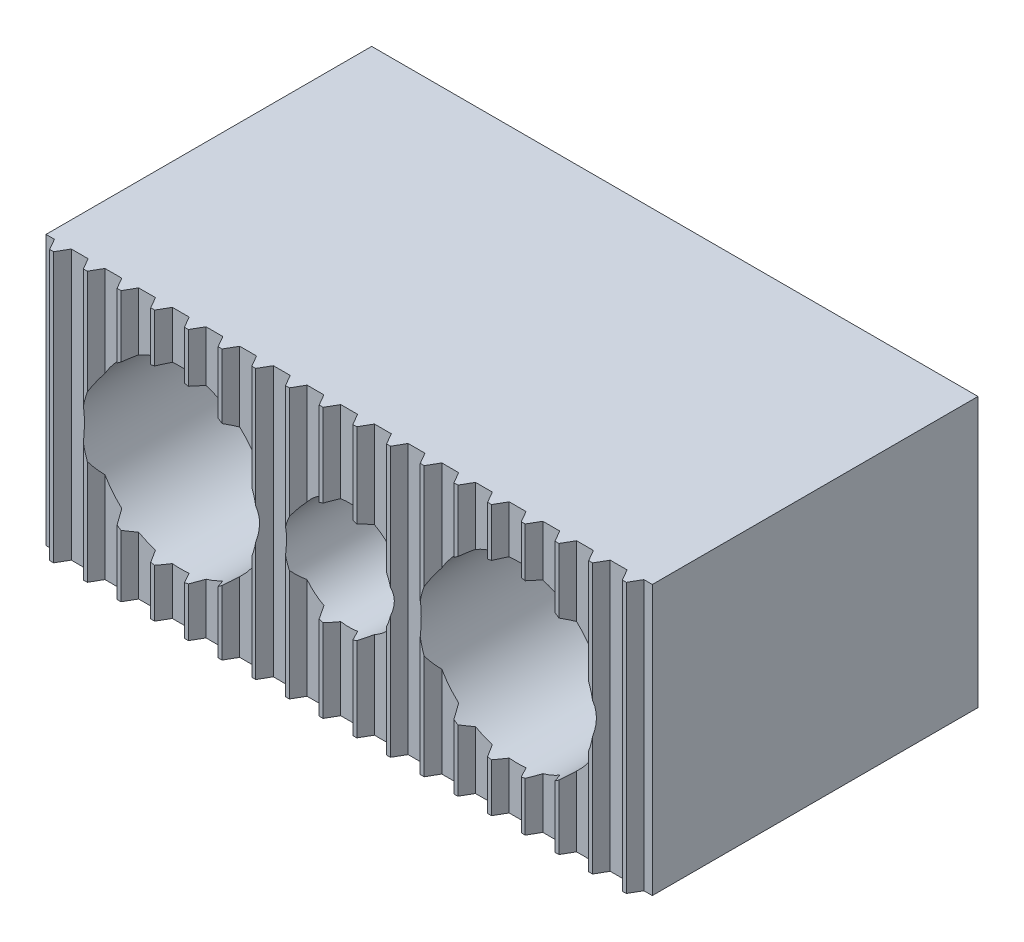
ISO-10303-21;
HEADER;
FILE_DESCRIPTION(('STEP AP214'),'2;1');
FILE_NAME('part.step','',(''),(''),'','','');
FILE_SCHEMA(('AUTOMOTIVE_DESIGN { 1 0 10303 214 1 1 1 1 }'));
ENDSEC;
DATA;
#1=APPLICATION_CONTEXT('core data for automotive mechanical design processes');
#2=APPLICATION_PROTOCOL_DEFINITION('international standard','automotive_design',2000,#1);
#3=PRODUCT_CONTEXT('',#1,'mechanical');
#4=PRODUCT('Part','Part','',(#3));
#5=PRODUCT_RELATED_PRODUCT_CATEGORY('part','',(#4));
#6=PRODUCT_DEFINITION_FORMATION('','',#4);
#7=PRODUCT_DEFINITION_CONTEXT('part definition',#1,'design');
#8=PRODUCT_DEFINITION('design','',#6,#7);
#9=PRODUCT_DEFINITION_SHAPE('','',#8);
#10=(LENGTH_UNIT() NAMED_UNIT(*) SI_UNIT(.MILLI.,.METRE.));
#11=(NAMED_UNIT(*) PLANE_ANGLE_UNIT() SI_UNIT($,.RADIAN.));
#12=(NAMED_UNIT(*) SI_UNIT($,.STERADIAN.) SOLID_ANGLE_UNIT());
#13=UNCERTAINTY_MEASURE_WITH_UNIT(LENGTH_MEASURE(1.E-05),#10,'distance_accuracy_value','');
#14=(GEOMETRIC_REPRESENTATION_CONTEXT(3) GLOBAL_UNCERTAINTY_ASSIGNED_CONTEXT((#13)) GLOBAL_UNIT_ASSIGNED_CONTEXT((#10,
#11,#12)) REPRESENTATION_CONTEXT('',''));
#15=CARTESIAN_POINT('',(0.,0.,0.));
#16=DIRECTION('',(0.,0.,1.));
#17=DIRECTION('',(1.,0.,0.));
#18=AXIS2_PLACEMENT_3D('',#15,#16,#17);
#19=CARTESIAN_POINT('',(-20.,20.,0.));
#20=DIRECTION('',(0.,0.,-1.));
#21=DIRECTION('',(-1.,0.,0.));
#22=AXIS2_PLACEMENT_3D('',#19,#20,#21);
#23=PLANE('',#22);
#24=CARTESIAN_POINT('',(50.,0.,0.));
#25=DIRECTION('',(0.,0.,-1.));
#26=DIRECTION('',(-1.,0.,0.));
#27=AXIS2_PLACEMENT_3D('',#24,#25,#26);
#28=CIRCLE('',#27,9.);
#29=CARTESIAN_POINT('',(41.,0.,0.));
#30=VERTEX_POINT('',#29);
#31=EDGE_CURVE('E853',#30,#30,#28,.T.);
#32=ORIENTED_EDGE('',*,*,#31,.F.);
#33=EDGE_LOOP('',(#32));
#34=FACE_BOUND('',#33,.T.);
#35=DIRECTION('',(0.,-1.,0.));
#36=VECTOR('',#35,1.);
#37=CARTESIAN_POINT('',(-20.,20.,0.));
#38=LINE('',#37,#36);
#39=CARTESIAN_POINT('',(-20.,20.,0.));
#40=VERTEX_POINT('',#39);
#41=CARTESIAN_POINT('',(-20.,-20.,0.));
#42=VERTEX_POINT('',#41);
#43=EDGE_CURVE('E876',#40,#42,#38,.T.);
#44=ORIENTED_EDGE('',*,*,#43,.F.);
#45=DIRECTION('',(1.,0.,0.));
#46=VECTOR('',#45,1.);
#47=CARTESIAN_POINT('',(-20.,20.,0.));
#48=LINE('',#47,#46);
#49=CARTESIAN_POINT('',(70.,20.,0.));
#50=VERTEX_POINT('',#49);
#51=EDGE_CURVE('E1414',#40,#50,#48,.T.);
#52=ORIENTED_EDGE('',*,*,#51,.T.);
#53=DIRECTION('',(0.,-1.,0.));
#54=VECTOR('',#53,1.);
#55=CARTESIAN_POINT('',(70.,20.,0.));
#56=LINE('',#55,#54);
#57=CARTESIAN_POINT('',(70.,-20.,0.));
#58=VERTEX_POINT('',#57);
#59=EDGE_CURVE('E878',#50,#58,#56,.T.);
#60=ORIENTED_EDGE('',*,*,#59,.T.);
#61=DIRECTION('',(1.,0.,0.));
#62=VECTOR('',#61,1.);
#63=CARTESIAN_POINT('',(-20.,-20.,0.));
#64=LINE('',#63,#62);
#65=EDGE_CURVE('E1190',#42,#58,#64,.T.);
#66=ORIENTED_EDGE('',*,*,#65,.F.);
#67=EDGE_LOOP('',(#44,#52,#60,#66));
#68=FACE_BOUND('',#67,.T.);
#69=CARTESIAN_POINT('',(0.,0.,0.));
#70=DIRECTION('',(0.,0.,-1.));
#71=DIRECTION('',(-1.,0.,0.));
#72=AXIS2_PLACEMENT_3D('',#69,#70,#71);
#73=CIRCLE('',#72,9.);
#74=CARTESIAN_POINT('',(-9.,0.,0.));
#75=VERTEX_POINT('',#74);
#76=EDGE_CURVE('E1683',#75,#75,#73,.T.);
#77=ORIENTED_EDGE('',*,*,#76,.F.);
#78=EDGE_LOOP('',(#77));
#79=FACE_BOUND('',#78,.T.);
#80=ADVANCED_FACE('F14',(#34,#68,#79),#23,.T.);
#81=CARTESIAN_POINT('',(-12.7915985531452,20.,50.));
#82=DIRECTION('',(-0.866025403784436,0.,0.500000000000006));
#83=DIRECTION('',(0.500000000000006,0.,0.866025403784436));
#84=AXIS2_PLACEMENT_3D('',#81,#82,#83);
#85=PLANE('',#84);
#86=DIRECTION('',(0.,-1.,0.));
#87=VECTOR('',#86,1.);
#88=CARTESIAN_POINT('',(-12.7915985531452,20.,50.));
#89=LINE('',#88,#87);
#90=CARTESIAN_POINT('',(-12.7915985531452,-2.318406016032,50.));
#91=VERTEX_POINT('',#90);
#92=CARTESIAN_POINT('',(-12.7915985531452,-20.,50.));
#93=VERTEX_POINT('',#92);
#94=EDGE_CURVE('E852',#91,#93,#89,.T.);
#95=ORIENTED_EDGE('',*,*,#94,.F.);
#96=CARTESIAN_POINT('',(0.,0.,72.1556986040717));
#97=DIRECTION('',(-0.866025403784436,0.,0.500000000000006));
#98=DIRECTION('',(-0.500000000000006,0.,-0.866025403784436));
#99=AXIS2_PLACEMENT_3D('',#96,#97,#98);
#100=ELLIPSE('',#99,26.,13.);
#101=CARTESIAN_POINT('',(-12.7915985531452,2.318406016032,50.));
#102=VERTEX_POINT('',#101);
#103=EDGE_CURVE('E834',#91,#102,#100,.F.);
#104=ORIENTED_EDGE('',*,*,#103,.T.);
#105=CARTESIAN_POINT('',(-12.7915985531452,20.,50.));
#106=VERTEX_POINT('',#105);
#107=EDGE_CURVE('E849',#106,#102,#89,.T.);
#108=ORIENTED_EDGE('',*,*,#107,.F.);
#109=DIRECTION('',(-0.5,0.,-0.866025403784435));
#110=VECTOR('',#109,1.);
#111=CARTESIAN_POINT('',(-12.7915985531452,20.,50.));
#112=LINE('',#111,#110);
#113=CARTESIAN_POINT('',(-13.75,20.,48.34));
#114=VERTEX_POINT('',#113);
#115=EDGE_CURVE('E1394',#106,#114,#112,.T.);
#116=ORIENTED_EDGE('',*,*,#115,.T.);
#117=DIRECTION('',(0.,-1.,0.));
#118=VECTOR('',#117,1.);
#119=CARTESIAN_POINT('',(-13.75,20.,48.34));
#120=LINE('',#119,#118);
#121=CARTESIAN_POINT('',(-13.75,-20.,48.34));
#122=VERTEX_POINT('',#121);
#123=EDGE_CURVE('E859',#114,#122,#120,.T.);
#124=ORIENTED_EDGE('',*,*,#123,.T.);
#125=DIRECTION('',(-0.5,0.,-0.866025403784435));
#126=VECTOR('',#125,1.);
#127=CARTESIAN_POINT('',(-12.7915985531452,-20.,50.));
#128=LINE('',#127,#126);
#129=EDGE_CURVE('E1169',#93,#122,#128,.T.);
#130=ORIENTED_EDGE('',*,*,#129,.F.);
#131=EDGE_LOOP('',(#95,#104,#108,#116,#124,#130));
#132=FACE_BOUND('',#131,.T.);
#133=ADVANCED_FACE('F847',(#132),#85,.T.);
#134=CARTESIAN_POINT('',(-12.7915985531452,20.,50.));
#135=DIRECTION('',(0.,0.,-1.));
#136=DIRECTION('',(-1.,0.,0.));
#137=AXIS2_PLACEMENT_3D('',#134,#135,#136);
#138=PLANE('',#137);
#139=CARTESIAN_POINT('',(0.,0.,50.));
#140=DIRECTION('',(0.,0.,-1.));
#141=DIRECTION('',(-1.,0.,0.));
#142=AXIS2_PLACEMENT_3D('',#139,#140,#141);
#143=CIRCLE('',#142,13.);
#144=CARTESIAN_POINT('',(-12.2084014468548,-4.46709459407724,50.));
#145=VERTEX_POINT('',#144);
#146=EDGE_CURVE('E844',#145,#91,#143,.T.);
#147=ORIENTED_EDGE('',*,*,#146,.T.);
#148=ORIENTED_EDGE('',*,*,#94,.T.);
#149=DIRECTION('',(1.,0.,0.));
#150=VECTOR('',#149,1.);
#151=CARTESIAN_POINT('',(-12.7915985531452,-20.,50.));
#152=LINE('',#151,#150);
#153=CARTESIAN_POINT('',(-12.2084014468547,-20.,50.));
#154=VERTEX_POINT('',#153);
#155=EDGE_CURVE('E1156',#93,#154,#152,.T.);
#156=ORIENTED_EDGE('',*,*,#155,.T.);
#157=DIRECTION('',(0.,-1.,0.));
#158=VECTOR('',#157,1.);
#159=CARTESIAN_POINT('',(-12.2084014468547,20.,50.));
#160=LINE('',#159,#158);
#161=EDGE_CURVE('E1132',#145,#154,#160,.T.);
#162=ORIENTED_EDGE('',*,*,#161,.F.);
#163=EDGE_LOOP('',(#147,#148,#156,#162));
#164=FACE_BOUND('',#163,.T.);
#165=ADVANCED_FACE('F1696',(#164),#138,.F.);
#166=CARTESIAN_POINT('',(-12.2084014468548,4.46709459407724,50.));
#167=VERTEX_POINT('',#166);
#168=EDGE_CURVE('E831',#102,#167,#143,.T.);
#169=ORIENTED_EDGE('',*,*,#168,.T.);
#170=CARTESIAN_POINT('',(-12.2084014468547,20.,50.));
#171=VERTEX_POINT('',#170);
#172=EDGE_CURVE('E863',#171,#167,#160,.T.);
#173=ORIENTED_EDGE('',*,*,#172,.F.);
#174=DIRECTION('',(1.,0.,0.));
#175=VECTOR('',#174,1.);
#176=CARTESIAN_POINT('',(-12.7915985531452,20.,50.));
#177=LINE('',#176,#175);
#178=EDGE_CURVE('E858',#106,#171,#177,.T.);
#179=ORIENTED_EDGE('',*,*,#178,.F.);
#180=ORIENTED_EDGE('',*,*,#107,.T.);
#181=EDGE_LOOP('',(#169,#173,#179,#180));
#182=FACE_BOUND('',#181,.T.);
#183=ADVANCED_FACE('F856',(#182),#138,.F.);
#184=CARTESIAN_POINT('',(-12.2084014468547,20.,50.));
#185=DIRECTION('',(-0.86602540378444,0.,-0.5));
#186=DIRECTION('',(-0.5,0.,0.86602540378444));
#187=AXIS2_PLACEMENT_3D('',#184,#185,#186);
#188=PLANE('',#187);
#189=CARTESIAN_POINT('',(0.,0.,28.85442841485));
#190=DIRECTION('',(-0.86602540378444,0.,-0.5));
#191=DIRECTION('',(0.5,0.,-0.86602540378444));
#192=AXIS2_PLACEMENT_3D('',#189,#190,#191);
#193=ELLIPSE('',#192,26.,13.);
#194=CARTESIAN_POINT('',(-11.25,6.51440711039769,48.34));
#195=VERTEX_POINT('',#194);
#196=EDGE_CURVE('E837',#195,#167,#193,.F.);
#197=ORIENTED_EDGE('',*,*,#196,.F.);
#198=DIRECTION('',(0.,-1.,0.));
#199=VECTOR('',#198,1.);
#200=CARTESIAN_POINT('',(-11.25,20.,48.34));
#201=LINE('',#200,#199);
#202=CARTESIAN_POINT('',(-11.25,20.,48.34));
#203=VERTEX_POINT('',#202);
#204=EDGE_CURVE('E1130',#203,#195,#201,.T.);
#205=ORIENTED_EDGE('',*,*,#204,.F.);
#206=DIRECTION('',(0.5,0.,-0.86602540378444));
#207=VECTOR('',#206,1.);
#208=CARTESIAN_POINT('',(-12.2084014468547,20.,50.));
#209=LINE('',#208,#207);
#210=EDGE_CURVE('E1390',#171,#203,#209,.T.);
#211=ORIENTED_EDGE('',*,*,#210,.F.);
#212=ORIENTED_EDGE('',*,*,#172,.T.);
#213=EDGE_LOOP('',(#197,#205,#211,#212));
#214=FACE_BOUND('',#213,.T.);
#215=ADVANCED_FACE('F2118',(#214),#188,.F.);
#216=CARTESIAN_POINT('',(-11.25,-6.51440711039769,48.34));
#217=VERTEX_POINT('',#216);
#218=EDGE_CURVE('E2110',#145,#217,#193,.F.);
#219=ORIENTED_EDGE('',*,*,#218,.F.);
#220=ORIENTED_EDGE('',*,*,#161,.T.);
#221=DIRECTION('',(0.5,0.,-0.86602540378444));
#222=VECTOR('',#221,1.);
#223=CARTESIAN_POINT('',(-12.2084014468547,-20.,50.));
#224=LINE('',#223,#222);
#225=CARTESIAN_POINT('',(-11.25,-20.,48.34));
#226=VERTEX_POINT('',#225);
#227=EDGE_CURVE('E1150',#154,#226,#224,.T.);
#228=ORIENTED_EDGE('',*,*,#227,.T.);
#229=EDGE_CURVE('E1129',#217,#226,#201,.T.);
#230=ORIENTED_EDGE('',*,*,#229,.F.);
#231=EDGE_LOOP('',(#219,#220,#228,#230));
#232=FACE_BOUND('',#231,.T.);
#233=ADVANCED_FACE('F1151',(#232),#188,.F.);
#234=CARTESIAN_POINT('',(-11.25,20.,48.34));
#235=DIRECTION('',(0.,0.,-1.));
#236=DIRECTION('',(-1.,0.,0.));
#237=AXIS2_PLACEMENT_3D('',#234,#235,#236);
#238=PLANE('',#237);
#239=CARTESIAN_POINT('',(0.,0.,48.34));
#240=DIRECTION('',(0.,0.,-1.));
#241=DIRECTION('',(-1.,0.,0.));
#242=AXIS2_PLACEMENT_3D('',#239,#240,#241);
#243=CIRCLE('',#242,13.);
#244=CARTESIAN_POINT('',(-8.75,-9.61444226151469,48.34));
#245=VERTEX_POINT('',#244);
#246=EDGE_CURVE('E1146',#217,#245,#243,.F.);
#247=ORIENTED_EDGE('',*,*,#246,.F.);
#248=ORIENTED_EDGE('',*,*,#229,.T.);
#249=DIRECTION('',(1.,0.,0.));
#250=VECTOR('',#249,1.);
#251=CARTESIAN_POINT('',(-11.25,-20.,48.34));
#252=LINE('',#251,#250);
#253=CARTESIAN_POINT('',(-8.75,-20.,48.34));
#254=VERTEX_POINT('',#253);
#255=EDGE_CURVE('E1144',#226,#254,#252,.T.);
#256=ORIENTED_EDGE('',*,*,#255,.T.);
#257=DIRECTION('',(0.,-1.,0.));
#258=VECTOR('',#257,1.);
#259=CARTESIAN_POINT('',(-8.75,20.,48.34));
#260=LINE('',#259,#258);
#261=EDGE_CURVE('E1126',#245,#254,#260,.T.);
#262=ORIENTED_EDGE('',*,*,#261,.F.);
#263=EDGE_LOOP('',(#247,#248,#256,#262));
#264=FACE_BOUND('',#263,.T.);
#265=ADVANCED_FACE('F1141',(#264),#238,.F.);
#266=CARTESIAN_POINT('',(-8.75,9.61444226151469,48.34));
#267=VERTEX_POINT('',#266);
#268=EDGE_CURVE('E2112',#267,#195,#243,.F.);
#269=ORIENTED_EDGE('',*,*,#268,.F.);
#270=CARTESIAN_POINT('',(-8.75,20.,48.34));
#271=VERTEX_POINT('',#270);
#272=EDGE_CURVE('E1127',#271,#267,#260,.T.);
#273=ORIENTED_EDGE('',*,*,#272,.F.);
#274=DIRECTION('',(1.,0.,0.));
#275=VECTOR('',#274,1.);
#276=CARTESIAN_POINT('',(-11.25,20.,48.34));
#277=LINE('',#276,#275);
#278=EDGE_CURVE('E1387',#203,#271,#277,.T.);
#279=ORIENTED_EDGE('',*,*,#278,.F.);
#280=ORIENTED_EDGE('',*,*,#204,.T.);
#281=EDGE_LOOP('',(#269,#273,#279,#280));
#282=FACE_BOUND('',#281,.T.);
#283=ADVANCED_FACE('F2115',(#282),#238,.F.);
#284=CARTESIAN_POINT('',(-7.79159855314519,20.,50.));
#285=DIRECTION('',(-0.866025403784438,0.,0.5));
#286=DIRECTION('',(0.5,0.,0.866025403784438));
#287=AXIS2_PLACEMENT_3D('',#284,#285,#286);
#288=PLANE('',#287);
#289=ORIENTED_EDGE('',*,*,#272,.T.);
#290=CARTESIAN_POINT('',(0.,0.,63.4954445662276));
#291=DIRECTION('',(-0.866025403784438,0.,0.5));
#292=DIRECTION('',(-0.5,0.,-0.866025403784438));
#293=AXIS2_PLACEMENT_3D('',#290,#291,#292);
#294=ELLIPSE('',#293,26.,13.);
#295=CARTESIAN_POINT('',(-7.79159855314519,10.4062957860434,50.));
#296=VERTEX_POINT('',#295);
#297=EDGE_CURVE('E1644',#267,#296,#294,.F.);
#298=ORIENTED_EDGE('',*,*,#297,.T.);
#299=DIRECTION('',(0.,-1.,0.));
#300=VECTOR('',#299,1.);
#301=CARTESIAN_POINT('',(-7.79159855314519,20.,50.));
#302=LINE('',#301,#300);
#303=CARTESIAN_POINT('',(-7.79159855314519,20.,50.));
#304=VERTEX_POINT('',#303);
#305=EDGE_CURVE('E1123',#304,#296,#302,.T.);
#306=ORIENTED_EDGE('',*,*,#305,.F.);
#307=DIRECTION('',(-0.5,0.,-0.866025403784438));
#308=VECTOR('',#307,1.);
#309=CARTESIAN_POINT('',(-7.79159855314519,20.,50.));
#310=LINE('',#309,#308);
#311=EDGE_CURVE('E1384',#304,#271,#310,.T.);
#312=ORIENTED_EDGE('',*,*,#311,.T.);
#313=EDGE_LOOP('',(#289,#298,#306,#312));
#314=FACE_BOUND('',#313,.T.);
#315=ADVANCED_FACE('F2114',(#314),#288,.T.);
#316=CARTESIAN_POINT('',(-7.79159855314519,-10.4062957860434,50.));
#317=VERTEX_POINT('',#316);
#318=CARTESIAN_POINT('',(-7.79159855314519,-20.,50.));
#319=VERTEX_POINT('',#318);
#320=EDGE_CURVE('E1122',#317,#319,#302,.T.);
#321=ORIENTED_EDGE('',*,*,#320,.F.);
#322=EDGE_CURVE('E1640',#317,#245,#294,.F.);
#323=ORIENTED_EDGE('',*,*,#322,.T.);
#324=ORIENTED_EDGE('',*,*,#261,.T.);
#325=DIRECTION('',(-0.5,0.,-0.866025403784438));
#326=VECTOR('',#325,1.);
#327=CARTESIAN_POINT('',(-7.79159855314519,-20.,50.));
#328=LINE('',#327,#326);
#329=EDGE_CURVE('E1162',#319,#254,#328,.T.);
#330=ORIENTED_EDGE('',*,*,#329,.F.);
#331=EDGE_LOOP('',(#321,#323,#324,#330));
#332=FACE_BOUND('',#331,.T.);
#333=ADVANCED_FACE('F2351',(#332),#288,.T.);
#334=CARTESIAN_POINT('',(-7.79159855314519,20.,50.));
#335=DIRECTION('',(0.,0.,-1.));
#336=DIRECTION('',(-1.,0.,0.));
#337=AXIS2_PLACEMENT_3D('',#334,#335,#336);
#338=PLANE('',#337);
#339=CARTESIAN_POINT('',(-7.20840144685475,-10.8184540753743,50.));
#340=VERTEX_POINT('',#339);
#341=EDGE_CURVE('E1732',#340,#317,#143,.T.);
#342=ORIENTED_EDGE('',*,*,#341,.T.);
#343=ORIENTED_EDGE('',*,*,#320,.T.);
#344=DIRECTION('',(1.,0.,0.));
#345=VECTOR('',#344,1.);
#346=CARTESIAN_POINT('',(-7.79159855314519,-20.,50.));
#347=LINE('',#346,#345);
#348=CARTESIAN_POINT('',(-7.20840144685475,-20.,50.));
#349=VERTEX_POINT('',#348);
#350=EDGE_CURVE('E1164',#319,#349,#347,.T.);
#351=ORIENTED_EDGE('',*,*,#350,.T.);
#352=DIRECTION('',(0.,-1.,0.));
#353=VECTOR('',#352,1.);
#354=CARTESIAN_POINT('',(-7.20840144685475,20.,50.));
#355=LINE('',#354,#353);
#356=EDGE_CURVE('E1118',#340,#349,#355,.T.);
#357=ORIENTED_EDGE('',*,*,#356,.F.);
#358=EDGE_LOOP('',(#342,#343,#351,#357));
#359=FACE_BOUND('',#358,.T.);
#360=ADVANCED_FACE('F1621',(#359),#338,.F.);
#361=CARTESIAN_POINT('',(-7.20840144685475,10.8184540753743,50.));
#362=VERTEX_POINT('',#361);
#363=EDGE_CURVE('E842',#296,#362,#143,.T.);
#364=ORIENTED_EDGE('',*,*,#363,.T.);
#365=CARTESIAN_POINT('',(-7.20840144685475,20.,50.));
#366=VERTEX_POINT('',#365);
#367=EDGE_CURVE('E1119',#366,#362,#355,.T.);
#368=ORIENTED_EDGE('',*,*,#367,.F.);
#369=DIRECTION('',(1.,0.,0.));
#370=VECTOR('',#369,1.);
#371=CARTESIAN_POINT('',(-7.79159855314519,20.,50.));
#372=LINE('',#371,#370);
#373=EDGE_CURVE('E1381',#304,#366,#372,.T.);
#374=ORIENTED_EDGE('',*,*,#373,.F.);
#375=ORIENTED_EDGE('',*,*,#305,.T.);
#376=EDGE_LOOP('',(#364,#368,#374,#375));
#377=FACE_BOUND('',#376,.T.);
#378=ADVANCED_FACE('F1764',(#377),#338,.F.);
#379=CARTESIAN_POINT('',(-7.20840144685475,20.,50.));
#380=DIRECTION('',(-0.866025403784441,0.,-0.5));
#381=DIRECTION('',(-0.5,0.,0.866025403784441));
#382=AXIS2_PLACEMENT_3D('',#379,#380,#381);
#383=PLANE('',#382);
#384=CARTESIAN_POINT('',(0.,0.,37.5146824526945));
#385=DIRECTION('',(-0.866025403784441,0.,-0.5));
#386=DIRECTION('',(0.5,0.,-0.866025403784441));
#387=AXIS2_PLACEMENT_3D('',#384,#385,#386);
#388=ELLIPSE('',#387,26.,13.);
#389=CARTESIAN_POINT('',(-6.25,11.399013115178,48.34));
#390=VERTEX_POINT('',#389);
#391=EDGE_CURVE('E1633',#390,#362,#388,.F.);
#392=ORIENTED_EDGE('',*,*,#391,.F.);
#393=DIRECTION('',(0.,-1.,0.));
#394=VECTOR('',#393,1.);
#395=CARTESIAN_POINT('',(-6.25,20.,48.34));
#396=LINE('',#395,#394);
#397=CARTESIAN_POINT('',(-6.25,20.,48.34));
#398=VERTEX_POINT('',#397);
#399=EDGE_CURVE('E1115',#398,#390,#396,.T.);
#400=ORIENTED_EDGE('',*,*,#399,.F.);
#401=DIRECTION('',(0.5,0.,-0.866025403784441));
#402=VECTOR('',#401,1.);
#403=CARTESIAN_POINT('',(-7.20840144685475,20.,50.));
#404=LINE('',#403,#402);
#405=EDGE_CURVE('E1378',#366,#398,#404,.T.);
#406=ORIENTED_EDGE('',*,*,#405,.F.);
#407=ORIENTED_EDGE('',*,*,#367,.T.);
#408=EDGE_LOOP('',(#392,#400,#406,#407));
#409=FACE_BOUND('',#408,.T.);
#410=ADVANCED_FACE('F1769',(#409),#383,.F.);
#411=CARTESIAN_POINT('',(-6.25,-11.399013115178,48.34));
#412=VERTEX_POINT('',#411);
#413=EDGE_CURVE('E1628',#340,#412,#388,.F.);
#414=ORIENTED_EDGE('',*,*,#413,.F.);
#415=ORIENTED_EDGE('',*,*,#356,.T.);
#416=DIRECTION('',(0.5,0.,-0.866025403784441));
#417=VECTOR('',#416,1.);
#418=CARTESIAN_POINT('',(-7.20840144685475,-20.,50.));
#419=LINE('',#418,#417);
#420=CARTESIAN_POINT('',(-6.25,-20.,48.34));
#421=VERTEX_POINT('',#420);
#422=EDGE_CURVE('E1614',#349,#421,#419,.T.);
#423=ORIENTED_EDGE('',*,*,#422,.T.);
#424=EDGE_CURVE('E1114',#412,#421,#396,.T.);
#425=ORIENTED_EDGE('',*,*,#424,.F.);
#426=EDGE_LOOP('',(#414,#415,#423,#425));
#427=FACE_BOUND('',#426,.T.);
#428=ADVANCED_FACE('F1627',(#427),#383,.F.);
#429=CARTESIAN_POINT('',(-6.25,20.,48.34));
#430=DIRECTION('',(0.,0.,-1.));
#431=DIRECTION('',(-1.,0.,0.));
#432=AXIS2_PLACEMENT_3D('',#429,#430,#431);
#433=PLANE('',#432);
#434=CARTESIAN_POINT('',(0.,0.,48.34));
#435=DIRECTION('',(0.,0.,-1.));
#436=DIRECTION('',(-1.,0.,0.));
#437=AXIS2_PLACEMENT_3D('',#434,#435,#436);
#438=CIRCLE('',#437,13.);
#439=CARTESIAN_POINT('',(-3.75,-12.4473892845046,48.34));
#440=VERTEX_POINT('',#439);
#441=EDGE_CURVE('E1631',#412,#440,#438,.F.);
#442=ORIENTED_EDGE('',*,*,#441,.F.);
#443=ORIENTED_EDGE('',*,*,#424,.T.);
#444=DIRECTION('',(1.,0.,0.));
#445=VECTOR('',#444,1.);
#446=CARTESIAN_POINT('',(-6.25,-20.,48.34));
#447=LINE('',#446,#445);
#448=CARTESIAN_POINT('',(-3.75,-20.,48.34));
#449=VERTEX_POINT('',#448);
#450=EDGE_CURVE('E1611',#421,#449,#447,.T.);
#451=ORIENTED_EDGE('',*,*,#450,.T.);
#452=DIRECTION('',(0.,-1.,0.));
#453=VECTOR('',#452,1.);
#454=CARTESIAN_POINT('',(-3.75,20.,48.34));
#455=LINE('',#454,#453);
#456=EDGE_CURVE('E1110',#440,#449,#455,.T.);
#457=ORIENTED_EDGE('',*,*,#456,.F.);
#458=EDGE_LOOP('',(#442,#443,#451,#457));
#459=FACE_BOUND('',#458,.T.);
#460=ADVANCED_FACE('F2344',(#459),#433,.F.);
#461=CARTESIAN_POINT('',(-3.75,12.4473892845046,48.34));
#462=VERTEX_POINT('',#461);
#463=EDGE_CURVE('E1635',#462,#390,#438,.F.);
#464=ORIENTED_EDGE('',*,*,#463,.F.);
#465=CARTESIAN_POINT('',(-3.75,20.,48.34));
#466=VERTEX_POINT('',#465);
#467=EDGE_CURVE('E1111',#466,#462,#455,.T.);
#468=ORIENTED_EDGE('',*,*,#467,.F.);
#469=DIRECTION('',(1.,0.,0.));
#470=VECTOR('',#469,1.);
#471=CARTESIAN_POINT('',(-6.25,20.,48.34));
#472=LINE('',#471,#470);
#473=EDGE_CURVE('E1375',#398,#466,#472,.T.);
#474=ORIENTED_EDGE('',*,*,#473,.F.);
#475=ORIENTED_EDGE('',*,*,#399,.T.);
#476=EDGE_LOOP('',(#464,#468,#474,#475));
#477=FACE_BOUND('',#476,.T.);
#478=ADVANCED_FACE('F1774',(#477),#433,.F.);
#479=CARTESIAN_POINT('',(-2.7915985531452,20.,50.));
#480=DIRECTION('',(-0.866025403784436,0.,0.5));
#481=DIRECTION('',(0.5,0.,0.866025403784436));
#482=AXIS2_PLACEMENT_3D('',#479,#480,#481);
#483=PLANE('',#482);
#484=ORIENTED_EDGE('',*,*,#467,.T.);
#485=CARTESIAN_POINT('',(0.,0.,54.8351905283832));
#486=DIRECTION('',(-0.866025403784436,0.,0.5));
#487=DIRECTION('',(-0.5,0.,-0.866025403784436));
#488=AXIS2_PLACEMENT_3D('',#485,#486,#487);
#489=ELLIPSE('',#488,26.,13.);
#490=CARTESIAN_POINT('',(-2.7915985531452,12.6967309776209,50.));
#491=VERTEX_POINT('',#490);
#492=EDGE_CURVE('E1630',#462,#491,#489,.F.);
#493=ORIENTED_EDGE('',*,*,#492,.T.);
#494=DIRECTION('',(0.,-1.,0.));
#495=VECTOR('',#494,1.);
#496=CARTESIAN_POINT('',(-2.7915985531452,20.,50.));
#497=LINE('',#496,#495);
#498=CARTESIAN_POINT('',(-2.7915985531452,20.,50.));
#499=VERTEX_POINT('',#498);
#500=EDGE_CURVE('E1107',#499,#491,#497,.T.);
#501=ORIENTED_EDGE('',*,*,#500,.F.);
#502=DIRECTION('',(-0.5,0.,-0.866025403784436));
#503=VECTOR('',#502,1.);
#504=CARTESIAN_POINT('',(-2.7915985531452,20.,50.));
#505=LINE('',#504,#503);
#506=EDGE_CURVE('E1372',#499,#466,#505,.T.);
#507=ORIENTED_EDGE('',*,*,#506,.T.);
#508=EDGE_LOOP('',(#484,#493,#501,#507));
#509=FACE_BOUND('',#508,.T.);
#510=ADVANCED_FACE('F1776',(#509),#483,.T.);
#511=CARTESIAN_POINT('',(-2.7915985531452,-12.6967309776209,50.));
#512=VERTEX_POINT('',#511);
#513=CARTESIAN_POINT('',(-2.7915985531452,-20.,50.));
#514=VERTEX_POINT('',#513);
#515=EDGE_CURVE('E1106',#512,#514,#497,.T.);
#516=ORIENTED_EDGE('',*,*,#515,.F.);
#517=EDGE_CURVE('E1637',#512,#440,#489,.F.);
#518=ORIENTED_EDGE('',*,*,#517,.T.);
#519=ORIENTED_EDGE('',*,*,#456,.T.);
#520=DIRECTION('',(-0.5,0.,-0.866025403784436));
#521=VECTOR('',#520,1.);
#522=CARTESIAN_POINT('',(-2.7915985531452,-20.,50.));
#523=LINE('',#522,#521);
#524=EDGE_CURVE('E1608',#514,#449,#523,.T.);
#525=ORIENTED_EDGE('',*,*,#524,.F.);
#526=EDGE_LOOP('',(#516,#518,#519,#525));
#527=FACE_BOUND('',#526,.T.);
#528=ADVANCED_FACE('F2341',(#527),#483,.T.);
#529=CARTESIAN_POINT('',(-2.7915985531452,20.,50.));
#530=DIRECTION('',(0.,0.,-1.));
#531=DIRECTION('',(-1.,0.,0.));
#532=AXIS2_PLACEMENT_3D('',#529,#530,#531);
#533=PLANE('',#532);
#534=CARTESIAN_POINT('',(-2.2084014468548,-12.8110484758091,50.));
#535=VERTEX_POINT('',#534);
#536=EDGE_CURVE('E1733',#535,#512,#143,.T.);
#537=ORIENTED_EDGE('',*,*,#536,.T.);
#538=ORIENTED_EDGE('',*,*,#515,.T.);
#539=DIRECTION('',(1.,0.,0.));
#540=VECTOR('',#539,1.);
#541=CARTESIAN_POINT('',(-2.7915985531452,-20.,50.));
#542=LINE('',#541,#540);
#543=CARTESIAN_POINT('',(-2.2084014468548,-20.,50.));
#544=VERTEX_POINT('',#543);
#545=EDGE_CURVE('E1605',#514,#544,#542,.T.);
#546=ORIENTED_EDGE('',*,*,#545,.T.);
#547=DIRECTION('',(0.,-1.,0.));
#548=VECTOR('',#547,1.);
#549=CARTESIAN_POINT('',(-2.2084014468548,20.,50.));
#550=LINE('',#549,#548);
#551=EDGE_CURVE('E1102',#535,#544,#550,.T.);
#552=ORIENTED_EDGE('',*,*,#551,.F.);
#553=EDGE_LOOP('',(#537,#538,#546,#552));
#554=FACE_BOUND('',#553,.T.);
#555=ADVANCED_FACE('F2338',(#554),#533,.F.);
#556=CARTESIAN_POINT('',(-2.2084014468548,12.8110484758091,50.));
#557=VERTEX_POINT('',#556);
#558=EDGE_CURVE('E1759',#491,#557,#143,.T.);
#559=ORIENTED_EDGE('',*,*,#558,.T.);
#560=CARTESIAN_POINT('',(-2.2084014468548,20.,50.));
#561=VERTEX_POINT('',#560);
#562=EDGE_CURVE('E1103',#561,#557,#550,.T.);
#563=ORIENTED_EDGE('',*,*,#562,.F.);
#564=DIRECTION('',(1.,0.,0.));
#565=VECTOR('',#564,1.);
#566=CARTESIAN_POINT('',(-2.7915985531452,20.,50.));
#567=LINE('',#566,#565);
#568=EDGE_CURVE('E1369',#499,#561,#567,.T.);
#569=ORIENTED_EDGE('',*,*,#568,.F.);
#570=ORIENTED_EDGE('',*,*,#500,.T.);
#571=EDGE_LOOP('',(#559,#563,#569,#570));
#572=FACE_BOUND('',#571,.T.);
#573=ADVANCED_FACE('F1779',(#572),#533,.F.);
#574=CARTESIAN_POINT('',(-2.2084014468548,20.,50.));
#575=DIRECTION('',(-0.86602540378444,0.,-0.5));
#576=DIRECTION('',(-0.5,0.,0.86602540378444));
#577=AXIS2_PLACEMENT_3D('',#574,#575,#576);
#578=PLANE('',#577);
#579=CARTESIAN_POINT('',(0.,0.,46.1749364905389));
#580=DIRECTION('',(-0.86602540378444,0.,-0.5));
#581=DIRECTION('',(0.5,0.,-0.86602540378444));
#582=AXIS2_PLACEMENT_3D('',#579,#580,#581);
#583=ELLIPSE('',#582,26.,13.);
#584=CARTESIAN_POINT('',(-1.25,12.9397642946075,48.34));
#585=VERTEX_POINT('',#584);
#586=EDGE_CURVE('E1648',#585,#557,#583,.F.);
#587=ORIENTED_EDGE('',*,*,#586,.F.);
#588=DIRECTION('',(0.,-1.,0.));
#589=VECTOR('',#588,1.);
#590=CARTESIAN_POINT('',(-1.25,20.,48.34));
#591=LINE('',#590,#589);
#592=CARTESIAN_POINT('',(-1.25,20.,48.34));
#593=VERTEX_POINT('',#592);
#594=EDGE_CURVE('E1099',#593,#585,#591,.T.);
#595=ORIENTED_EDGE('',*,*,#594,.F.);
#596=DIRECTION('',(0.5,0.,-0.86602540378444));
#597=VECTOR('',#596,1.);
#598=CARTESIAN_POINT('',(-2.2084014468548,20.,50.));
#599=LINE('',#598,#597);
#600=EDGE_CURVE('E1366',#561,#593,#599,.T.);
#601=ORIENTED_EDGE('',*,*,#600,.F.);
#602=ORIENTED_EDGE('',*,*,#562,.T.);
#603=EDGE_LOOP('',(#587,#595,#601,#602));
#604=FACE_BOUND('',#603,.T.);
#605=ADVANCED_FACE('F1782',(#604),#578,.F.);
#606=CARTESIAN_POINT('',(-1.25,-12.9397642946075,48.34));
#607=VERTEX_POINT('',#606);
#608=EDGE_CURVE('E1649',#535,#607,#583,.F.);
#609=ORIENTED_EDGE('',*,*,#608,.F.);
#610=ORIENTED_EDGE('',*,*,#551,.T.);
#611=DIRECTION('',(0.5,0.,-0.86602540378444));
#612=VECTOR('',#611,1.);
#613=CARTESIAN_POINT('',(-2.2084014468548,-20.,50.));
#614=LINE('',#613,#612);
#615=CARTESIAN_POINT('',(-1.25,-20.,48.34));
#616=VERTEX_POINT('',#615);
#617=EDGE_CURVE('E1602',#544,#616,#614,.T.);
#618=ORIENTED_EDGE('',*,*,#617,.T.);
#619=EDGE_CURVE('E1098',#607,#616,#591,.T.);
#620=ORIENTED_EDGE('',*,*,#619,.F.);
#621=EDGE_LOOP('',(#609,#610,#618,#620));
#622=FACE_BOUND('',#621,.T.);
#623=ADVANCED_FACE('F2334',(#622),#578,.F.);
#624=CARTESIAN_POINT('',(-1.25,20.,48.34));
#625=DIRECTION('',(0.,0.,-1.));
#626=DIRECTION('',(-1.,0.,0.));
#627=AXIS2_PLACEMENT_3D('',#624,#625,#626);
#628=PLANE('',#627);
#629=CARTESIAN_POINT('',(0.,0.,48.34));
#630=DIRECTION('',(0.,0.,-1.));
#631=DIRECTION('',(-1.,0.,0.));
#632=AXIS2_PLACEMENT_3D('',#629,#630,#631);
#633=CIRCLE('',#632,13.);
#634=CARTESIAN_POINT('',(1.25,-12.9397642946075,48.34));
#635=VERTEX_POINT('',#634);
#636=EDGE_CURVE('E1652',#607,#635,#633,.F.);
#637=ORIENTED_EDGE('',*,*,#636,.F.);
#638=ORIENTED_EDGE('',*,*,#619,.T.);
#639=DIRECTION('',(1.,0.,0.));
#640=VECTOR('',#639,1.);
#641=CARTESIAN_POINT('',(-1.25,-20.,48.34));
#642=LINE('',#641,#640);
#643=CARTESIAN_POINT('',(1.25,-20.,48.34));
#644=VERTEX_POINT('',#643);
#645=EDGE_CURVE('E1599',#616,#644,#642,.T.);
#646=ORIENTED_EDGE('',*,*,#645,.T.);
#647=DIRECTION('',(0.,-1.,0.));
#648=VECTOR('',#647,1.);
#649=CARTESIAN_POINT('',(1.25,20.,48.34));
#650=LINE('',#649,#648);
#651=EDGE_CURVE('E1094',#635,#644,#650,.T.);
#652=ORIENTED_EDGE('',*,*,#651,.F.);
#653=EDGE_LOOP('',(#637,#638,#646,#652));
#654=FACE_BOUND('',#653,.T.);
#655=ADVANCED_FACE('F2331',(#654),#628,.F.);
#656=CARTESIAN_POINT('',(1.25,12.9397642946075,48.34));
#657=VERTEX_POINT('',#656);
#658=EDGE_CURVE('E1655',#657,#585,#633,.F.);
#659=ORIENTED_EDGE('',*,*,#658,.F.);
#660=CARTESIAN_POINT('',(1.25,20.,48.34));
#661=VERTEX_POINT('',#660);
#662=EDGE_CURVE('E1095',#661,#657,#650,.T.);
#663=ORIENTED_EDGE('',*,*,#662,.F.);
#664=DIRECTION('',(1.,0.,0.));
#665=VECTOR('',#664,1.);
#666=CARTESIAN_POINT('',(-1.25,20.,48.34));
#667=LINE('',#666,#665);
#668=EDGE_CURVE('E1363',#593,#661,#667,.T.);
#669=ORIENTED_EDGE('',*,*,#668,.F.);
#670=ORIENTED_EDGE('',*,*,#594,.T.);
#671=EDGE_LOOP('',(#659,#663,#669,#670));
#672=FACE_BOUND('',#671,.T.);
#673=ADVANCED_FACE('F1787',(#672),#628,.F.);
#674=CARTESIAN_POINT('',(2.2084014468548,20.,50.));
#675=DIRECTION('',(-0.866025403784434,0.,0.500000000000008));
#676=DIRECTION('',(0.500000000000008,0.,0.866025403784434));
#677=AXIS2_PLACEMENT_3D('',#674,#675,#676);
#678=PLANE('',#677);
#679=ORIENTED_EDGE('',*,*,#662,.T.);
#680=CARTESIAN_POINT('',(0.,0.,46.1749364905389));
#681=DIRECTION('',(-0.866025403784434,0.,0.500000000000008));
#682=DIRECTION('',(-0.500000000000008,0.,-0.866025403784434));
#683=AXIS2_PLACEMENT_3D('',#680,#681,#682);
#684=ELLIPSE('',#683,25.9999999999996,13.);
#685=CARTESIAN_POINT('',(2.2084014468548,12.811048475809,50.));
#686=VERTEX_POINT('',#685);
#687=EDGE_CURVE('E1651',#657,#686,#684,.F.);
#688=ORIENTED_EDGE('',*,*,#687,.T.);
#689=DIRECTION('',(0.,-1.,0.));
#690=VECTOR('',#689,1.);
#691=CARTESIAN_POINT('',(2.2084014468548,20.,50.));
#692=LINE('',#691,#690);
#693=CARTESIAN_POINT('',(2.2084014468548,20.,50.));
#694=VERTEX_POINT('',#693);
#695=EDGE_CURVE('E1091',#694,#686,#692,.T.);
#696=ORIENTED_EDGE('',*,*,#695,.F.);
#697=DIRECTION('',(-0.500000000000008,0.,-0.866025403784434));
#698=VECTOR('',#697,1.);
#699=CARTESIAN_POINT('',(2.2084014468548,20.,50.));
#700=LINE('',#699,#698);
#701=EDGE_CURVE('E1360',#694,#661,#700,.T.);
#702=ORIENTED_EDGE('',*,*,#701,.T.);
#703=EDGE_LOOP('',(#679,#688,#696,#702));
#704=FACE_BOUND('',#703,.T.);
#705=ADVANCED_FACE('F1790',(#704),#678,.T.);
#706=CARTESIAN_POINT('',(2.2084014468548,-12.811048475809,50.));
#707=VERTEX_POINT('',#706);
#708=CARTESIAN_POINT('',(2.2084014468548,-20.,50.));
#709=VERTEX_POINT('',#708);
#710=EDGE_CURVE('E1090',#707,#709,#692,.T.);
#711=ORIENTED_EDGE('',*,*,#710,.F.);
#712=EDGE_CURVE('E1654',#707,#635,#684,.F.);
#713=ORIENTED_EDGE('',*,*,#712,.T.);
#714=ORIENTED_EDGE('',*,*,#651,.T.);
#715=DIRECTION('',(-0.500000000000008,0.,-0.866025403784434));
#716=VECTOR('',#715,1.);
#717=CARTESIAN_POINT('',(2.2084014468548,-20.,50.));
#718=LINE('',#717,#716);
#719=EDGE_CURVE('E1596',#709,#644,#718,.T.);
#720=ORIENTED_EDGE('',*,*,#719,.F.);
#721=EDGE_LOOP('',(#711,#713,#714,#720));
#722=FACE_BOUND('',#721,.T.);
#723=ADVANCED_FACE('F2328',(#722),#678,.T.);
#724=CARTESIAN_POINT('',(2.2084014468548,20.,50.));
#725=DIRECTION('',(0.,0.,-1.));
#726=DIRECTION('',(-1.,0.,0.));
#727=AXIS2_PLACEMENT_3D('',#724,#725,#726);
#728=PLANE('',#727);
#729=CARTESIAN_POINT('',(2.7915985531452,-12.6967309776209,50.));
#730=VERTEX_POINT('',#729);
#731=EDGE_CURVE('E1735',#730,#707,#143,.T.);
#732=ORIENTED_EDGE('',*,*,#731,.T.);
#733=ORIENTED_EDGE('',*,*,#710,.T.);
#734=DIRECTION('',(1.,0.,0.));
#735=VECTOR('',#734,1.);
#736=CARTESIAN_POINT('',(2.2084014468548,-20.,50.));
#737=LINE('',#736,#735);
#738=CARTESIAN_POINT('',(2.7915985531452,-20.,50.));
#739=VERTEX_POINT('',#738);
#740=EDGE_CURVE('E1593',#709,#739,#737,.T.);
#741=ORIENTED_EDGE('',*,*,#740,.T.);
#742=DIRECTION('',(0.,-1.,0.));
#743=VECTOR('',#742,1.);
#744=CARTESIAN_POINT('',(2.7915985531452,20.,50.));
#745=LINE('',#744,#743);
#746=EDGE_CURVE('E1086',#730,#739,#745,.T.);
#747=ORIENTED_EDGE('',*,*,#746,.F.);
#748=EDGE_LOOP('',(#732,#733,#741,#747));
#749=FACE_BOUND('',#748,.T.);
#750=ADVANCED_FACE('F2325',(#749),#728,.F.);
#751=CARTESIAN_POINT('',(2.7915985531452,12.6967309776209,50.));
#752=VERTEX_POINT('',#751);
#753=EDGE_CURVE('E1756',#686,#752,#143,.T.);
#754=ORIENTED_EDGE('',*,*,#753,.T.);
#755=CARTESIAN_POINT('',(2.7915985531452,20.,50.));
#756=VERTEX_POINT('',#755);
#757=EDGE_CURVE('E1087',#756,#752,#745,.T.);
#758=ORIENTED_EDGE('',*,*,#757,.F.);
#759=DIRECTION('',(1.,0.,0.));
#760=VECTOR('',#759,1.);
#761=CARTESIAN_POINT('',(2.2084014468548,20.,50.));
#762=LINE('',#761,#760);
#763=EDGE_CURVE('E1357',#694,#756,#762,.T.);
#764=ORIENTED_EDGE('',*,*,#763,.F.);
#765=ORIENTED_EDGE('',*,*,#695,.T.);
#766=EDGE_LOOP('',(#754,#758,#764,#765));
#767=FACE_BOUND('',#766,.T.);
#768=ADVANCED_FACE('F1793',(#767),#728,.F.);
#769=CARTESIAN_POINT('',(2.7915985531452,20.,50.));
#770=DIRECTION('',(-0.86602540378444,0.,-0.5));
#771=DIRECTION('',(-0.5,0.,0.86602540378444));
#772=AXIS2_PLACEMENT_3D('',#769,#770,#771);
#773=PLANE('',#772);
#774=CARTESIAN_POINT('',(0.,0.,54.8351905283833));
#775=DIRECTION('',(-0.86602540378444,0.,-0.5));
#776=DIRECTION('',(0.5,0.,-0.86602540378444));
#777=AXIS2_PLACEMENT_3D('',#774,#775,#776);
#778=ELLIPSE('',#777,26.,13.);
#779=CARTESIAN_POINT('',(3.75,12.4473892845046,48.34));
#780=VERTEX_POINT('',#779);
#781=EDGE_CURVE('E1658',#780,#752,#778,.F.);
#782=ORIENTED_EDGE('',*,*,#781,.F.);
#783=DIRECTION('',(0.,-1.,0.));
#784=VECTOR('',#783,1.);
#785=CARTESIAN_POINT('',(3.75,20.,48.34));
#786=LINE('',#785,#784);
#787=CARTESIAN_POINT('',(3.75,20.,48.34));
#788=VERTEX_POINT('',#787);
#789=EDGE_CURVE('E1083',#788,#780,#786,.T.);
#790=ORIENTED_EDGE('',*,*,#789,.F.);
#791=DIRECTION('',(0.5,0.,-0.86602540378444));
#792=VECTOR('',#791,1.);
#793=CARTESIAN_POINT('',(2.7915985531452,20.,50.));
#794=LINE('',#793,#792);
#795=EDGE_CURVE('E1354',#756,#788,#794,.T.);
#796=ORIENTED_EDGE('',*,*,#795,.F.);
#797=ORIENTED_EDGE('',*,*,#757,.T.);
#798=EDGE_LOOP('',(#782,#790,#796,#797));
#799=FACE_BOUND('',#798,.T.);
#800=ADVANCED_FACE('F1796',(#799),#773,.F.);
#801=CARTESIAN_POINT('',(3.75,-12.4473892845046,48.34));
#802=VERTEX_POINT('',#801);
#803=EDGE_CURVE('E1659',#730,#802,#778,.F.);
#804=ORIENTED_EDGE('',*,*,#803,.F.);
#805=ORIENTED_EDGE('',*,*,#746,.T.);
#806=DIRECTION('',(0.5,0.,-0.86602540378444));
#807=VECTOR('',#806,1.);
#808=CARTESIAN_POINT('',(2.7915985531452,-20.,50.));
#809=LINE('',#808,#807);
#810=CARTESIAN_POINT('',(3.75,-20.,48.34));
#811=VERTEX_POINT('',#810);
#812=EDGE_CURVE('E1590',#739,#811,#809,.T.);
#813=ORIENTED_EDGE('',*,*,#812,.T.);
#814=EDGE_CURVE('E1082',#802,#811,#786,.T.);
#815=ORIENTED_EDGE('',*,*,#814,.F.);
#816=EDGE_LOOP('',(#804,#805,#813,#815));
#817=FACE_BOUND('',#816,.T.);
#818=ADVANCED_FACE('F2321',(#817),#773,.F.);
#819=CARTESIAN_POINT('',(3.75,20.,48.34));
#820=DIRECTION('',(0.,0.,-1.));
#821=DIRECTION('',(-1.,0.,0.));
#822=AXIS2_PLACEMENT_3D('',#819,#820,#821);
#823=PLANE('',#822);
#824=CARTESIAN_POINT('',(0.,0.,48.34));
#825=DIRECTION('',(0.,0.,-1.));
#826=DIRECTION('',(-1.,0.,0.));
#827=AXIS2_PLACEMENT_3D('',#824,#825,#826);
#828=CIRCLE('',#827,13.);
#829=CARTESIAN_POINT('',(6.25,-11.399013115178,48.34));
#830=VERTEX_POINT('',#829);
#831=EDGE_CURVE('E1662',#802,#830,#828,.F.);
#832=ORIENTED_EDGE('',*,*,#831,.F.);
#833=ORIENTED_EDGE('',*,*,#814,.T.);
#834=DIRECTION('',(1.,0.,0.));
#835=VECTOR('',#834,1.);
#836=CARTESIAN_POINT('',(3.75,-20.,48.34));
#837=LINE('',#836,#835);
#838=CARTESIAN_POINT('',(6.25,-20.,48.34));
#839=VERTEX_POINT('',#838);
#840=EDGE_CURVE('E1587',#811,#839,#837,.T.);
#841=ORIENTED_EDGE('',*,*,#840,.T.);
#842=DIRECTION('',(0.,-1.,0.));
#843=VECTOR('',#842,1.);
#844=CARTESIAN_POINT('',(6.25,20.,48.34));
#845=LINE('',#844,#843);
#846=EDGE_CURVE('E1078',#830,#839,#845,.T.);
#847=ORIENTED_EDGE('',*,*,#846,.F.);
#848=EDGE_LOOP('',(#832,#833,#841,#847));
#849=FACE_BOUND('',#848,.T.);
#850=ADVANCED_FACE('F2318',(#849),#823,.F.);
#851=CARTESIAN_POINT('',(6.25,11.399013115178,48.34));
#852=VERTEX_POINT('',#851);
#853=EDGE_CURVE('E1665',#852,#780,#828,.F.);
#854=ORIENTED_EDGE('',*,*,#853,.F.);
#855=CARTESIAN_POINT('',(6.25,20.,48.34));
#856=VERTEX_POINT('',#855);
#857=EDGE_CURVE('E1079',#856,#852,#845,.T.);
#858=ORIENTED_EDGE('',*,*,#857,.F.);
#859=DIRECTION('',(1.,0.,0.));
#860=VECTOR('',#859,1.);
#861=CARTESIAN_POINT('',(3.75,20.,48.34));
#862=LINE('',#861,#860);
#863=EDGE_CURVE('E1351',#788,#856,#862,.T.);
#864=ORIENTED_EDGE('',*,*,#863,.F.);
#865=ORIENTED_EDGE('',*,*,#789,.T.);
#866=EDGE_LOOP('',(#854,#858,#864,#865));
#867=FACE_BOUND('',#866,.T.);
#868=ADVANCED_FACE('F1801',(#867),#823,.F.);
#869=CARTESIAN_POINT('',(7.20840144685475,20.,50.));
#870=DIRECTION('',(-0.866025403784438,0.,0.5));
#871=DIRECTION('',(0.5,0.,0.866025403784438));
#872=AXIS2_PLACEMENT_3D('',#869,#870,#871);
#873=PLANE('',#872);
#874=ORIENTED_EDGE('',*,*,#857,.T.);
#875=CARTESIAN_POINT('',(0.,0.,37.5146824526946));
#876=DIRECTION('',(-0.866025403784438,0.,0.5));
#877=DIRECTION('',(-0.5,0.,-0.866025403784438));
#878=AXIS2_PLACEMENT_3D('',#875,#876,#877);
#879=ELLIPSE('',#878,26.,13.);
#880=CARTESIAN_POINT('',(7.20840144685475,10.8184540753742,50.));
#881=VERTEX_POINT('',#880);
#882=EDGE_CURVE('E1661',#852,#881,#879,.F.);
#883=ORIENTED_EDGE('',*,*,#882,.T.);
#884=DIRECTION('',(0.,-1.,0.));
#885=VECTOR('',#884,1.);
#886=CARTESIAN_POINT('',(7.20840144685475,20.,50.));
#887=LINE('',#886,#885);
#888=CARTESIAN_POINT('',(7.20840144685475,20.,50.));
#889=VERTEX_POINT('',#888);
#890=EDGE_CURVE('E1075',#889,#881,#887,.T.);
#891=ORIENTED_EDGE('',*,*,#890,.F.);
#892=DIRECTION('',(-0.5,0.,-0.866025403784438));
#893=VECTOR('',#892,1.);
#894=CARTESIAN_POINT('',(7.20840144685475,20.,50.));
#895=LINE('',#894,#893);
#896=EDGE_CURVE('E1348',#889,#856,#895,.T.);
#897=ORIENTED_EDGE('',*,*,#896,.T.);
#898=EDGE_LOOP('',(#874,#883,#891,#897));
#899=FACE_BOUND('',#898,.T.);
#900=ADVANCED_FACE('F1804',(#899),#873,.T.);
#901=CARTESIAN_POINT('',(7.20840144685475,-10.8184540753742,50.));
#902=VERTEX_POINT('',#901);
#903=CARTESIAN_POINT('',(7.20840144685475,-20.,50.));
#904=VERTEX_POINT('',#903);
#905=EDGE_CURVE('E1074',#902,#904,#887,.T.);
#906=ORIENTED_EDGE('',*,*,#905,.F.);
#907=EDGE_CURVE('E1664',#902,#830,#879,.F.);
#908=ORIENTED_EDGE('',*,*,#907,.T.);
#909=ORIENTED_EDGE('',*,*,#846,.T.);
#910=DIRECTION('',(-0.5,0.,-0.866025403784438));
#911=VECTOR('',#910,1.);
#912=CARTESIAN_POINT('',(7.20840144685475,-20.,50.));
#913=LINE('',#912,#911);
#914=EDGE_CURVE('E1584',#904,#839,#913,.T.);
#915=ORIENTED_EDGE('',*,*,#914,.F.);
#916=EDGE_LOOP('',(#906,#908,#909,#915));
#917=FACE_BOUND('',#916,.T.);
#918=ADVANCED_FACE('F2315',(#917),#873,.T.);
#919=CARTESIAN_POINT('',(7.20840144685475,20.,50.));
#920=DIRECTION('',(0.,0.,-1.));
#921=DIRECTION('',(-1.,0.,0.));
#922=AXIS2_PLACEMENT_3D('',#919,#920,#921);
#923=PLANE('',#922);
#924=CARTESIAN_POINT('',(7.79159855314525,-10.4062957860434,50.));
#925=VERTEX_POINT('',#924);
#926=EDGE_CURVE('E1740',#925,#902,#143,.T.);
#927=ORIENTED_EDGE('',*,*,#926,.T.);
#928=ORIENTED_EDGE('',*,*,#905,.T.);
#929=DIRECTION('',(1.,0.,0.));
#930=VECTOR('',#929,1.);
#931=CARTESIAN_POINT('',(7.20840144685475,-20.,50.));
#932=LINE('',#931,#930);
#933=CARTESIAN_POINT('',(7.79159855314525,-20.,50.));
#934=VERTEX_POINT('',#933);
#935=EDGE_CURVE('E1581',#904,#934,#932,.T.);
#936=ORIENTED_EDGE('',*,*,#935,.T.);
#937=DIRECTION('',(0.,-1.,0.));
#938=VECTOR('',#937,1.);
#939=CARTESIAN_POINT('',(7.79159855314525,20.,50.));
#940=LINE('',#939,#938);
#941=EDGE_CURVE('E1070',#925,#934,#940,.T.);
#942=ORIENTED_EDGE('',*,*,#941,.F.);
#943=EDGE_LOOP('',(#927,#928,#936,#942));
#944=FACE_BOUND('',#943,.T.);
#945=ADVANCED_FACE('F2312',(#944),#923,.F.);
#946=CARTESIAN_POINT('',(7.79159855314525,10.4062957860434,50.));
#947=VERTEX_POINT('',#946);
#948=EDGE_CURVE('E1753',#881,#947,#143,.T.);
#949=ORIENTED_EDGE('',*,*,#948,.T.);
#950=CARTESIAN_POINT('',(7.79159855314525,20.,50.));
#951=VERTEX_POINT('',#950);
#952=EDGE_CURVE('E1071',#951,#947,#940,.T.);
#953=ORIENTED_EDGE('',*,*,#952,.F.);
#954=DIRECTION('',(1.,0.,0.));
#955=VECTOR('',#954,1.);
#956=CARTESIAN_POINT('',(7.20840144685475,20.,50.));
#957=LINE('',#956,#955);
#958=EDGE_CURVE('E1345',#889,#951,#957,.T.);
#959=ORIENTED_EDGE('',*,*,#958,.F.);
#960=ORIENTED_EDGE('',*,*,#890,.T.);
#961=EDGE_LOOP('',(#949,#953,#959,#960));
#962=FACE_BOUND('',#961,.T.);
#963=ADVANCED_FACE('F1807',(#962),#923,.F.);
#964=CARTESIAN_POINT('',(7.79159855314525,20.,50.));
#965=DIRECTION('',(-0.866025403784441,0.,-0.5));
#966=DIRECTION('',(-0.5,0.,0.866025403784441));
#967=AXIS2_PLACEMENT_3D('',#964,#965,#966);
#968=PLANE('',#967);
#969=CARTESIAN_POINT('',(0.,0.,63.4954445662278));
#970=DIRECTION('',(-0.866025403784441,0.,-0.5));
#971=DIRECTION('',(0.5,0.,-0.866025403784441));
#972=AXIS2_PLACEMENT_3D('',#969,#970,#971);
#973=ELLIPSE('',#972,26.,13.);
#974=CARTESIAN_POINT('',(8.75,9.61444226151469,48.34));
#975=VERTEX_POINT('',#974);
#976=EDGE_CURVE('E1668',#975,#947,#973,.F.);
#977=ORIENTED_EDGE('',*,*,#976,.F.);
#978=DIRECTION('',(0.,-1.,0.));
#979=VECTOR('',#978,1.);
#980=CARTESIAN_POINT('',(8.75,20.,48.34));
#981=LINE('',#980,#979);
#982=CARTESIAN_POINT('',(8.75,20.,48.34));
#983=VERTEX_POINT('',#982);
#984=EDGE_CURVE('E1067',#983,#975,#981,.T.);
#985=ORIENTED_EDGE('',*,*,#984,.F.);
#986=DIRECTION('',(0.5,0.,-0.866025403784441));
#987=VECTOR('',#986,1.);
#988=CARTESIAN_POINT('',(7.79159855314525,20.,50.));
#989=LINE('',#988,#987);
#990=EDGE_CURVE('E1342',#951,#983,#989,.T.);
#991=ORIENTED_EDGE('',*,*,#990,.F.);
#992=ORIENTED_EDGE('',*,*,#952,.T.);
#993=EDGE_LOOP('',(#977,#985,#991,#992));
#994=FACE_BOUND('',#993,.T.);
#995=ADVANCED_FACE('F1810',(#994),#968,.F.);
#996=CARTESIAN_POINT('',(8.75,-9.61444226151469,48.34));
#997=VERTEX_POINT('',#996);
#998=EDGE_CURVE('E1669',#925,#997,#973,.F.);
#999=ORIENTED_EDGE('',*,*,#998,.F.);
#1000=ORIENTED_EDGE('',*,*,#941,.T.);
#1001=DIRECTION('',(0.5,0.,-0.866025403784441));
#1002=VECTOR('',#1001,1.);
#1003=CARTESIAN_POINT('',(7.79159855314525,-20.,50.));
#1004=LINE('',#1003,#1002);
#1005=CARTESIAN_POINT('',(8.75,-20.,48.34));
#1006=VERTEX_POINT('',#1005);
#1007=EDGE_CURVE('E1578',#934,#1006,#1004,.T.);
#1008=ORIENTED_EDGE('',*,*,#1007,.T.);
#1009=EDGE_CURVE('E1066',#997,#1006,#981,.T.);
#1010=ORIENTED_EDGE('',*,*,#1009,.F.);
#1011=EDGE_LOOP('',(#999,#1000,#1008,#1010));
#1012=FACE_BOUND('',#1011,.T.);
#1013=ADVANCED_FACE('F2308',(#1012),#968,.F.);
#1014=CARTESIAN_POINT('',(8.75,20.,48.34));
#1015=DIRECTION('',(0.,0.,-1.));
#1016=DIRECTION('',(-1.,0.,0.));
#1017=AXIS2_PLACEMENT_3D('',#1014,#1015,#1016);
#1018=PLANE('',#1017);
#1019=CARTESIAN_POINT('',(0.,0.,48.34));
#1020=DIRECTION('',(0.,0.,-1.));
#1021=DIRECTION('',(-1.,0.,0.));
#1022=AXIS2_PLACEMENT_3D('',#1019,#1020,#1021);
#1023=CIRCLE('',#1022,13.);
#1024=CARTESIAN_POINT('',(11.25,-6.51440711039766,48.34));
#1025=VERTEX_POINT('',#1024);
#1026=EDGE_CURVE('E1672',#997,#1025,#1023,.F.);
#1027=ORIENTED_EDGE('',*,*,#1026,.F.);
#1028=ORIENTED_EDGE('',*,*,#1009,.T.);
#1029=DIRECTION('',(1.,0.,0.));
#1030=VECTOR('',#1029,1.);
#1031=CARTESIAN_POINT('',(8.75,-20.,48.34));
#1032=LINE('',#1031,#1030);
#1033=CARTESIAN_POINT('',(11.25,-20.,48.34));
#1034=VERTEX_POINT('',#1033);
#1035=EDGE_CURVE('E1575',#1006,#1034,#1032,.T.);
#1036=ORIENTED_EDGE('',*,*,#1035,.T.);
#1037=DIRECTION('',(0.,-1.,0.));
#1038=VECTOR('',#1037,1.);
#1039=CARTESIAN_POINT('',(11.25,20.,48.34));
#1040=LINE('',#1039,#1038);
#1041=EDGE_CURVE('E1062',#1025,#1034,#1040,.T.);
#1042=ORIENTED_EDGE('',*,*,#1041,.F.);
#1043=EDGE_LOOP('',(#1027,#1028,#1036,#1042));
#1044=FACE_BOUND('',#1043,.T.);
#1045=ADVANCED_FACE('F2305',(#1044),#1018,.F.);
#1046=CARTESIAN_POINT('',(11.25,6.51440711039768,48.34));
#1047=VERTEX_POINT('',#1046);
#1048=EDGE_CURVE('E1674',#1047,#975,#1023,.F.);
#1049=ORIENTED_EDGE('',*,*,#1048,.F.);
#1050=CARTESIAN_POINT('',(11.25,20.,48.34));
#1051=VERTEX_POINT('',#1050);
#1052=EDGE_CURVE('E1063',#1051,#1047,#1040,.T.);
#1053=ORIENTED_EDGE('',*,*,#1052,.F.);
#1054=DIRECTION('',(1.,0.,0.));
#1055=VECTOR('',#1054,1.);
#1056=CARTESIAN_POINT('',(8.75,20.,48.34));
#1057=LINE('',#1056,#1055);
#1058=EDGE_CURVE('E1339',#983,#1051,#1057,.T.);
#1059=ORIENTED_EDGE('',*,*,#1058,.F.);
#1060=ORIENTED_EDGE('',*,*,#984,.T.);
#1061=EDGE_LOOP('',(#1049,#1053,#1059,#1060));
#1062=FACE_BOUND('',#1061,.T.);
#1063=ADVANCED_FACE('F1815',(#1062),#1018,.F.);
#1064=CARTESIAN_POINT('',(12.2084014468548,20.,50.));
#1065=DIRECTION('',(-0.866025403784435,0.,0.500000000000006));
#1066=DIRECTION('',(0.500000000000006,0.,0.866025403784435));
#1067=AXIS2_PLACEMENT_3D('',#1064,#1065,#1066);
#1068=PLANE('',#1067);
#1069=ORIENTED_EDGE('',*,*,#1052,.T.);
#1070=CARTESIAN_POINT('',(0.,0.,28.8544284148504));
#1071=DIRECTION('',(-0.866025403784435,0.,0.500000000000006));
#1072=DIRECTION('',(-0.500000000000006,0.,-0.866025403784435));
#1073=AXIS2_PLACEMENT_3D('',#1070,#1071,#1072);
#1074=ELLIPSE('',#1073,26.,13.);
#1075=CARTESIAN_POINT('',(12.2084014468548,4.46709459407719,50.));
#1076=VERTEX_POINT('',#1075);
#1077=EDGE_CURVE('E1671',#1047,#1076,#1074,.F.);
#1078=ORIENTED_EDGE('',*,*,#1077,.T.);
#1079=DIRECTION('',(0.,-1.,0.));
#1080=VECTOR('',#1079,1.);
#1081=CARTESIAN_POINT('',(12.2084014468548,20.,50.));
#1082=LINE('',#1081,#1080);
#1083=CARTESIAN_POINT('',(12.2084014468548,20.,50.));
#1084=VERTEX_POINT('',#1083);
#1085=EDGE_CURVE('E1059',#1084,#1076,#1082,.T.);
#1086=ORIENTED_EDGE('',*,*,#1085,.F.);
#1087=DIRECTION('',(-0.500000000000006,0.,-0.866025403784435));
#1088=VECTOR('',#1087,1.);
#1089=CARTESIAN_POINT('',(12.2084014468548,20.,50.));
#1090=LINE('',#1089,#1088);
#1091=EDGE_CURVE('E1336',#1084,#1051,#1090,.T.);
#1092=ORIENTED_EDGE('',*,*,#1091,.T.);
#1093=EDGE_LOOP('',(#1069,#1078,#1086,#1092));
#1094=FACE_BOUND('',#1093,.T.);
#1095=ADVANCED_FACE('F1818',(#1094),#1068,.T.);
#1096=CARTESIAN_POINT('',(12.2084014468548,-4.46709459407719,50.));
#1097=VERTEX_POINT('',#1096);
#1098=CARTESIAN_POINT('',(12.2084014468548,-20.,50.));
#1099=VERTEX_POINT('',#1098);
#1100=EDGE_CURVE('E1058',#1097,#1099,#1082,.T.);
#1101=ORIENTED_EDGE('',*,*,#1100,.F.);
#1102=EDGE_CURVE('E841',#1097,#1025,#1074,.F.);
#1103=ORIENTED_EDGE('',*,*,#1102,.T.);
#1104=ORIENTED_EDGE('',*,*,#1041,.T.);
#1105=DIRECTION('',(-0.500000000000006,0.,-0.866025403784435));
#1106=VECTOR('',#1105,1.);
#1107=CARTESIAN_POINT('',(12.2084014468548,-20.,50.));
#1108=LINE('',#1107,#1106);
#1109=EDGE_CURVE('E1572',#1099,#1034,#1108,.T.);
#1110=ORIENTED_EDGE('',*,*,#1109,.F.);
#1111=EDGE_LOOP('',(#1101,#1103,#1104,#1110));
#1112=FACE_BOUND('',#1111,.T.);
#1113=ADVANCED_FACE('F2302',(#1112),#1068,.T.);
#1114=CARTESIAN_POINT('',(12.2084014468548,20.,50.));
#1115=DIRECTION('',(0.,0.,-1.));
#1116=DIRECTION('',(-1.,0.,0.));
#1117=AXIS2_PLACEMENT_3D('',#1114,#1115,#1116);
#1118=PLANE('',#1117);
#1119=CARTESIAN_POINT('',(12.7915985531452,-2.31840601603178,50.));
#1120=VERTEX_POINT('',#1119);
#1121=EDGE_CURVE('E27',#1120,#1097,#143,.T.);
#1122=ORIENTED_EDGE('',*,*,#1121,.T.);
#1123=ORIENTED_EDGE('',*,*,#1100,.T.);
#1124=DIRECTION('',(1.,0.,0.));
#1125=VECTOR('',#1124,1.);
#1126=CARTESIAN_POINT('',(12.2084014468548,-20.,50.));
#1127=LINE('',#1126,#1125);
#1128=CARTESIAN_POINT('',(12.7915985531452,-20.,50.));
#1129=VERTEX_POINT('',#1128);
#1130=EDGE_CURVE('E1569',#1099,#1129,#1127,.T.);
#1131=ORIENTED_EDGE('',*,*,#1130,.T.);
#1132=DIRECTION('',(0.,-1.,0.));
#1133=VECTOR('',#1132,1.);
#1134=CARTESIAN_POINT('',(12.7915985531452,20.,50.));
#1135=LINE('',#1134,#1133);
#1136=EDGE_CURVE('E1054',#1120,#1129,#1135,.T.);
#1137=ORIENTED_EDGE('',*,*,#1136,.F.);
#1138=EDGE_LOOP('',(#1122,#1123,#1131,#1137));
#1139=FACE_BOUND('',#1138,.T.);
#1140=ADVANCED_FACE('F2299',(#1139),#1118,.F.);
#1141=CARTESIAN_POINT('',(12.7915985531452,2.31840601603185,50.));
#1142=VERTEX_POINT('',#1141);
#1143=EDGE_CURVE('E1748',#1076,#1142,#143,.T.);
#1144=ORIENTED_EDGE('',*,*,#1143,.T.);
#1145=CARTESIAN_POINT('',(12.7915985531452,20.,50.));
#1146=VERTEX_POINT('',#1145);
#1147=EDGE_CURVE('E1055',#1146,#1142,#1135,.T.);
#1148=ORIENTED_EDGE('',*,*,#1147,.F.);
#1149=DIRECTION('',(1.,0.,0.));
#1150=VECTOR('',#1149,1.);
#1151=CARTESIAN_POINT('',(12.2084014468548,20.,50.));
#1152=LINE('',#1151,#1150);
#1153=EDGE_CURVE('E1333',#1084,#1146,#1152,.T.);
#1154=ORIENTED_EDGE('',*,*,#1153,.F.);
#1155=ORIENTED_EDGE('',*,*,#1085,.T.);
#1156=EDGE_LOOP('',(#1144,#1148,#1154,#1155));
#1157=FACE_BOUND('',#1156,.T.);
#1158=ADVANCED_FACE('F1821',(#1157),#1118,.F.);
#1159=CARTESIAN_POINT('',(12.7915985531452,20.,50.));
#1160=DIRECTION('',(-0.866025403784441,0.,-0.5));
#1161=DIRECTION('',(-0.5,0.,0.866025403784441));
#1162=AXIS2_PLACEMENT_3D('',#1159,#1160,#1161);
#1163=PLANE('',#1162);
#1164=CARTESIAN_POINT('',(0.,0.,72.1556986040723));
#1165=DIRECTION('',(-0.866025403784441,0.,-0.5));
#1166=DIRECTION('',(0.5,0.,-0.866025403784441));
#1167=AXIS2_PLACEMENT_3D('',#1164,#1165,#1166);
#1168=ELLIPSE('',#1167,26.,13.);
#1169=EDGE_CURVE('E9',#1120,#1142,#1168,.F.);
#1170=ORIENTED_EDGE('',*,*,#1169,.F.);
#1171=ORIENTED_EDGE('',*,*,#1136,.T.);
#1172=DIRECTION('',(0.5,0.,-0.866025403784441));
#1173=VECTOR('',#1172,1.);
#1174=CARTESIAN_POINT('',(12.7915985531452,-20.,50.));
#1175=LINE('',#1174,#1173);
#1176=CARTESIAN_POINT('',(13.75,-20.,48.34));
#1177=VERTEX_POINT('',#1176);
#1178=EDGE_CURVE('E1566',#1129,#1177,#1175,.T.);
#1179=ORIENTED_EDGE('',*,*,#1178,.T.);
#1180=DIRECTION('',(0.,-1.,0.));
#1181=VECTOR('',#1180,1.);
#1182=CARTESIAN_POINT('',(13.75,20.,48.34));
#1183=LINE('',#1182,#1181);
#1184=CARTESIAN_POINT('',(13.75,20.,48.34));
#1185=VERTEX_POINT('',#1184);
#1186=EDGE_CURVE('E1052',#1185,#1177,#1183,.T.);
#1187=ORIENTED_EDGE('',*,*,#1186,.F.);
#1188=DIRECTION('',(0.5,0.,-0.866025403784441));
#1189=VECTOR('',#1188,1.);
#1190=CARTESIAN_POINT('',(12.7915985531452,20.,50.));
#1191=LINE('',#1190,#1189);
#1192=EDGE_CURVE('E1330',#1146,#1185,#1191,.T.);
#1193=ORIENTED_EDGE('',*,*,#1192,.F.);
#1194=ORIENTED_EDGE('',*,*,#1147,.T.);
#1195=EDGE_LOOP('',(#1170,#1171,#1179,#1187,#1193,#1194));
#1196=FACE_BOUND('',#1195,.T.);
#1197=ADVANCED_FACE('F1823',(#1196),#1163,.F.);
#1198=CARTESIAN_POINT('',(37.2084014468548,20.,50.));
#1199=DIRECTION('',(-0.866025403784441,0.,0.5));
#1200=DIRECTION('',(0.5,0.,0.866025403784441));
#1201=AXIS2_PLACEMENT_3D('',#1198,#1199,#1200);
#1202=PLANE('',#1201);
#1203=DIRECTION('',(0.,-1.,0.));
#1204=VECTOR('',#1203,1.);
#1205=CARTESIAN_POINT('',(37.2084014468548,20.,50.));
#1206=LINE('',#1205,#1204);
#1207=CARTESIAN_POINT('',(37.2084014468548,-2.3184060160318,50.));
#1208=VERTEX_POINT('',#1207);
#1209=CARTESIAN_POINT('',(37.2084014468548,-20.,50.));
#1210=VERTEX_POINT('',#1209);
#1211=EDGE_CURVE('E986',#1208,#1210,#1206,.T.);
#1212=ORIENTED_EDGE('',*,*,#1211,.F.);
#1213=CARTESIAN_POINT('',(50.,0.,72.1556986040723));
#1214=DIRECTION('',(-0.866025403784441,0.,0.5));
#1215=DIRECTION('',(-0.5,0.,-0.866025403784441));
#1216=AXIS2_PLACEMENT_3D('',#1213,#1214,#1215);
#1217=ELLIPSE('',#1216,26.,13.);
#1218=CARTESIAN_POINT('',(37.2084014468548,2.3184060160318,50.));
#1219=VERTEX_POINT('',#1218);
#1220=EDGE_CURVE('E2060',#1208,#1219,#1217,.F.);
#1221=ORIENTED_EDGE('',*,*,#1220,.T.);
#1222=CARTESIAN_POINT('',(37.2084014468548,20.,50.));
#1223=VERTEX_POINT('',#1222);
#1224=EDGE_CURVE('E987',#1223,#1219,#1206,.T.);
#1225=ORIENTED_EDGE('',*,*,#1224,.F.);
#1226=DIRECTION('',(-0.5,0.,-0.866025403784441));
#1227=VECTOR('',#1226,1.);
#1228=CARTESIAN_POINT('',(37.2084014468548,20.,50.));
#1229=LINE('',#1228,#1227);
#1230=CARTESIAN_POINT('',(36.25,20.,48.34));
#1231=VERTEX_POINT('',#1230);
#1232=EDGE_CURVE('E1276',#1223,#1231,#1229,.T.);
#1233=ORIENTED_EDGE('',*,*,#1232,.T.);
#1234=DIRECTION('',(0.,-1.,0.));
#1235=VECTOR('',#1234,1.);
#1236=CARTESIAN_POINT('',(36.25,20.,48.34));
#1237=LINE('',#1236,#1235);
#1238=CARTESIAN_POINT('',(36.25,-20.,48.34));
#1239=VERTEX_POINT('',#1238);
#1240=EDGE_CURVE('E990',#1231,#1239,#1237,.T.);
#1241=ORIENTED_EDGE('',*,*,#1240,.T.);
#1242=DIRECTION('',(-0.5,0.,-0.866025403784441));
#1243=VECTOR('',#1242,1.);
#1244=CARTESIAN_POINT('',(37.2084014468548,-20.,50.));
#1245=LINE('',#1244,#1243);
#1246=EDGE_CURVE('E1512',#1210,#1239,#1245,.T.);
#1247=ORIENTED_EDGE('',*,*,#1246,.F.);
#1248=EDGE_LOOP('',(#1212,#1221,#1225,#1233,#1241,#1247));
#1249=FACE_BOUND('',#1248,.T.);
#1250=ADVANCED_FACE('F1912',(#1249),#1202,.T.);
#1251=CARTESIAN_POINT('',(37.7915985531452,20.,50.));
#1252=DIRECTION('',(0.,0.,1.));
#1253=DIRECTION('',(1.,0.,0.));
#1254=AXIS2_PLACEMENT_3D('',#1251,#1252,#1253);
#1255=PLANE('',#1254);
#1256=DIRECTION('',(0.,-1.,0.));
#1257=VECTOR('',#1256,1.);
#1258=CARTESIAN_POINT('',(37.7915985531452,20.,50.));
#1259=LINE('',#1258,#1257);
#1260=CARTESIAN_POINT('',(37.7915985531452,-4.46709459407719,50.));
#1261=VERTEX_POINT('',#1260);
#1262=CARTESIAN_POINT('',(37.7915985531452,-20.,50.));
#1263=VERTEX_POINT('',#1262);
#1264=EDGE_CURVE('E982',#1261,#1263,#1259,.T.);
#1265=ORIENTED_EDGE('',*,*,#1264,.F.);
#1266=CARTESIAN_POINT('',(50.,0.,50.));
#1267=DIRECTION('',(0.,0.,-1.));
#1268=DIRECTION('',(-1.,0.,0.));
#1269=AXIS2_PLACEMENT_3D('',#1266,#1267,#1268);
#1270=CIRCLE('',#1269,13.);
#1271=EDGE_CURVE('E2102',#1261,#1208,#1270,.T.);
#1272=ORIENTED_EDGE('',*,*,#1271,.T.);
#1273=ORIENTED_EDGE('',*,*,#1211,.T.);
#1274=DIRECTION('',(-1.,0.,0.));
#1275=VECTOR('',#1274,1.);
#1276=CARTESIAN_POINT('',(37.7915985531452,-20.,50.));
#1277=LINE('',#1276,#1275);
#1278=EDGE_CURVE('E1509',#1263,#1210,#1277,.T.);
#1279=ORIENTED_EDGE('',*,*,#1278,.F.);
#1280=EDGE_LOOP('',(#1265,#1272,#1273,#1279));
#1281=FACE_BOUND('',#1280,.T.);
#1282=ADVANCED_FACE('F2233',(#1281),#1255,.T.);
#1283=ORIENTED_EDGE('',*,*,#1224,.T.);
#1284=CARTESIAN_POINT('',(37.7915985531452,4.46709459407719,50.));
#1285=VERTEX_POINT('',#1284);
#1286=EDGE_CURVE('E1919',#1219,#1285,#1270,.T.);
#1287=ORIENTED_EDGE('',*,*,#1286,.T.);
#1288=CARTESIAN_POINT('',(37.7915985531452,20.,50.));
#1289=VERTEX_POINT('',#1288);
#1290=EDGE_CURVE('E983',#1289,#1285,#1259,.T.);
#1291=ORIENTED_EDGE('',*,*,#1290,.F.);
#1292=DIRECTION('',(-1.,0.,0.));
#1293=VECTOR('',#1292,1.);
#1294=CARTESIAN_POINT('',(37.7915985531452,20.,50.));
#1295=LINE('',#1294,#1293);
#1296=EDGE_CURVE('E1273',#1289,#1223,#1295,.T.);
#1297=ORIENTED_EDGE('',*,*,#1296,.T.);
#1298=EDGE_LOOP('',(#1283,#1287,#1291,#1297));
#1299=FACE_BOUND('',#1298,.T.);
#1300=ADVANCED_FACE('F1917',(#1299),#1255,.T.);
#1301=CARTESIAN_POINT('',(37.7915985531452,20.,50.));
#1302=DIRECTION('',(-0.866025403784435,0.,-0.500000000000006));
#1303=DIRECTION('',(-0.500000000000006,0.,0.866025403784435));
#1304=AXIS2_PLACEMENT_3D('',#1301,#1302,#1303);
#1305=PLANE('',#1304);
#1306=CARTESIAN_POINT('',(50.,0.,28.8544284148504));
#1307=DIRECTION('',(-0.866025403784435,0.,-0.500000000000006));
#1308=DIRECTION('',(0.500000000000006,0.,-0.866025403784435));
#1309=AXIS2_PLACEMENT_3D('',#1306,#1307,#1308);
#1310=ELLIPSE('',#1309,26.,13.);
#1311=CARTESIAN_POINT('',(38.75,6.51440711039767,48.34));
#1312=VERTEX_POINT('',#1311);
#1313=EDGE_CURVE('E1923',#1312,#1285,#1310,.F.);
#1314=ORIENTED_EDGE('',*,*,#1313,.F.);
#1315=DIRECTION('',(0.,-1.,0.));
#1316=VECTOR('',#1315,1.);
#1317=CARTESIAN_POINT('',(38.75,20.,48.34));
#1318=LINE('',#1317,#1316);
#1319=CARTESIAN_POINT('',(38.75,20.,48.34));
#1320=VERTEX_POINT('',#1319);
#1321=EDGE_CURVE('E979',#1320,#1312,#1318,.T.);
#1322=ORIENTED_EDGE('',*,*,#1321,.F.);
#1323=DIRECTION('',(0.500000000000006,0.,-0.866025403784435));
#1324=VECTOR('',#1323,1.);
#1325=CARTESIAN_POINT('',(37.7915985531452,20.,50.));
#1326=LINE('',#1325,#1324);
#1327=EDGE_CURVE('E1270',#1289,#1320,#1326,.T.);
#1328=ORIENTED_EDGE('',*,*,#1327,.F.);
#1329=ORIENTED_EDGE('',*,*,#1290,.T.);
#1330=EDGE_LOOP('',(#1314,#1322,#1328,#1329));
#1331=FACE_BOUND('',#1330,.T.);
#1332=ADVANCED_FACE('F1922',(#1331),#1305,.F.);
#1333=CARTESIAN_POINT('',(38.75,-6.51440711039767,48.34));
#1334=VERTEX_POINT('',#1333);
#1335=EDGE_CURVE('E2062',#1261,#1334,#1310,.F.);
#1336=ORIENTED_EDGE('',*,*,#1335,.F.);
#1337=ORIENTED_EDGE('',*,*,#1264,.T.);
#1338=DIRECTION('',(0.500000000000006,0.,-0.866025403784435));
#1339=VECTOR('',#1338,1.);
#1340=CARTESIAN_POINT('',(37.7915985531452,-20.,50.));
#1341=LINE('',#1340,#1339);
#1342=CARTESIAN_POINT('',(38.75,-20.,48.34));
#1343=VERTEX_POINT('',#1342);
#1344=EDGE_CURVE('E1506',#1263,#1343,#1341,.T.);
#1345=ORIENTED_EDGE('',*,*,#1344,.T.);
#1346=EDGE_CURVE('E978',#1334,#1343,#1318,.T.);
#1347=ORIENTED_EDGE('',*,*,#1346,.F.);
#1348=EDGE_LOOP('',(#1336,#1337,#1345,#1347));
#1349=FACE_BOUND('',#1348,.T.);
#1350=ADVANCED_FACE('F2229',(#1349),#1305,.F.);
#1351=CARTESIAN_POINT('',(41.25,20.,48.34));
#1352=DIRECTION('',(0.,0.,1.));
#1353=DIRECTION('',(1.,0.,0.));
#1354=AXIS2_PLACEMENT_3D('',#1351,#1352,#1353);
#1355=PLANE('',#1354);
#1356=DIRECTION('',(0.,-1.,0.));
#1357=VECTOR('',#1356,1.);
#1358=CARTESIAN_POINT('',(41.25,20.,48.34));
#1359=LINE('',#1358,#1357);
#1360=CARTESIAN_POINT('',(41.25,-9.61444226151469,48.34));
#1361=VERTEX_POINT('',#1360);
#1362=CARTESIAN_POINT('',(41.25,-20.,48.34));
#1363=VERTEX_POINT('',#1362);
#1364=EDGE_CURVE('E974',#1361,#1363,#1359,.T.);
#1365=ORIENTED_EDGE('',*,*,#1364,.F.);
#1366=CARTESIAN_POINT('',(50.,0.,48.34));
#1367=DIRECTION('',(0.,0.,1.));
#1368=DIRECTION('',(1.,0.,0.));
#1369=AXIS2_PLACEMENT_3D('',#1366,#1367,#1368);
#1370=CIRCLE('',#1369,13.);
#1371=EDGE_CURVE('E2064',#1361,#1334,#1370,.F.);
#1372=ORIENTED_EDGE('',*,*,#1371,.T.);
#1373=ORIENTED_EDGE('',*,*,#1346,.T.);
#1374=DIRECTION('',(-1.,0.,0.));
#1375=VECTOR('',#1374,1.);
#1376=CARTESIAN_POINT('',(41.25,-20.,48.34));
#1377=LINE('',#1376,#1375);
#1378=EDGE_CURVE('E1503',#1363,#1343,#1377,.T.);
#1379=ORIENTED_EDGE('',*,*,#1378,.F.);
#1380=EDGE_LOOP('',(#1365,#1372,#1373,#1379));
#1381=FACE_BOUND('',#1380,.T.);
#1382=ADVANCED_FACE('F2226',(#1381),#1355,.T.);
#1383=ORIENTED_EDGE('',*,*,#1321,.T.);
#1384=CARTESIAN_POINT('',(41.25,9.61444226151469,48.34));
#1385=VERTEX_POINT('',#1384);
#1386=EDGE_CURVE('E1929',#1312,#1385,#1370,.F.);
#1387=ORIENTED_EDGE('',*,*,#1386,.T.);
#1388=CARTESIAN_POINT('',(41.25,20.,48.34));
#1389=VERTEX_POINT('',#1388);
#1390=EDGE_CURVE('E975',#1389,#1385,#1359,.T.);
#1391=ORIENTED_EDGE('',*,*,#1390,.F.);
#1392=DIRECTION('',(-1.,0.,0.));
#1393=VECTOR('',#1392,1.);
#1394=CARTESIAN_POINT('',(41.25,20.,48.34));
#1395=LINE('',#1394,#1393);
#1396=EDGE_CURVE('E1267',#1389,#1320,#1395,.T.);
#1397=ORIENTED_EDGE('',*,*,#1396,.T.);
#1398=EDGE_LOOP('',(#1383,#1387,#1391,#1397));
#1399=FACE_BOUND('',#1398,.T.);
#1400=ADVANCED_FACE('F1927',(#1399),#1355,.T.);
#1401=CARTESIAN_POINT('',(42.2084014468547,20.,50.));
#1402=DIRECTION('',(-0.866025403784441,0.,0.5));
#1403=DIRECTION('',(0.5,0.,0.866025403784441));
#1404=AXIS2_PLACEMENT_3D('',#1401,#1402,#1403);
#1405=PLANE('',#1404);
#1406=ORIENTED_EDGE('',*,*,#1390,.T.);
#1407=CARTESIAN_POINT('',(50.,0.,63.4954445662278));
#1408=DIRECTION('',(-0.866025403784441,0.,0.5));
#1409=DIRECTION('',(-0.5,0.,-0.866025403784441));
#1410=AXIS2_PLACEMENT_3D('',#1407,#1408,#1409);
#1411=ELLIPSE('',#1410,26.,13.);
#1412=CARTESIAN_POINT('',(42.2084014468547,10.4062957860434,50.));
#1413=VERTEX_POINT('',#1412);
#1414=EDGE_CURVE('E1933',#1385,#1413,#1411,.F.);
#1415=ORIENTED_EDGE('',*,*,#1414,.T.);
#1416=DIRECTION('',(0.,-1.,0.));
#1417=VECTOR('',#1416,1.);
#1418=CARTESIAN_POINT('',(42.2084014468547,20.,50.));
#1419=LINE('',#1418,#1417);
#1420=CARTESIAN_POINT('',(42.2084014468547,20.,50.));
#1421=VERTEX_POINT('',#1420);
#1422=EDGE_CURVE('E971',#1421,#1413,#1419,.T.);
#1423=ORIENTED_EDGE('',*,*,#1422,.F.);
#1424=DIRECTION('',(-0.5,0.,-0.866025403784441));
#1425=VECTOR('',#1424,1.);
#1426=CARTESIAN_POINT('',(42.2084014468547,20.,50.));
#1427=LINE('',#1426,#1425);
#1428=EDGE_CURVE('E1264',#1421,#1389,#1427,.T.);
#1429=ORIENTED_EDGE('',*,*,#1428,.T.);
#1430=EDGE_LOOP('',(#1406,#1415,#1423,#1429));
#1431=FACE_BOUND('',#1430,.T.);
#1432=ADVANCED_FACE('F1932',(#1431),#1405,.T.);
#1433=CARTESIAN_POINT('',(42.2084014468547,-10.4062957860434,50.));
#1434=VERTEX_POINT('',#1433);
#1435=CARTESIAN_POINT('',(42.2084014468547,-20.,50.));
#1436=VERTEX_POINT('',#1435);
#1437=EDGE_CURVE('E970',#1434,#1436,#1419,.T.);
#1438=ORIENTED_EDGE('',*,*,#1437,.F.);
#1439=EDGE_CURVE('E2067',#1434,#1361,#1411,.F.);
#1440=ORIENTED_EDGE('',*,*,#1439,.T.);
#1441=ORIENTED_EDGE('',*,*,#1364,.T.);
#1442=DIRECTION('',(-0.5,0.,-0.866025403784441));
#1443=VECTOR('',#1442,1.);
#1444=CARTESIAN_POINT('',(42.2084014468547,-20.,50.));
#1445=LINE('',#1444,#1443);
#1446=EDGE_CURVE('E1500',#1436,#1363,#1445,.T.);
#1447=ORIENTED_EDGE('',*,*,#1446,.F.);
#1448=EDGE_LOOP('',(#1438,#1440,#1441,#1447));
#1449=FACE_BOUND('',#1448,.T.);
#1450=ADVANCED_FACE('F2222',(#1449),#1405,.T.);
#1451=CARTESIAN_POINT('',(42.7915985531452,20.,50.));
#1452=DIRECTION('',(0.,0.,1.));
#1453=DIRECTION('',(1.,0.,0.));
#1454=AXIS2_PLACEMENT_3D('',#1451,#1452,#1453);
#1455=PLANE('',#1454);
#1456=DIRECTION('',(0.,-1.,0.));
#1457=VECTOR('',#1456,1.);
#1458=CARTESIAN_POINT('',(42.7915985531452,20.,50.));
#1459=LINE('',#1458,#1457);
#1460=CARTESIAN_POINT('',(42.7915985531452,-10.8184540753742,50.));
#1461=VERTEX_POINT('',#1460);
#1462=CARTESIAN_POINT('',(42.7915985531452,-20.,50.));
#1463=VERTEX_POINT('',#1462);
#1464=EDGE_CURVE('E966',#1461,#1463,#1459,.T.);
#1465=ORIENTED_EDGE('',*,*,#1464,.F.);
#1466=EDGE_CURVE('E3236',#1461,#1434,#1270,.T.);
#1467=ORIENTED_EDGE('',*,*,#1466,.T.);
#1468=ORIENTED_EDGE('',*,*,#1437,.T.);
#1469=DIRECTION('',(-1.,0.,0.));
#1470=VECTOR('',#1469,1.);
#1471=CARTESIAN_POINT('',(42.7915985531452,-20.,50.));
#1472=LINE('',#1471,#1470);
#1473=EDGE_CURVE('E1497',#1463,#1436,#1472,.T.);
#1474=ORIENTED_EDGE('',*,*,#1473,.F.);
#1475=EDGE_LOOP('',(#1465,#1467,#1468,#1474));
#1476=FACE_BOUND('',#1475,.T.);
#1477=ADVANCED_FACE('F2219',(#1476),#1455,.T.);
#1478=ORIENTED_EDGE('',*,*,#1422,.T.);
#1479=CARTESIAN_POINT('',(42.7915985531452,10.8184540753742,50.));
#1480=VERTEX_POINT('',#1479);
#1481=EDGE_CURVE('E1939',#1413,#1480,#1270,.T.);
#1482=ORIENTED_EDGE('',*,*,#1481,.T.);
#1483=CARTESIAN_POINT('',(42.7915985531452,20.,50.));
#1484=VERTEX_POINT('',#1483);
#1485=EDGE_CURVE('E967',#1484,#1480,#1459,.T.);
#1486=ORIENTED_EDGE('',*,*,#1485,.F.);
#1487=DIRECTION('',(-1.,0.,0.));
#1488=VECTOR('',#1487,1.);
#1489=CARTESIAN_POINT('',(42.7915985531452,20.,50.));
#1490=LINE('',#1489,#1488);
#1491=EDGE_CURVE('E1261',#1484,#1421,#1490,.T.);
#1492=ORIENTED_EDGE('',*,*,#1491,.T.);
#1493=EDGE_LOOP('',(#1478,#1482,#1486,#1492));
#1494=FACE_BOUND('',#1493,.T.);
#1495=ADVANCED_FACE('F1937',(#1494),#1455,.T.);
#1496=CARTESIAN_POINT('',(42.7915985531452,20.,50.));
#1497=DIRECTION('',(-0.866025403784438,0.,-0.5));
#1498=DIRECTION('',(-0.5,0.,0.866025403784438));
#1499=AXIS2_PLACEMENT_3D('',#1496,#1497,#1498);
#1500=PLANE('',#1499);
#1501=CARTESIAN_POINT('',(50.,0.,37.5146824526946));
#1502=DIRECTION('',(-0.866025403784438,0.,-0.5));
#1503=DIRECTION('',(0.5,0.,-0.866025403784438));
#1504=AXIS2_PLACEMENT_3D('',#1501,#1502,#1503);
#1505=ELLIPSE('',#1504,26.,13.);
#1506=CARTESIAN_POINT('',(43.75,11.399013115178,48.34));
#1507=VERTEX_POINT('',#1506);
#1508=EDGE_CURVE('E1943',#1507,#1480,#1505,.F.);
#1509=ORIENTED_EDGE('',*,*,#1508,.F.);
#1510=DIRECTION('',(0.,-1.,0.));
#1511=VECTOR('',#1510,1.);
#1512=CARTESIAN_POINT('',(43.75,20.,48.34));
#1513=LINE('',#1512,#1511);
#1514=CARTESIAN_POINT('',(43.75,20.,48.34));
#1515=VERTEX_POINT('',#1514);
#1516=EDGE_CURVE('E963',#1515,#1507,#1513,.T.);
#1517=ORIENTED_EDGE('',*,*,#1516,.F.);
#1518=DIRECTION('',(0.5,0.,-0.866025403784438));
#1519=VECTOR('',#1518,1.);
#1520=CARTESIAN_POINT('',(42.7915985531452,20.,50.));
#1521=LINE('',#1520,#1519);
#1522=EDGE_CURVE('E1258',#1484,#1515,#1521,.T.);
#1523=ORIENTED_EDGE('',*,*,#1522,.F.);
#1524=ORIENTED_EDGE('',*,*,#1485,.T.);
#1525=EDGE_LOOP('',(#1509,#1517,#1523,#1524));
#1526=FACE_BOUND('',#1525,.T.);
#1527=ADVANCED_FACE('F1942',(#1526),#1500,.F.);
#1528=CARTESIAN_POINT('',(43.75,-11.399013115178,48.34));
#1529=VERTEX_POINT('',#1528);
#1530=EDGE_CURVE('E2070',#1461,#1529,#1505,.F.);
#1531=ORIENTED_EDGE('',*,*,#1530,.F.);
#1532=ORIENTED_EDGE('',*,*,#1464,.T.);
#1533=DIRECTION('',(0.5,0.,-0.866025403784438));
#1534=VECTOR('',#1533,1.);
#1535=CARTESIAN_POINT('',(42.7915985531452,-20.,50.));
#1536=LINE('',#1535,#1534);
#1537=CARTESIAN_POINT('',(43.75,-20.,48.34));
#1538=VERTEX_POINT('',#1537);
#1539=EDGE_CURVE('E1494',#1463,#1538,#1536,.T.);
#1540=ORIENTED_EDGE('',*,*,#1539,.T.);
#1541=EDGE_CURVE('E962',#1529,#1538,#1513,.T.);
#1542=ORIENTED_EDGE('',*,*,#1541,.F.);
#1543=EDGE_LOOP('',(#1531,#1532,#1540,#1542));
#1544=FACE_BOUND('',#1543,.T.);
#1545=ADVANCED_FACE('F2215',(#1544),#1500,.F.);
#1546=CARTESIAN_POINT('',(46.25,20.,48.34));
#1547=DIRECTION('',(0.,0.,1.));
#1548=DIRECTION('',(1.,0.,0.));
#1549=AXIS2_PLACEMENT_3D('',#1546,#1547,#1548);
#1550=PLANE('',#1549);
#1551=DIRECTION('',(0.,-1.,0.));
#1552=VECTOR('',#1551,1.);
#1553=CARTESIAN_POINT('',(46.25,20.,48.34));
#1554=LINE('',#1553,#1552);
#1555=CARTESIAN_POINT('',(46.25,-12.4473892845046,48.34));
#1556=VERTEX_POINT('',#1555);
#1557=CARTESIAN_POINT('',(46.25,-20.,48.34));
#1558=VERTEX_POINT('',#1557);
#1559=EDGE_CURVE('E958',#1556,#1558,#1554,.T.);
#1560=ORIENTED_EDGE('',*,*,#1559,.F.);
#1561=CARTESIAN_POINT('',(50.,0.,48.34));
#1562=DIRECTION('',(0.,0.,1.));
#1563=DIRECTION('',(1.,0.,0.));
#1564=AXIS2_PLACEMENT_3D('',#1561,#1562,#1563);
#1565=CIRCLE('',#1564,13.);
#1566=EDGE_CURVE('E2072',#1556,#1529,#1565,.F.);
#1567=ORIENTED_EDGE('',*,*,#1566,.T.);
#1568=ORIENTED_EDGE('',*,*,#1541,.T.);
#1569=DIRECTION('',(-1.,0.,0.));
#1570=VECTOR('',#1569,1.);
#1571=CARTESIAN_POINT('',(46.25,-20.,48.34));
#1572=LINE('',#1571,#1570);
#1573=EDGE_CURVE('E1491',#1558,#1538,#1572,.T.);
#1574=ORIENTED_EDGE('',*,*,#1573,.F.);
#1575=EDGE_LOOP('',(#1560,#1567,#1568,#1574));
#1576=FACE_BOUND('',#1575,.T.);
#1577=ADVANCED_FACE('F2212',(#1576),#1550,.T.);
#1578=ORIENTED_EDGE('',*,*,#1516,.T.);
#1579=CARTESIAN_POINT('',(46.25,12.4473892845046,48.34));
#1580=VERTEX_POINT('',#1579);
#1581=EDGE_CURVE('E1949',#1507,#1580,#1565,.F.);
#1582=ORIENTED_EDGE('',*,*,#1581,.T.);
#1583=CARTESIAN_POINT('',(46.25,20.,48.34));
#1584=VERTEX_POINT('',#1583);
#1585=EDGE_CURVE('E959',#1584,#1580,#1554,.T.);
#1586=ORIENTED_EDGE('',*,*,#1585,.F.);
#1587=DIRECTION('',(-1.,0.,0.));
#1588=VECTOR('',#1587,1.);
#1589=CARTESIAN_POINT('',(46.25,20.,48.34));
#1590=LINE('',#1589,#1588);
#1591=EDGE_CURVE('E1255',#1584,#1515,#1590,.T.);
#1592=ORIENTED_EDGE('',*,*,#1591,.T.);
#1593=EDGE_LOOP('',(#1578,#1582,#1586,#1592));
#1594=FACE_BOUND('',#1593,.T.);
#1595=ADVANCED_FACE('F1947',(#1594),#1550,.T.);
#1596=CARTESIAN_POINT('',(47.2084014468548,20.,50.));
#1597=DIRECTION('',(-0.86602540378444,0.,0.5));
#1598=DIRECTION('',(0.5,0.,0.86602540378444));
#1599=AXIS2_PLACEMENT_3D('',#1596,#1597,#1598);
#1600=PLANE('',#1599);
#1601=ORIENTED_EDGE('',*,*,#1585,.T.);
#1602=CARTESIAN_POINT('',(50.,0.,54.8351905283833));
#1603=DIRECTION('',(-0.86602540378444,0.,0.5));
#1604=DIRECTION('',(-0.5,0.,-0.86602540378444));
#1605=AXIS2_PLACEMENT_3D('',#1602,#1603,#1604);
#1606=ELLIPSE('',#1605,26.,13.);
#1607=CARTESIAN_POINT('',(47.2084014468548,12.6967309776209,50.));
#1608=VERTEX_POINT('',#1607);
#1609=EDGE_CURVE('E1953',#1580,#1608,#1606,.F.);
#1610=ORIENTED_EDGE('',*,*,#1609,.T.);
#1611=DIRECTION('',(0.,-1.,0.));
#1612=VECTOR('',#1611,1.);
#1613=CARTESIAN_POINT('',(47.2084014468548,20.,50.));
#1614=LINE('',#1613,#1612);
#1615=CARTESIAN_POINT('',(47.2084014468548,20.,50.));
#1616=VERTEX_POINT('',#1615);
#1617=EDGE_CURVE('E955',#1616,#1608,#1614,.T.);
#1618=ORIENTED_EDGE('',*,*,#1617,.F.);
#1619=DIRECTION('',(-0.5,0.,-0.86602540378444));
#1620=VECTOR('',#1619,1.);
#1621=CARTESIAN_POINT('',(47.2084014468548,20.,50.));
#1622=LINE('',#1621,#1620);
#1623=EDGE_CURVE('E1252',#1616,#1584,#1622,.T.);
#1624=ORIENTED_EDGE('',*,*,#1623,.T.);
#1625=EDGE_LOOP('',(#1601,#1610,#1618,#1624));
#1626=FACE_BOUND('',#1625,.T.);
#1627=ADVANCED_FACE('F1952',(#1626),#1600,.T.);
#1628=CARTESIAN_POINT('',(47.2084014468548,-12.6967309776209,50.));
#1629=VERTEX_POINT('',#1628);
#1630=CARTESIAN_POINT('',(47.2084014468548,-20.,50.));
#1631=VERTEX_POINT('',#1630);
#1632=EDGE_CURVE('E954',#1629,#1631,#1614,.T.);
#1633=ORIENTED_EDGE('',*,*,#1632,.F.);
#1634=EDGE_CURVE('E2075',#1629,#1556,#1606,.F.);
#1635=ORIENTED_EDGE('',*,*,#1634,.T.);
#1636=ORIENTED_EDGE('',*,*,#1559,.T.);
#1637=DIRECTION('',(-0.5,0.,-0.86602540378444));
#1638=VECTOR('',#1637,1.);
#1639=CARTESIAN_POINT('',(47.2084014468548,-20.,50.));
#1640=LINE('',#1639,#1638);
#1641=EDGE_CURVE('E1488',#1631,#1558,#1640,.T.);
#1642=ORIENTED_EDGE('',*,*,#1641,.F.);
#1643=EDGE_LOOP('',(#1633,#1635,#1636,#1642));
#1644=FACE_BOUND('',#1643,.T.);
#1645=ADVANCED_FACE('F2208',(#1644),#1600,.T.);
#1646=CARTESIAN_POINT('',(47.7915985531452,20.,50.));
#1647=DIRECTION('',(0.,0.,1.));
#1648=DIRECTION('',(1.,0.,0.));
#1649=AXIS2_PLACEMENT_3D('',#1646,#1647,#1648);
#1650=PLANE('',#1649);
#1651=DIRECTION('',(0.,-1.,0.));
#1652=VECTOR('',#1651,1.);
#1653=CARTESIAN_POINT('',(47.7915985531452,20.,50.));
#1654=LINE('',#1653,#1652);
#1655=CARTESIAN_POINT('',(47.7915985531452,-12.811048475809,50.));
#1656=VERTEX_POINT('',#1655);
#1657=CARTESIAN_POINT('',(47.7915985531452,-20.,50.));
#1658=VERTEX_POINT('',#1657);
#1659=EDGE_CURVE('E950',#1656,#1658,#1654,.T.);
#1660=ORIENTED_EDGE('',*,*,#1659,.F.);
#1661=EDGE_CURVE('E3247',#1656,#1629,#1270,.T.);
#1662=ORIENTED_EDGE('',*,*,#1661,.T.);
#1663=ORIENTED_EDGE('',*,*,#1632,.T.);
#1664=DIRECTION('',(-1.,0.,0.));
#1665=VECTOR('',#1664,1.);
#1666=CARTESIAN_POINT('',(47.7915985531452,-20.,50.));
#1667=LINE('',#1666,#1665);
#1668=EDGE_CURVE('E1485',#1658,#1631,#1667,.T.);
#1669=ORIENTED_EDGE('',*,*,#1668,.F.);
#1670=EDGE_LOOP('',(#1660,#1662,#1663,#1669));
#1671=FACE_BOUND('',#1670,.T.);
#1672=ADVANCED_FACE('F2205',(#1671),#1650,.T.);
#1673=ORIENTED_EDGE('',*,*,#1617,.T.);
#1674=CARTESIAN_POINT('',(47.7915985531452,12.811048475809,50.));
#1675=VERTEX_POINT('',#1674);
#1676=EDGE_CURVE('E1959',#1608,#1675,#1270,.T.);
#1677=ORIENTED_EDGE('',*,*,#1676,.T.);
#1678=CARTESIAN_POINT('',(47.7915985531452,20.,50.));
#1679=VERTEX_POINT('',#1678);
#1680=EDGE_CURVE('E951',#1679,#1675,#1654,.T.);
#1681=ORIENTED_EDGE('',*,*,#1680,.F.);
#1682=DIRECTION('',(-1.,0.,0.));
#1683=VECTOR('',#1682,1.);
#1684=CARTESIAN_POINT('',(47.7915985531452,20.,50.));
#1685=LINE('',#1684,#1683);
#1686=EDGE_CURVE('E1249',#1679,#1616,#1685,.T.);
#1687=ORIENTED_EDGE('',*,*,#1686,.T.);
#1688=EDGE_LOOP('',(#1673,#1677,#1681,#1687));
#1689=FACE_BOUND('',#1688,.T.);
#1690=ADVANCED_FACE('F1957',(#1689),#1650,.T.);
#1691=CARTESIAN_POINT('',(47.7915985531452,20.,50.));
#1692=DIRECTION('',(-0.866025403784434,0.,-0.500000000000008));
#1693=DIRECTION('',(-0.500000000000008,0.,0.866025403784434));
#1694=AXIS2_PLACEMENT_3D('',#1691,#1692,#1693);
#1695=PLANE('',#1694);
#1696=CARTESIAN_POINT('',(50.,0.,46.1749364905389));
#1697=DIRECTION('',(-0.866025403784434,0.,-0.500000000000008));
#1698=DIRECTION('',(0.500000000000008,0.,-0.866025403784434));
#1699=AXIS2_PLACEMENT_3D('',#1696,#1697,#1698);
#1700=ELLIPSE('',#1699,25.9999999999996,13.);
#1701=CARTESIAN_POINT('',(48.75,12.9397642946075,48.34));
#1702=VERTEX_POINT('',#1701);
#1703=EDGE_CURVE('E1963',#1702,#1675,#1700,.F.);
#1704=ORIENTED_EDGE('',*,*,#1703,.F.);
#1705=DIRECTION('',(0.,-1.,0.));
#1706=VECTOR('',#1705,1.);
#1707=CARTESIAN_POINT('',(48.75,20.,48.34));
#1708=LINE('',#1707,#1706);
#1709=CARTESIAN_POINT('',(48.75,20.,48.34));
#1710=VERTEX_POINT('',#1709);
#1711=EDGE_CURVE('E947',#1710,#1702,#1708,.T.);
#1712=ORIENTED_EDGE('',*,*,#1711,.F.);
#1713=DIRECTION('',(0.500000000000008,0.,-0.866025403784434));
#1714=VECTOR('',#1713,1.);
#1715=CARTESIAN_POINT('',(47.7915985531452,20.,50.));
#1716=LINE('',#1715,#1714);
#1717=EDGE_CURVE('E1246',#1679,#1710,#1716,.T.);
#1718=ORIENTED_EDGE('',*,*,#1717,.F.);
#1719=ORIENTED_EDGE('',*,*,#1680,.T.);
#1720=EDGE_LOOP('',(#1704,#1712,#1718,#1719));
#1721=FACE_BOUND('',#1720,.T.);
#1722=ADVANCED_FACE('F1962',(#1721),#1695,.F.);
#1723=CARTESIAN_POINT('',(48.75,-12.9397642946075,48.34));
#1724=VERTEX_POINT('',#1723);
#1725=EDGE_CURVE('E2078',#1656,#1724,#1700,.F.);
#1726=ORIENTED_EDGE('',*,*,#1725,.F.);
#1727=ORIENTED_EDGE('',*,*,#1659,.T.);
#1728=DIRECTION('',(0.500000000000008,0.,-0.866025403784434));
#1729=VECTOR('',#1728,1.);
#1730=CARTESIAN_POINT('',(47.7915985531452,-20.,50.));
#1731=LINE('',#1730,#1729);
#1732=CARTESIAN_POINT('',(48.75,-20.,48.34));
#1733=VERTEX_POINT('',#1732);
#1734=EDGE_CURVE('E1482',#1658,#1733,#1731,.T.);
#1735=ORIENTED_EDGE('',*,*,#1734,.T.);
#1736=EDGE_CURVE('E946',#1724,#1733,#1708,.T.);
#1737=ORIENTED_EDGE('',*,*,#1736,.F.);
#1738=EDGE_LOOP('',(#1726,#1727,#1735,#1737));
#1739=FACE_BOUND('',#1738,.T.);
#1740=ADVANCED_FACE('F2201',(#1739),#1695,.F.);
#1741=CARTESIAN_POINT('',(51.25,20.,48.34));
#1742=DIRECTION('',(0.,0.,1.));
#1743=DIRECTION('',(1.,0.,0.));
#1744=AXIS2_PLACEMENT_3D('',#1741,#1742,#1743);
#1745=PLANE('',#1744);
#1746=DIRECTION('',(0.,-1.,0.));
#1747=VECTOR('',#1746,1.);
#1748=CARTESIAN_POINT('',(51.25,20.,48.34));
#1749=LINE('',#1748,#1747);
#1750=CARTESIAN_POINT('',(51.25,-12.9397642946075,48.34));
#1751=VERTEX_POINT('',#1750);
#1752=CARTESIAN_POINT('',(51.25,-20.,48.34));
#1753=VERTEX_POINT('',#1752);
#1754=EDGE_CURVE('E942',#1751,#1753,#1749,.T.);
#1755=ORIENTED_EDGE('',*,*,#1754,.F.);
#1756=CARTESIAN_POINT('',(50.,0.,48.34));
#1757=DIRECTION('',(0.,0.,1.));
#1758=DIRECTION('',(1.,0.,0.));
#1759=AXIS2_PLACEMENT_3D('',#1756,#1757,#1758);
#1760=CIRCLE('',#1759,13.);
#1761=EDGE_CURVE('E2080',#1751,#1724,#1760,.F.);
#1762=ORIENTED_EDGE('',*,*,#1761,.T.);
#1763=ORIENTED_EDGE('',*,*,#1736,.T.);
#1764=DIRECTION('',(-1.,0.,0.));
#1765=VECTOR('',#1764,1.);
#1766=CARTESIAN_POINT('',(51.25,-20.,48.34));
#1767=LINE('',#1766,#1765);
#1768=EDGE_CURVE('E1479',#1753,#1733,#1767,.T.);
#1769=ORIENTED_EDGE('',*,*,#1768,.F.);
#1770=EDGE_LOOP('',(#1755,#1762,#1763,#1769));
#1771=FACE_BOUND('',#1770,.T.);
#1772=ADVANCED_FACE('F2198',(#1771),#1745,.T.);
#1773=ORIENTED_EDGE('',*,*,#1711,.T.);
#1774=CARTESIAN_POINT('',(51.25,12.9397642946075,48.34));
#1775=VERTEX_POINT('',#1774);
#1776=EDGE_CURVE('E1969',#1702,#1775,#1760,.F.);
#1777=ORIENTED_EDGE('',*,*,#1776,.T.);
#1778=CARTESIAN_POINT('',(51.25,20.,48.34));
#1779=VERTEX_POINT('',#1778);
#1780=EDGE_CURVE('E943',#1779,#1775,#1749,.T.);
#1781=ORIENTED_EDGE('',*,*,#1780,.F.);
#1782=DIRECTION('',(-1.,0.,0.));
#1783=VECTOR('',#1782,1.);
#1784=CARTESIAN_POINT('',(51.25,20.,48.34));
#1785=LINE('',#1784,#1783);
#1786=EDGE_CURVE('E1243',#1779,#1710,#1785,.T.);
#1787=ORIENTED_EDGE('',*,*,#1786,.T.);
#1788=EDGE_LOOP('',(#1773,#1777,#1781,#1787));
#1789=FACE_BOUND('',#1788,.T.);
#1790=ADVANCED_FACE('F1967',(#1789),#1745,.T.);
#1791=CARTESIAN_POINT('',(52.2084014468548,20.,50.));
#1792=DIRECTION('',(-0.86602540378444,0.,0.5));
#1793=DIRECTION('',(0.5,0.,0.86602540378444));
#1794=AXIS2_PLACEMENT_3D('',#1791,#1792,#1793);
#1795=PLANE('',#1794);
#1796=ORIENTED_EDGE('',*,*,#1780,.T.);
#1797=CARTESIAN_POINT('',(50.,0.,46.1749364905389));
#1798=DIRECTION('',(-0.86602540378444,0.,0.5));
#1799=DIRECTION('',(-0.5,0.,-0.86602540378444));
#1800=AXIS2_PLACEMENT_3D('',#1797,#1798,#1799);
#1801=ELLIPSE('',#1800,26.,13.);
#1802=CARTESIAN_POINT('',(52.2084014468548,12.8110484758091,50.));
#1803=VERTEX_POINT('',#1802);
#1804=EDGE_CURVE('E1973',#1775,#1803,#1801,.F.);
#1805=ORIENTED_EDGE('',*,*,#1804,.T.);
#1806=DIRECTION('',(0.,-1.,0.));
#1807=VECTOR('',#1806,1.);
#1808=CARTESIAN_POINT('',(52.2084014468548,20.,50.));
#1809=LINE('',#1808,#1807);
#1810=CARTESIAN_POINT('',(52.2084014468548,20.,50.));
#1811=VERTEX_POINT('',#1810);
#1812=EDGE_CURVE('E939',#1811,#1803,#1809,.T.);
#1813=ORIENTED_EDGE('',*,*,#1812,.F.);
#1814=DIRECTION('',(-0.5,0.,-0.86602540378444));
#1815=VECTOR('',#1814,1.);
#1816=CARTESIAN_POINT('',(52.2084014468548,20.,50.));
#1817=LINE('',#1816,#1815);
#1818=EDGE_CURVE('E1240',#1811,#1779,#1817,.T.);
#1819=ORIENTED_EDGE('',*,*,#1818,.T.);
#1820=EDGE_LOOP('',(#1796,#1805,#1813,#1819));
#1821=FACE_BOUND('',#1820,.T.);
#1822=ADVANCED_FACE('F1972',(#1821),#1795,.T.);
#1823=CARTESIAN_POINT('',(52.2084014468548,-12.8110484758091,50.));
#1824=VERTEX_POINT('',#1823);
#1825=CARTESIAN_POINT('',(52.2084014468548,-20.,50.));
#1826=VERTEX_POINT('',#1825);
#1827=EDGE_CURVE('E938',#1824,#1826,#1809,.T.);
#1828=ORIENTED_EDGE('',*,*,#1827,.F.);
#1829=EDGE_CURVE('E2083',#1824,#1751,#1801,.F.);
#1830=ORIENTED_EDGE('',*,*,#1829,.T.);
#1831=ORIENTED_EDGE('',*,*,#1754,.T.);
#1832=DIRECTION('',(-0.5,0.,-0.86602540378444));
#1833=VECTOR('',#1832,1.);
#1834=CARTESIAN_POINT('',(52.2084014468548,-20.,50.));
#1835=LINE('',#1834,#1833);
#1836=EDGE_CURVE('E1476',#1826,#1753,#1835,.T.);
#1837=ORIENTED_EDGE('',*,*,#1836,.F.);
#1838=EDGE_LOOP('',(#1828,#1830,#1831,#1837));
#1839=FACE_BOUND('',#1838,.T.);
#1840=ADVANCED_FACE('F2194',(#1839),#1795,.T.);
#1841=CARTESIAN_POINT('',(52.7915985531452,20.,50.));
#1842=DIRECTION('',(0.,0.,1.));
#1843=DIRECTION('',(1.,0.,0.));
#1844=AXIS2_PLACEMENT_3D('',#1841,#1842,#1843);
#1845=PLANE('',#1844);
#1846=DIRECTION('',(0.,-1.,0.));
#1847=VECTOR('',#1846,1.);
#1848=CARTESIAN_POINT('',(52.7915985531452,20.,50.));
#1849=LINE('',#1848,#1847);
#1850=CARTESIAN_POINT('',(52.7915985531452,-12.6967309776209,50.));
#1851=VERTEX_POINT('',#1850);
#1852=CARTESIAN_POINT('',(52.7915985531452,-20.,50.));
#1853=VERTEX_POINT('',#1852);
#1854=EDGE_CURVE('E934',#1851,#1853,#1849,.T.);
#1855=ORIENTED_EDGE('',*,*,#1854,.F.);
#1856=EDGE_CURVE('E3249',#1851,#1824,#1270,.T.);
#1857=ORIENTED_EDGE('',*,*,#1856,.T.);
#1858=ORIENTED_EDGE('',*,*,#1827,.T.);
#1859=DIRECTION('',(-1.,0.,0.));
#1860=VECTOR('',#1859,1.);
#1861=CARTESIAN_POINT('',(52.7915985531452,-20.,50.));
#1862=LINE('',#1861,#1860);
#1863=EDGE_CURVE('E1473',#1853,#1826,#1862,.T.);
#1864=ORIENTED_EDGE('',*,*,#1863,.F.);
#1865=EDGE_LOOP('',(#1855,#1857,#1858,#1864));
#1866=FACE_BOUND('',#1865,.T.);
#1867=ADVANCED_FACE('F2191',(#1866),#1845,.T.);
#1868=ORIENTED_EDGE('',*,*,#1812,.T.);
#1869=CARTESIAN_POINT('',(52.7915985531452,12.6967309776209,50.));
#1870=VERTEX_POINT('',#1869);
#1871=EDGE_CURVE('E1979',#1803,#1870,#1270,.T.);
#1872=ORIENTED_EDGE('',*,*,#1871,.T.);
#1873=CARTESIAN_POINT('',(52.7915985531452,20.,50.));
#1874=VERTEX_POINT('',#1873);
#1875=EDGE_CURVE('E935',#1874,#1870,#1849,.T.);
#1876=ORIENTED_EDGE('',*,*,#1875,.F.);
#1877=DIRECTION('',(-1.,0.,0.));
#1878=VECTOR('',#1877,1.);
#1879=CARTESIAN_POINT('',(52.7915985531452,20.,50.));
#1880=LINE('',#1879,#1878);
#1881=EDGE_CURVE('E1237',#1874,#1811,#1880,.T.);
#1882=ORIENTED_EDGE('',*,*,#1881,.T.);
#1883=EDGE_LOOP('',(#1868,#1872,#1876,#1882));
#1884=FACE_BOUND('',#1883,.T.);
#1885=ADVANCED_FACE('F1977',(#1884),#1845,.T.);
#1886=CARTESIAN_POINT('',(52.7915985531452,20.,50.));
#1887=DIRECTION('',(-0.866025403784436,0.,-0.5));
#1888=DIRECTION('',(-0.5,0.,0.866025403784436));
#1889=AXIS2_PLACEMENT_3D('',#1886,#1887,#1888);
#1890=PLANE('',#1889);
#1891=CARTESIAN_POINT('',(50.,0.,54.8351905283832));
#1892=DIRECTION('',(-0.866025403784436,0.,-0.5));
#1893=DIRECTION('',(0.5,0.,-0.866025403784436));
#1894=AXIS2_PLACEMENT_3D('',#1891,#1892,#1893);
#1895=ELLIPSE('',#1894,26.,13.);
#1896=CARTESIAN_POINT('',(53.75,12.4473892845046,48.34));
#1897=VERTEX_POINT('',#1896);
#1898=EDGE_CURVE('E1983',#1897,#1870,#1895,.F.);
#1899=ORIENTED_EDGE('',*,*,#1898,.F.);
#1900=DIRECTION('',(0.,-1.,0.));
#1901=VECTOR('',#1900,1.);
#1902=CARTESIAN_POINT('',(53.75,20.,48.34));
#1903=LINE('',#1902,#1901);
#1904=CARTESIAN_POINT('',(53.75,20.,48.34));
#1905=VERTEX_POINT('',#1904);
#1906=EDGE_CURVE('E931',#1905,#1897,#1903,.T.);
#1907=ORIENTED_EDGE('',*,*,#1906,.F.);
#1908=DIRECTION('',(0.5,0.,-0.866025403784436));
#1909=VECTOR('',#1908,1.);
#1910=CARTESIAN_POINT('',(52.7915985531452,20.,50.));
#1911=LINE('',#1910,#1909);
#1912=EDGE_CURVE('E1234',#1874,#1905,#1911,.T.);
#1913=ORIENTED_EDGE('',*,*,#1912,.F.);
#1914=ORIENTED_EDGE('',*,*,#1875,.T.);
#1915=EDGE_LOOP('',(#1899,#1907,#1913,#1914));
#1916=FACE_BOUND('',#1915,.T.);
#1917=ADVANCED_FACE('F1982',(#1916),#1890,.F.);
#1918=CARTESIAN_POINT('',(53.75,-12.4473892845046,48.34));
#1919=VERTEX_POINT('',#1918);
#1920=EDGE_CURVE('E2086',#1851,#1919,#1895,.F.);
#1921=ORIENTED_EDGE('',*,*,#1920,.F.);
#1922=ORIENTED_EDGE('',*,*,#1854,.T.);
#1923=DIRECTION('',(0.5,0.,-0.866025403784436));
#1924=VECTOR('',#1923,1.);
#1925=CARTESIAN_POINT('',(52.7915985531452,-20.,50.));
#1926=LINE('',#1925,#1924);
#1927=CARTESIAN_POINT('',(53.75,-20.,48.34));
#1928=VERTEX_POINT('',#1927);
#1929=EDGE_CURVE('E1470',#1853,#1928,#1926,.T.);
#1930=ORIENTED_EDGE('',*,*,#1929,.T.);
#1931=EDGE_CURVE('E930',#1919,#1928,#1903,.T.);
#1932=ORIENTED_EDGE('',*,*,#1931,.F.);
#1933=EDGE_LOOP('',(#1921,#1922,#1930,#1932));
#1934=FACE_BOUND('',#1933,.T.);
#1935=ADVANCED_FACE('F2187',(#1934),#1890,.F.);
#1936=CARTESIAN_POINT('',(56.25,20.,48.34));
#1937=DIRECTION('',(0.,0.,1.));
#1938=DIRECTION('',(1.,0.,0.));
#1939=AXIS2_PLACEMENT_3D('',#1936,#1937,#1938);
#1940=PLANE('',#1939);
#1941=DIRECTION('',(0.,-1.,0.));
#1942=VECTOR('',#1941,1.);
#1943=CARTESIAN_POINT('',(56.25,20.,48.34));
#1944=LINE('',#1943,#1942);
#1945=CARTESIAN_POINT('',(56.25,-11.399013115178,48.34));
#1946=VERTEX_POINT('',#1945);
#1947=CARTESIAN_POINT('',(56.25,-20.,48.34));
#1948=VERTEX_POINT('',#1947);
#1949=EDGE_CURVE('E926',#1946,#1948,#1944,.T.);
#1950=ORIENTED_EDGE('',*,*,#1949,.F.);
#1951=CARTESIAN_POINT('',(50.,0.,48.34));
#1952=DIRECTION('',(0.,0.,1.));
#1953=DIRECTION('',(1.,0.,0.));
#1954=AXIS2_PLACEMENT_3D('',#1951,#1952,#1953);
#1955=CIRCLE('',#1954,13.);
#1956=EDGE_CURVE('E2088',#1946,#1919,#1955,.F.);
#1957=ORIENTED_EDGE('',*,*,#1956,.T.);
#1958=ORIENTED_EDGE('',*,*,#1931,.T.);
#1959=DIRECTION('',(-1.,0.,0.));
#1960=VECTOR('',#1959,1.);
#1961=CARTESIAN_POINT('',(56.25,-20.,48.34));
#1962=LINE('',#1961,#1960);
#1963=EDGE_CURVE('E1467',#1948,#1928,#1962,.T.);
#1964=ORIENTED_EDGE('',*,*,#1963,.F.);
#1965=EDGE_LOOP('',(#1950,#1957,#1958,#1964));
#1966=FACE_BOUND('',#1965,.T.);
#1967=ADVANCED_FACE('F2184',(#1966),#1940,.T.);
#1968=ORIENTED_EDGE('',*,*,#1906,.T.);
#1969=CARTESIAN_POINT('',(56.25,11.399013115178,48.34));
#1970=VERTEX_POINT('',#1969);
#1971=EDGE_CURVE('E1989',#1897,#1970,#1955,.F.);
#1972=ORIENTED_EDGE('',*,*,#1971,.T.);
#1973=CARTESIAN_POINT('',(56.25,20.,48.34));
#1974=VERTEX_POINT('',#1973);
#1975=EDGE_CURVE('E927',#1974,#1970,#1944,.T.);
#1976=ORIENTED_EDGE('',*,*,#1975,.F.);
#1977=DIRECTION('',(-1.,0.,0.));
#1978=VECTOR('',#1977,1.);
#1979=CARTESIAN_POINT('',(56.25,20.,48.34));
#1980=LINE('',#1979,#1978);
#1981=EDGE_CURVE('E1231',#1974,#1905,#1980,.T.);
#1982=ORIENTED_EDGE('',*,*,#1981,.T.);
#1983=EDGE_LOOP('',(#1968,#1972,#1976,#1982));
#1984=FACE_BOUND('',#1983,.T.);
#1985=ADVANCED_FACE('F1987',(#1984),#1940,.T.);
#1986=CARTESIAN_POINT('',(57.2084014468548,20.,50.));
#1987=DIRECTION('',(-0.866025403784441,0.,0.5));
#1988=DIRECTION('',(0.5,0.,0.866025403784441));
#1989=AXIS2_PLACEMENT_3D('',#1986,#1987,#1988);
#1990=PLANE('',#1989);
#1991=ORIENTED_EDGE('',*,*,#1975,.T.);
#1992=CARTESIAN_POINT('',(50.,0.,37.5146824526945));
#1993=DIRECTION('',(-0.866025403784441,0.,0.5));
#1994=DIRECTION('',(-0.5,0.,-0.866025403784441));
#1995=AXIS2_PLACEMENT_3D('',#1992,#1993,#1994);
#1996=ELLIPSE('',#1995,26.,13.);
#1997=CARTESIAN_POINT('',(57.2084014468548,10.8184540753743,50.));
#1998=VERTEX_POINT('',#1997);
#1999=EDGE_CURVE('E1993',#1970,#1998,#1996,.F.);
#2000=ORIENTED_EDGE('',*,*,#1999,.T.);
#2001=DIRECTION('',(0.,-1.,0.));
#2002=VECTOR('',#2001,1.);
#2003=CARTESIAN_POINT('',(57.2084014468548,20.,50.));
#2004=LINE('',#2003,#2002);
#2005=CARTESIAN_POINT('',(57.2084014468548,20.,50.));
#2006=VERTEX_POINT('',#2005);
#2007=EDGE_CURVE('E923',#2006,#1998,#2004,.T.);
#2008=ORIENTED_EDGE('',*,*,#2007,.F.);
#2009=DIRECTION('',(-0.5,0.,-0.866025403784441));
#2010=VECTOR('',#2009,1.);
#2011=CARTESIAN_POINT('',(57.2084014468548,20.,50.));
#2012=LINE('',#2011,#2010);
#2013=EDGE_CURVE('E1228',#2006,#1974,#2012,.T.);
#2014=ORIENTED_EDGE('',*,*,#2013,.T.);
#2015=EDGE_LOOP('',(#1991,#2000,#2008,#2014));
#2016=FACE_BOUND('',#2015,.T.);
#2017=ADVANCED_FACE('F1992',(#2016),#1990,.T.);
#2018=CARTESIAN_POINT('',(57.2084014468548,-10.8184540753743,50.));
#2019=VERTEX_POINT('',#2018);
#2020=CARTESIAN_POINT('',(57.2084014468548,-20.,50.));
#2021=VERTEX_POINT('',#2020);
#2022=EDGE_CURVE('E922',#2019,#2021,#2004,.T.);
#2023=ORIENTED_EDGE('',*,*,#2022,.F.);
#2024=EDGE_CURVE('E2091',#2019,#1946,#1996,.F.);
#2025=ORIENTED_EDGE('',*,*,#2024,.T.);
#2026=ORIENTED_EDGE('',*,*,#1949,.T.);
#2027=DIRECTION('',(-0.5,0.,-0.866025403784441));
#2028=VECTOR('',#2027,1.);
#2029=CARTESIAN_POINT('',(57.2084014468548,-20.,50.));
#2030=LINE('',#2029,#2028);
#2031=EDGE_CURVE('E1464',#2021,#1948,#2030,.T.);
#2032=ORIENTED_EDGE('',*,*,#2031,.F.);
#2033=EDGE_LOOP('',(#2023,#2025,#2026,#2032));
#2034=FACE_BOUND('',#2033,.T.);
#2035=ADVANCED_FACE('F2180',(#2034),#1990,.T.);
#2036=CARTESIAN_POINT('',(57.7915985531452,20.,50.));
#2037=DIRECTION('',(0.,0.,1.));
#2038=DIRECTION('',(1.,0.,0.));
#2039=AXIS2_PLACEMENT_3D('',#2036,#2037,#2038);
#2040=PLANE('',#2039);
#2041=DIRECTION('',(0.,-1.,0.));
#2042=VECTOR('',#2041,1.);
#2043=CARTESIAN_POINT('',(57.7915985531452,20.,50.));
#2044=LINE('',#2043,#2042);
#2045=CARTESIAN_POINT('',(57.7915985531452,-10.4062957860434,50.));
#2046=VERTEX_POINT('',#2045);
#2047=CARTESIAN_POINT('',(57.7915985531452,-20.,50.));
#2048=VERTEX_POINT('',#2047);
#2049=EDGE_CURVE('E918',#2046,#2048,#2044,.T.);
#2050=ORIENTED_EDGE('',*,*,#2049,.F.);
#2051=EDGE_CURVE('E3253',#2046,#2019,#1270,.T.);
#2052=ORIENTED_EDGE('',*,*,#2051,.T.);
#2053=ORIENTED_EDGE('',*,*,#2022,.T.);
#2054=DIRECTION('',(-1.,0.,0.));
#2055=VECTOR('',#2054,1.);
#2056=CARTESIAN_POINT('',(57.7915985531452,-20.,50.));
#2057=LINE('',#2056,#2055);
#2058=EDGE_CURVE('E1461',#2048,#2021,#2057,.T.);
#2059=ORIENTED_EDGE('',*,*,#2058,.F.);
#2060=EDGE_LOOP('',(#2050,#2052,#2053,#2059));
#2061=FACE_BOUND('',#2060,.T.);
#2062=ADVANCED_FACE('F2177',(#2061),#2040,.T.);
#2063=ORIENTED_EDGE('',*,*,#2007,.T.);
#2064=CARTESIAN_POINT('',(57.7915985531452,10.4062957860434,50.));
#2065=VERTEX_POINT('',#2064);
#2066=EDGE_CURVE('E896',#1998,#2065,#1270,.T.);
#2067=ORIENTED_EDGE('',*,*,#2066,.T.);
#2068=CARTESIAN_POINT('',(57.7915985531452,20.,50.));
#2069=VERTEX_POINT('',#2068);
#2070=EDGE_CURVE('E919',#2069,#2065,#2044,.T.);
#2071=ORIENTED_EDGE('',*,*,#2070,.F.);
#2072=DIRECTION('',(-1.,0.,0.));
#2073=VECTOR('',#2072,1.);
#2074=CARTESIAN_POINT('',(57.7915985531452,20.,50.));
#2075=LINE('',#2074,#2073);
#2076=EDGE_CURVE('E1225',#2069,#2006,#2075,.T.);
#2077=ORIENTED_EDGE('',*,*,#2076,.T.);
#2078=EDGE_LOOP('',(#2063,#2067,#2071,#2077));
#2079=FACE_BOUND('',#2078,.T.);
#2080=ADVANCED_FACE('F1997',(#2079),#2040,.T.);
#2081=CARTESIAN_POINT('',(57.7915985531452,20.,50.));
#2082=DIRECTION('',(-0.866025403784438,0.,-0.5));
#2083=DIRECTION('',(-0.5,0.,0.866025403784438));
#2084=AXIS2_PLACEMENT_3D('',#2081,#2082,#2083);
#2085=PLANE('',#2084);
#2086=CARTESIAN_POINT('',(50.,0.,63.4954445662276));
#2087=DIRECTION('',(-0.866025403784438,0.,-0.5));
#2088=DIRECTION('',(0.5,0.,-0.866025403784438));
#2089=AXIS2_PLACEMENT_3D('',#2086,#2087,#2088);
#2090=ELLIPSE('',#2089,26.,13.);
#2091=CARTESIAN_POINT('',(58.75,9.6144422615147,48.34));
#2092=VERTEX_POINT('',#2091);
#2093=EDGE_CURVE('E2002',#2092,#2065,#2090,.F.);
#2094=ORIENTED_EDGE('',*,*,#2093,.F.);
#2095=DIRECTION('',(0.,-1.,0.));
#2096=VECTOR('',#2095,1.);
#2097=CARTESIAN_POINT('',(58.75,20.,48.34));
#2098=LINE('',#2097,#2096);
#2099=CARTESIAN_POINT('',(58.75,20.,48.34));
#2100=VERTEX_POINT('',#2099);
#2101=EDGE_CURVE('E915',#2100,#2092,#2098,.T.);
#2102=ORIENTED_EDGE('',*,*,#2101,.F.);
#2103=DIRECTION('',(0.5,0.,-0.866025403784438));
#2104=VECTOR('',#2103,1.);
#2105=CARTESIAN_POINT('',(57.7915985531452,20.,50.));
#2106=LINE('',#2105,#2104);
#2107=EDGE_CURVE('E1222',#2069,#2100,#2106,.T.);
#2108=ORIENTED_EDGE('',*,*,#2107,.F.);
#2109=ORIENTED_EDGE('',*,*,#2070,.T.);
#2110=EDGE_LOOP('',(#2094,#2102,#2108,#2109));
#2111=FACE_BOUND('',#2110,.T.);
#2112=ADVANCED_FACE('F2001',(#2111),#2085,.F.);
#2113=CARTESIAN_POINT('',(58.75,-9.6144422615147,48.34));
#2114=VERTEX_POINT('',#2113);
#2115=EDGE_CURVE('E2094',#2046,#2114,#2090,.F.);
#2116=ORIENTED_EDGE('',*,*,#2115,.F.);
#2117=ORIENTED_EDGE('',*,*,#2049,.T.);
#2118=DIRECTION('',(0.5,0.,-0.866025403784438));
#2119=VECTOR('',#2118,1.);
#2120=CARTESIAN_POINT('',(57.7915985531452,-20.,50.));
#2121=LINE('',#2120,#2119);
#2122=CARTESIAN_POINT('',(58.75,-20.,48.34));
#2123=VERTEX_POINT('',#2122);
#2124=EDGE_CURVE('E1458',#2048,#2123,#2121,.T.);
#2125=ORIENTED_EDGE('',*,*,#2124,.T.);
#2126=EDGE_CURVE('E914',#2114,#2123,#2098,.T.);
#2127=ORIENTED_EDGE('',*,*,#2126,.F.);
#2128=EDGE_LOOP('',(#2116,#2117,#2125,#2127));
#2129=FACE_BOUND('',#2128,.T.);
#2130=ADVANCED_FACE('F2173',(#2129),#2085,.F.);
#2131=CARTESIAN_POINT('',(61.25,20.,48.34));
#2132=DIRECTION('',(0.,0.,1.));
#2133=DIRECTION('',(1.,0.,0.));
#2134=AXIS2_PLACEMENT_3D('',#2131,#2132,#2133);
#2135=PLANE('',#2134);
#2136=DIRECTION('',(0.,-1.,0.));
#2137=VECTOR('',#2136,1.);
#2138=CARTESIAN_POINT('',(61.25,20.,48.34));
#2139=LINE('',#2138,#2137);
#2140=CARTESIAN_POINT('',(61.25,-6.51440711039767,48.34));
#2141=VERTEX_POINT('',#2140);
#2142=CARTESIAN_POINT('',(61.25,-20.,48.34));
#2143=VERTEX_POINT('',#2142);
#2144=EDGE_CURVE('E910',#2141,#2143,#2139,.T.);
#2145=ORIENTED_EDGE('',*,*,#2144,.F.);
#2146=CARTESIAN_POINT('',(50.,0.,48.34));
#2147=DIRECTION('',(0.,0.,1.));
#2148=DIRECTION('',(1.,0.,0.));
#2149=AXIS2_PLACEMENT_3D('',#2146,#2147,#2148);
#2150=CIRCLE('',#2149,13.);
#2151=EDGE_CURVE('E2096',#2141,#2114,#2150,.F.);
#2152=ORIENTED_EDGE('',*,*,#2151,.T.);
#2153=ORIENTED_EDGE('',*,*,#2126,.T.);
#2154=DIRECTION('',(-1.,0.,0.));
#2155=VECTOR('',#2154,1.);
#2156=CARTESIAN_POINT('',(61.25,-20.,48.34));
#2157=LINE('',#2156,#2155);
#2158=EDGE_CURVE('E1455',#2143,#2123,#2157,.T.);
#2159=ORIENTED_EDGE('',*,*,#2158,.F.);
#2160=EDGE_LOOP('',(#2145,#2152,#2153,#2159));
#2161=FACE_BOUND('',#2160,.T.);
#2162=ADVANCED_FACE('F2170',(#2161),#2135,.T.);
#2163=ORIENTED_EDGE('',*,*,#2101,.T.);
#2164=CARTESIAN_POINT('',(61.25,6.51440711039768,48.34));
#2165=VERTEX_POINT('',#2164);
#2166=EDGE_CURVE('E2008',#2092,#2165,#2150,.F.);
#2167=ORIENTED_EDGE('',*,*,#2166,.T.);
#2168=CARTESIAN_POINT('',(61.25,20.,48.34));
#2169=VERTEX_POINT('',#2168);
#2170=EDGE_CURVE('E911',#2169,#2165,#2139,.T.);
#2171=ORIENTED_EDGE('',*,*,#2170,.F.);
#2172=DIRECTION('',(-1.,0.,0.));
#2173=VECTOR('',#2172,1.);
#2174=CARTESIAN_POINT('',(61.25,20.,48.34));
#2175=LINE('',#2174,#2173);
#2176=EDGE_CURVE('E1219',#2169,#2100,#2175,.T.);
#2177=ORIENTED_EDGE('',*,*,#2176,.T.);
#2178=EDGE_LOOP('',(#2163,#2167,#2171,#2177));
#2179=FACE_BOUND('',#2178,.T.);
#2180=ADVANCED_FACE('F2006',(#2179),#2135,.T.);
#2181=CARTESIAN_POINT('',(62.2084014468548,20.,50.));
#2182=DIRECTION('',(-0.86602540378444,0.,0.5));
#2183=DIRECTION('',(0.5,0.,0.86602540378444));
#2184=AXIS2_PLACEMENT_3D('',#2181,#2182,#2183);
#2185=PLANE('',#2184);
#2186=ORIENTED_EDGE('',*,*,#2170,.T.);
#2187=CARTESIAN_POINT('',(50.,0.,28.85442841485));
#2188=DIRECTION('',(-0.86602540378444,0.,0.5));
#2189=DIRECTION('',(-0.5,0.,-0.86602540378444));
#2190=AXIS2_PLACEMENT_3D('',#2187,#2188,#2189);
#2191=ELLIPSE('',#2190,26.,13.);
#2192=CARTESIAN_POINT('',(62.2084014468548,4.46709459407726,50.));
#2193=VERTEX_POINT('',#2192);
#2194=EDGE_CURVE('E2011',#2165,#2193,#2191,.F.);
#2195=ORIENTED_EDGE('',*,*,#2194,.T.);
#2196=DIRECTION('',(0.,-1.,0.));
#2197=VECTOR('',#2196,1.);
#2198=CARTESIAN_POINT('',(62.2084014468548,20.,50.));
#2199=LINE('',#2198,#2197);
#2200=CARTESIAN_POINT('',(62.2084014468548,20.,50.));
#2201=VERTEX_POINT('',#2200);
#2202=EDGE_CURVE('E895',#2201,#2193,#2199,.T.);
#2203=ORIENTED_EDGE('',*,*,#2202,.F.);
#2204=DIRECTION('',(-0.5,0.,-0.86602540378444));
#2205=VECTOR('',#2204,1.);
#2206=CARTESIAN_POINT('',(62.2084014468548,20.,50.));
#2207=LINE('',#2206,#2205);
#2208=EDGE_CURVE('E1216',#2201,#2169,#2207,.T.);
#2209=ORIENTED_EDGE('',*,*,#2208,.T.);
#2210=EDGE_LOOP('',(#2186,#2195,#2203,#2209));
#2211=FACE_BOUND('',#2210,.T.);
#2212=ADVANCED_FACE('F2010',(#2211),#2185,.T.);
#2213=CARTESIAN_POINT('',(62.2084014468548,-4.46709459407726,50.));
#2214=VERTEX_POINT('',#2213);
#2215=CARTESIAN_POINT('',(62.2084014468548,-20.,50.));
#2216=VERTEX_POINT('',#2215);
#2217=EDGE_CURVE('E902',#2214,#2216,#2199,.T.);
#2218=ORIENTED_EDGE('',*,*,#2217,.F.);
#2219=EDGE_CURVE('E2099',#2214,#2141,#2191,.F.);
#2220=ORIENTED_EDGE('',*,*,#2219,.T.);
#2221=ORIENTED_EDGE('',*,*,#2144,.T.);
#2222=DIRECTION('',(-0.5,0.,-0.86602540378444));
#2223=VECTOR('',#2222,1.);
#2224=CARTESIAN_POINT('',(62.2084014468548,-20.,50.));
#2225=LINE('',#2224,#2223);
#2226=EDGE_CURVE('E1452',#2216,#2143,#2225,.T.);
#2227=ORIENTED_EDGE('',*,*,#2226,.F.);
#2228=EDGE_LOOP('',(#2218,#2220,#2221,#2227));
#2229=FACE_BOUND('',#2228,.T.);
#2230=ADVANCED_FACE('F2166',(#2229),#2185,.T.);
#2231=CARTESIAN_POINT('',(62.7915985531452,20.,50.));
#2232=DIRECTION('',(0.,0.,1.));
#2233=DIRECTION('',(1.,0.,0.));
#2234=AXIS2_PLACEMENT_3D('',#2231,#2232,#2233);
#2235=PLANE('',#2234);
#2236=DIRECTION('',(0.,-1.,0.));
#2237=VECTOR('',#2236,1.);
#2238=CARTESIAN_POINT('',(62.7915985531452,20.,50.));
#2239=LINE('',#2238,#2237);
#2240=CARTESIAN_POINT('',(62.7915985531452,-2.31840601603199,50.));
#2241=VERTEX_POINT('',#2240);
#2242=CARTESIAN_POINT('',(62.7915985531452,-20.,50.));
#2243=VERTEX_POINT('',#2242);
#2244=EDGE_CURVE('E903',#2241,#2243,#2239,.T.);
#2245=ORIENTED_EDGE('',*,*,#2244,.F.);
#2246=EDGE_CURVE('E35',#2241,#2214,#1270,.T.);
#2247=ORIENTED_EDGE('',*,*,#2246,.T.);
#2248=ORIENTED_EDGE('',*,*,#2217,.T.);
#2249=DIRECTION('',(-1.,0.,0.));
#2250=VECTOR('',#2249,1.);
#2251=CARTESIAN_POINT('',(62.7915985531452,-20.,50.));
#2252=LINE('',#2251,#2250);
#2253=EDGE_CURVE('E1442',#2243,#2216,#2252,.T.);
#2254=ORIENTED_EDGE('',*,*,#2253,.F.);
#2255=EDGE_LOOP('',(#2245,#2247,#2248,#2254));
#2256=FACE_BOUND('',#2255,.T.);
#2257=ADVANCED_FACE('F2163',(#2256),#2235,.T.);
#2258=ORIENTED_EDGE('',*,*,#2202,.T.);
#2259=CARTESIAN_POINT('',(62.7915985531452,2.31840601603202,50.));
#2260=VERTEX_POINT('',#2259);
#2261=EDGE_CURVE('E884',#2193,#2260,#1270,.T.);
#2262=ORIENTED_EDGE('',*,*,#2261,.T.);
#2263=CARTESIAN_POINT('',(62.7915985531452,20.,50.));
#2264=VERTEX_POINT('',#2263);
#2265=EDGE_CURVE('E893',#2264,#2260,#2239,.T.);
#2266=ORIENTED_EDGE('',*,*,#2265,.F.);
#2267=DIRECTION('',(-1.,0.,0.));
#2268=VECTOR('',#2267,1.);
#2269=CARTESIAN_POINT('',(62.7915985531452,20.,50.));
#2270=LINE('',#2269,#2268);
#2271=EDGE_CURVE('E1214',#2264,#2201,#2270,.T.);
#2272=ORIENTED_EDGE('',*,*,#2271,.T.);
#2273=EDGE_LOOP('',(#2258,#2262,#2266,#2272));
#2274=FACE_BOUND('',#2273,.T.);
#2275=ADVANCED_FACE('F891',(#2274),#2235,.T.);
#2276=CARTESIAN_POINT('',(62.7915985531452,20.,50.));
#2277=DIRECTION('',(-0.866025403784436,0.,-0.500000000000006));
#2278=DIRECTION('',(-0.500000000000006,0.,0.866025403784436));
#2279=AXIS2_PLACEMENT_3D('',#2276,#2277,#2278);
#2280=PLANE('',#2279);
#2281=CARTESIAN_POINT('',(50.,0.,72.1556986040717));
#2282=DIRECTION('',(-0.866025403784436,0.,-0.500000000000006));
#2283=DIRECTION('',(0.500000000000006,0.,-0.866025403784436));
#2284=AXIS2_PLACEMENT_3D('',#2281,#2282,#2283);
#2285=ELLIPSE('',#2284,26.,13.);
#2286=EDGE_CURVE('E21',#2241,#2260,#2285,.F.);
#2287=ORIENTED_EDGE('',*,*,#2286,.F.);
#2288=ORIENTED_EDGE('',*,*,#2244,.T.);
#2289=DIRECTION('',(0.5,0.,-0.866025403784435));
#2290=VECTOR('',#2289,1.);
#2291=CARTESIAN_POINT('',(62.7915985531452,-20.,50.));
#2292=LINE('',#2291,#2290);
#2293=CARTESIAN_POINT('',(63.75,-20.,48.34));
#2294=VERTEX_POINT('',#2293);
#2295=EDGE_CURVE('E1439',#2243,#2294,#2292,.T.);
#2296=ORIENTED_EDGE('',*,*,#2295,.T.);
#2297=DIRECTION('',(0.,-1.,0.));
#2298=VECTOR('',#2297,1.);
#2299=CARTESIAN_POINT('',(63.75,20.,48.34));
#2300=LINE('',#2299,#2298);
#2301=CARTESIAN_POINT('',(63.75,20.,48.34));
#2302=VERTEX_POINT('',#2301);
#2303=EDGE_CURVE('E906',#2302,#2294,#2300,.T.);
#2304=ORIENTED_EDGE('',*,*,#2303,.F.);
#2305=DIRECTION('',(0.5,0.,-0.866025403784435));
#2306=VECTOR('',#2305,1.);
#2307=CARTESIAN_POINT('',(62.7915985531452,20.,50.));
#2308=LINE('',#2307,#2306);
#2309=EDGE_CURVE('E901',#2264,#2302,#2308,.T.);
#2310=ORIENTED_EDGE('',*,*,#2309,.F.);
#2311=ORIENTED_EDGE('',*,*,#2265,.T.);
#2312=EDGE_LOOP('',(#2287,#2288,#2296,#2304,#2310,#2311));
#2313=FACE_BOUND('',#2312,.T.);
#2314=ADVANCED_FACE('F899',(#2313),#2280,.F.);
#2315=CARTESIAN_POINT('',(17.2084014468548,20.,50.));
#2316=DIRECTION('',(0.,0.,-1.));
#2317=DIRECTION('',(-1.,0.,0.));
#2318=AXIS2_PLACEMENT_3D('',#2315,#2316,#2317);
#2319=PLANE('',#2318);
#2320=DIRECTION('',(0.,-1.,0.));
#2321=VECTOR('',#2320,1.);
#2322=CARTESIAN_POINT('',(17.2084014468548,20.,50.));
#2323=LINE('',#2322,#2321);
#2324=CARTESIAN_POINT('',(17.2084014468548,20.,50.));
#2325=VERTEX_POINT('',#2324);
#2326=CARTESIAN_POINT('',(17.2084014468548,1.81410914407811,50.));
#2327=VERTEX_POINT('',#2326);
#2328=EDGE_CURVE('E1047',#2325,#2327,#2323,.T.);
#2329=ORIENTED_EDGE('',*,*,#2328,.T.);
#2330=CARTESIAN_POINT('',(25.,0.,50.));
#2331=DIRECTION('',(0.,0.,1.));
#2332=DIRECTION('',(1.,0.,0.));
#2333=AXIS2_PLACEMENT_3D('',#2330,#2331,#2332);
#2334=CIRCLE('',#2333,8.);
#2335=CARTESIAN_POINT('',(17.7915985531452,3.46971880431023,50.));
#2336=VERTEX_POINT('',#2335);
#2337=EDGE_CURVE('E1840',#2336,#2327,#2334,.T.);
#2338=ORIENTED_EDGE('',*,*,#2337,.F.);
#2339=DIRECTION('',(0.,-1.,0.));
#2340=VECTOR('',#2339,1.);
#2341=CARTESIAN_POINT('',(17.7915985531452,20.,50.));
#2342=LINE('',#2341,#2340);
#2343=CARTESIAN_POINT('',(17.7915985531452,20.,50.));
#2344=VERTEX_POINT('',#2343);
#2345=EDGE_CURVE('E1043',#2344,#2336,#2342,.T.);
#2346=ORIENTED_EDGE('',*,*,#2345,.F.);
#2347=DIRECTION('',(1.,0.,0.));
#2348=VECTOR('',#2347,1.);
#2349=CARTESIAN_POINT('',(17.2084014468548,20.,50.));
#2350=LINE('',#2349,#2348);
#2351=EDGE_CURVE('E1321',#2325,#2344,#2350,.T.);
#2352=ORIENTED_EDGE('',*,*,#2351,.F.);
#2353=EDGE_LOOP('',(#2329,#2338,#2346,#2352));
#2354=FACE_BOUND('',#2353,.T.);
#2355=ADVANCED_FACE('F1838',(#2354),#2319,.F.);
#2356=CARTESIAN_POINT('',(17.7915985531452,20.,50.));
#2357=DIRECTION('',(-0.866025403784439,0.,-0.5));
#2358=DIRECTION('',(-0.5,0.,0.866025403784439));
#2359=AXIS2_PLACEMENT_3D('',#2356,#2357,#2358);
#2360=PLANE('',#2359);
#2361=ORIENTED_EDGE('',*,*,#2345,.T.);
#2362=CARTESIAN_POINT('',(25.,0.,37.5146824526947));
#2363=DIRECTION('',(-0.866025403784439,0.,-0.5));
#2364=DIRECTION('',(-0.5,0.,0.866025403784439));
#2365=AXIS2_PLACEMENT_3D('',#2362,#2363,#2364);
#2366=ELLIPSE('',#2365,16.,8.);
#2367=CARTESIAN_POINT('',(18.75,4.99374608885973,48.34));
#2368=VERTEX_POINT('',#2367);
#2369=EDGE_CURVE('E1844',#2336,#2368,#2366,.T.);
#2370=ORIENTED_EDGE('',*,*,#2369,.T.);
#2371=DIRECTION('',(0.,-1.,0.));
#2372=VECTOR('',#2371,1.);
#2373=CARTESIAN_POINT('',(18.75,20.,48.34));
#2374=LINE('',#2373,#2372);
#2375=CARTESIAN_POINT('',(18.75,20.,48.34));
#2376=VERTEX_POINT('',#2375);
#2377=EDGE_CURVE('E1039',#2376,#2368,#2374,.T.);
#2378=ORIENTED_EDGE('',*,*,#2377,.F.);
#2379=DIRECTION('',(0.5,0.,-0.866025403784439));
#2380=VECTOR('',#2379,1.);
#2381=CARTESIAN_POINT('',(17.7915985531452,20.,50.));
#2382=LINE('',#2381,#2380);
#2383=EDGE_CURVE('E1318',#2344,#2376,#2382,.T.);
#2384=ORIENTED_EDGE('',*,*,#2383,.F.);
#2385=EDGE_LOOP('',(#2361,#2370,#2378,#2384));
#2386=FACE_BOUND('',#2385,.T.);
#2387=ADVANCED_FACE('F1843',(#2386),#2360,.F.);
#2388=CARTESIAN_POINT('',(18.75,20.,48.34));
#2389=DIRECTION('',(0.,0.,-1.));
#2390=DIRECTION('',(-1.,0.,0.));
#2391=AXIS2_PLACEMENT_3D('',#2388,#2389,#2390);
#2392=PLANE('',#2391);
#2393=ORIENTED_EDGE('',*,*,#2377,.T.);
#2394=CARTESIAN_POINT('',(25.,0.,48.34));
#2395=DIRECTION('',(0.,0.,-1.));
#2396=DIRECTION('',(-1.,0.,0.));
#2397=AXIS2_PLACEMENT_3D('',#2394,#2395,#2396);
#2398=CIRCLE('',#2397,8.);
#2399=CARTESIAN_POINT('',(21.25,7.06664701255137,48.34));
#2400=VERTEX_POINT('',#2399);
#2401=EDGE_CURVE('E1850',#2368,#2400,#2398,.T.);
#2402=ORIENTED_EDGE('',*,*,#2401,.T.);
#2403=DIRECTION('',(0.,-1.,0.));
#2404=VECTOR('',#2403,1.);
#2405=CARTESIAN_POINT('',(21.25,20.,48.34));
#2406=LINE('',#2405,#2404);
#2407=CARTESIAN_POINT('',(21.25,20.,48.34));
#2408=VERTEX_POINT('',#2407);
#2409=EDGE_CURVE('E1035',#2408,#2400,#2406,.T.);
#2410=ORIENTED_EDGE('',*,*,#2409,.F.);
#2411=DIRECTION('',(1.,0.,0.));
#2412=VECTOR('',#2411,1.);
#2413=CARTESIAN_POINT('',(18.75,20.,48.34));
#2414=LINE('',#2413,#2412);
#2415=EDGE_CURVE('E1315',#2376,#2408,#2414,.T.);
#2416=ORIENTED_EDGE('',*,*,#2415,.F.);
#2417=EDGE_LOOP('',(#2393,#2402,#2410,#2416));
#2418=FACE_BOUND('',#2417,.T.);
#2419=ADVANCED_FACE('F1848',(#2418),#2392,.F.);
#2420=CARTESIAN_POINT('',(22.2084014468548,20.,50.));
#2421=DIRECTION('',(-0.866025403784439,0.,0.5));
#2422=DIRECTION('',(0.5,0.,0.866025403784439));
#2423=AXIS2_PLACEMENT_3D('',#2420,#2421,#2422);
#2424=PLANE('',#2423);
#2425=CARTESIAN_POINT('',(25.,0.,54.835190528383));
#2426=DIRECTION('',(-0.866025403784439,0.,0.5));
#2427=DIRECTION('',(0.5,0.,0.866025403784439));
#2428=AXIS2_PLACEMENT_3D('',#2425,#2426,#2427);
#2429=ELLIPSE('',#2428,16.,8.);
#2430=CARTESIAN_POINT('',(22.2084014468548,7.49713128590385,50.));
#2431=VERTEX_POINT('',#2430);
#2432=EDGE_CURVE('E1854',#2431,#2400,#2429,.T.);
#2433=ORIENTED_EDGE('',*,*,#2432,.F.);
#2434=DIRECTION('',(0.,-1.,0.));
#2435=VECTOR('',#2434,1.);
#2436=CARTESIAN_POINT('',(22.2084014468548,20.,50.));
#2437=LINE('',#2436,#2435);
#2438=CARTESIAN_POINT('',(22.2084014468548,20.,50.));
#2439=VERTEX_POINT('',#2438);
#2440=EDGE_CURVE('E1031',#2439,#2431,#2437,.T.);
#2441=ORIENTED_EDGE('',*,*,#2440,.F.);
#2442=DIRECTION('',(-0.5,0.,-0.866025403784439));
#2443=VECTOR('',#2442,1.);
#2444=CARTESIAN_POINT('',(22.2084014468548,20.,50.));
#2445=LINE('',#2444,#2443);
#2446=EDGE_CURVE('E1312',#2439,#2408,#2445,.T.);
#2447=ORIENTED_EDGE('',*,*,#2446,.T.);
#2448=ORIENTED_EDGE('',*,*,#2409,.T.);
#2449=EDGE_LOOP('',(#2433,#2441,#2447,#2448));
#2450=FACE_BOUND('',#2449,.T.);
#2451=ADVANCED_FACE('F1853',(#2450),#2424,.T.);
#2452=CARTESIAN_POINT('',(22.7915985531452,20.,50.));
#2453=DIRECTION('',(0.,0.,1.));
#2454=DIRECTION('',(1.,0.,0.));
#2455=AXIS2_PLACEMENT_3D('',#2452,#2453,#2454);
#2456=PLANE('',#2455);
#2457=CARTESIAN_POINT('',(22.7915985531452,7.68914579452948,50.));
#2458=VERTEX_POINT('',#2457);
#2459=EDGE_CURVE('E1860',#2458,#2431,#2334,.T.);
#2460=ORIENTED_EDGE('',*,*,#2459,.F.);
#2461=DIRECTION('',(0.,-1.,0.));
#2462=VECTOR('',#2461,1.);
#2463=CARTESIAN_POINT('',(22.7915985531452,20.,50.));
#2464=LINE('',#2463,#2462);
#2465=CARTESIAN_POINT('',(22.7915985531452,20.,50.));
#2466=VERTEX_POINT('',#2465);
#2467=EDGE_CURVE('E1027',#2466,#2458,#2464,.T.);
#2468=ORIENTED_EDGE('',*,*,#2467,.F.);
#2469=DIRECTION('',(-1.,0.,0.));
#2470=VECTOR('',#2469,1.);
#2471=CARTESIAN_POINT('',(22.7915985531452,20.,50.));
#2472=LINE('',#2471,#2470);
#2473=EDGE_CURVE('E1309',#2466,#2439,#2472,.T.);
#2474=ORIENTED_EDGE('',*,*,#2473,.T.);
#2475=ORIENTED_EDGE('',*,*,#2440,.T.);
#2476=EDGE_LOOP('',(#2460,#2468,#2474,#2475));
#2477=FACE_BOUND('',#2476,.T.);
#2478=ADVANCED_FACE('F1859',(#2477),#2456,.T.);
#2479=CARTESIAN_POINT('',(23.75,20.,48.34));
#2480=DIRECTION('',(0.86602540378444,0.,0.5));
#2481=DIRECTION('',(0.5,0.,-0.86602540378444));
#2482=AXIS2_PLACEMENT_3D('',#2479,#2480,#2481);
#2483=PLANE('',#2482);
#2484=CARTESIAN_POINT('',(25.,0.,46.1749364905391));
#2485=DIRECTION('',(0.86602540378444,0.,0.5));
#2486=DIRECTION('',(-0.5,0.,0.86602540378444));
#2487=AXIS2_PLACEMENT_3D('',#2484,#2485,#2486);
#2488=ELLIPSE('',#2487,16.,8.);
#2489=CARTESIAN_POINT('',(22.7915985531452,-7.68914579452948,50.));
#2490=VERTEX_POINT('',#2489);
#2491=CARTESIAN_POINT('',(23.75,-7.90174031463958,48.34));
#2492=VERTEX_POINT('',#2491);
#2493=EDGE_CURVE('E2042',#2490,#2492,#2488,.T.);
#2494=ORIENTED_EDGE('',*,*,#2493,.F.);
#2495=CARTESIAN_POINT('',(22.7915985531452,-20.,50.));
#2496=VERTEX_POINT('',#2495);
#2497=EDGE_CURVE('E1026',#2490,#2496,#2464,.T.);
#2498=ORIENTED_EDGE('',*,*,#2497,.T.);
#2499=DIRECTION('',(-0.5,0.,0.86602540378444));
#2500=VECTOR('',#2499,1.);
#2501=CARTESIAN_POINT('',(23.75,-20.,48.34));
#2502=LINE('',#2501,#2500);
#2503=CARTESIAN_POINT('',(23.75,-20.,48.34));
#2504=VERTEX_POINT('',#2503);
#2505=EDGE_CURVE('E1542',#2504,#2496,#2502,.T.);
#2506=ORIENTED_EDGE('',*,*,#2505,.F.);
#2507=DIRECTION('',(0.,-1.,0.));
#2508=VECTOR('',#2507,1.);
#2509=CARTESIAN_POINT('',(23.75,20.,48.34));
#2510=LINE('',#2509,#2508);
#2511=EDGE_CURVE('E1022',#2492,#2504,#2510,.T.);
#2512=ORIENTED_EDGE('',*,*,#2511,.F.);
#2513=EDGE_LOOP('',(#2494,#2498,#2506,#2512));
#2514=FACE_BOUND('',#2513,.T.);
#2515=ADVANCED_FACE('F2273',(#2514),#2483,.T.);
#2516=CARTESIAN_POINT('',(26.25,20.,48.34));
#2517=DIRECTION('',(0.,0.,1.));
#2518=DIRECTION('',(1.,0.,0.));
#2519=AXIS2_PLACEMENT_3D('',#2516,#2517,#2518);
#2520=PLANE('',#2519);
#2521=CARTESIAN_POINT('',(25.,0.,48.34));
#2522=DIRECTION('',(0.,0.,1.));
#2523=DIRECTION('',(1.,0.,0.));
#2524=AXIS2_PLACEMENT_3D('',#2521,#2522,#2523);
#2525=CIRCLE('',#2524,8.);
#2526=CARTESIAN_POINT('',(26.25,7.90174031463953,48.34));
#2527=VERTEX_POINT('',#2526);
#2528=CARTESIAN_POINT('',(23.75,7.90174031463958,48.34));
#2529=VERTEX_POINT('',#2528);
#2530=EDGE_CURVE('E1870',#2527,#2529,#2525,.T.);
#2531=ORIENTED_EDGE('',*,*,#2530,.F.);
#2532=DIRECTION('',(0.,-1.,0.));
#2533=VECTOR('',#2532,1.);
#2534=CARTESIAN_POINT('',(26.25,20.,48.34));
#2535=LINE('',#2534,#2533);
#2536=CARTESIAN_POINT('',(26.25,20.,48.34));
#2537=VERTEX_POINT('',#2536);
#2538=EDGE_CURVE('E1019',#2537,#2527,#2535,.T.);
#2539=ORIENTED_EDGE('',*,*,#2538,.F.);
#2540=DIRECTION('',(-1.,0.,0.));
#2541=VECTOR('',#2540,1.);
#2542=CARTESIAN_POINT('',(26.25,20.,48.34));
#2543=LINE('',#2542,#2541);
#2544=CARTESIAN_POINT('',(23.75,20.,48.34));
#2545=VERTEX_POINT('',#2544);
#2546=EDGE_CURVE('E1303',#2537,#2545,#2543,.T.);
#2547=ORIENTED_EDGE('',*,*,#2546,.T.);
#2548=EDGE_CURVE('E1023',#2545,#2529,#2510,.T.);
#2549=ORIENTED_EDGE('',*,*,#2548,.T.);
#2550=EDGE_LOOP('',(#2531,#2539,#2547,#2549));
#2551=FACE_BOUND('',#2550,.T.);
#2552=ADVANCED_FACE('F1869',(#2551),#2520,.T.);
#2553=CARTESIAN_POINT('',(26.25,20.,48.34));
#2554=DIRECTION('',(0.866025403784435,0.,-0.500000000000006));
#2555=DIRECTION('',(-0.500000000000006,0.,-0.866025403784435));
#2556=AXIS2_PLACEMENT_3D('',#2553,#2554,#2555);
#2557=PLANE('',#2556);
#2558=DIRECTION('',(0.,-1.,0.));
#2559=VECTOR('',#2558,1.);
#2560=CARTESIAN_POINT('',(27.2084014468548,20.,50.));
#2561=LINE('',#2560,#2559);
#2562=CARTESIAN_POINT('',(27.2084014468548,-7.68914579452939,50.));
#2563=VERTEX_POINT('',#2562);
#2564=CARTESIAN_POINT('',(27.2084014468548,-20.,50.));
#2565=VERTEX_POINT('',#2564);
#2566=EDGE_CURVE('E1014',#2563,#2565,#2561,.T.);
#2567=ORIENTED_EDGE('',*,*,#2566,.F.);
#2568=CARTESIAN_POINT('',(25.,0.,46.1749364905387));
#2569=DIRECTION('',(0.866025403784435,0.,-0.500000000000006));
#2570=DIRECTION('',(0.500000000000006,0.,0.866025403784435));
#2571=AXIS2_PLACEMENT_3D('',#2568,#2569,#2570);
#2572=ELLIPSE('',#2571,16.,8.);
#2573=CARTESIAN_POINT('',(26.25,-7.90174031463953,48.34));
#2574=VERTEX_POINT('',#2573);
#2575=EDGE_CURVE('E2044',#2563,#2574,#2572,.T.);
#2576=ORIENTED_EDGE('',*,*,#2575,.T.);
#2577=CARTESIAN_POINT('',(26.25,-20.,48.34));
#2578=VERTEX_POINT('',#2577);
#2579=EDGE_CURVE('E1018',#2574,#2578,#2535,.T.);
#2580=ORIENTED_EDGE('',*,*,#2579,.T.);
#2581=DIRECTION('',(0.500000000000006,0.,0.866025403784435));
#2582=VECTOR('',#2581,1.);
#2583=CARTESIAN_POINT('',(26.25,-20.,48.34));
#2584=LINE('',#2583,#2582);
#2585=EDGE_CURVE('E1536',#2578,#2565,#2584,.T.);
#2586=ORIENTED_EDGE('',*,*,#2585,.T.);
#2587=EDGE_LOOP('',(#2567,#2576,#2580,#2586));
#2588=FACE_BOUND('',#2587,.T.);
#2589=ADVANCED_FACE('F2266',(#2588),#2557,.F.);
#2590=CARTESIAN_POINT('',(27.7915985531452,20.,50.));
#2591=DIRECTION('',(0.,0.,1.));
#2592=DIRECTION('',(1.,0.,0.));
#2593=AXIS2_PLACEMENT_3D('',#2590,#2591,#2592);
#2594=PLANE('',#2593);
#2595=CARTESIAN_POINT('',(27.7915985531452,7.49713128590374,50.));
#2596=VERTEX_POINT('',#2595);
#2597=CARTESIAN_POINT('',(27.2084014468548,7.68914579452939,50.));
#2598=VERTEX_POINT('',#2597);
#2599=EDGE_CURVE('E1880',#2596,#2598,#2334,.T.);
#2600=ORIENTED_EDGE('',*,*,#2599,.F.);
#2601=DIRECTION('',(0.,-1.,0.));
#2602=VECTOR('',#2601,1.);
#2603=CARTESIAN_POINT('',(27.7915985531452,20.,50.));
#2604=LINE('',#2603,#2602);
#2605=CARTESIAN_POINT('',(27.7915985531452,20.,50.));
#2606=VERTEX_POINT('',#2605);
#2607=EDGE_CURVE('E1011',#2606,#2596,#2604,.T.);
#2608=ORIENTED_EDGE('',*,*,#2607,.F.);
#2609=DIRECTION('',(-1.,0.,0.));
#2610=VECTOR('',#2609,1.);
#2611=CARTESIAN_POINT('',(27.7915985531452,20.,50.));
#2612=LINE('',#2611,#2610);
#2613=CARTESIAN_POINT('',(27.2084014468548,20.,50.));
#2614=VERTEX_POINT('',#2613);
#2615=EDGE_CURVE('E1297',#2606,#2614,#2612,.T.);
#2616=ORIENTED_EDGE('',*,*,#2615,.T.);
#2617=EDGE_CURVE('E1015',#2614,#2598,#2561,.T.);
#2618=ORIENTED_EDGE('',*,*,#2617,.T.);
#2619=EDGE_LOOP('',(#2600,#2608,#2616,#2618));
#2620=FACE_BOUND('',#2619,.T.);
#2621=ADVANCED_FACE('F1879',(#2620),#2594,.T.);
#2622=CARTESIAN_POINT('',(27.7915985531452,20.,50.));
#2623=DIRECTION('',(-0.866025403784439,0.,-0.5));
#2624=DIRECTION('',(-0.5,0.,0.866025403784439));
#2625=AXIS2_PLACEMENT_3D('',#2622,#2623,#2624);
#2626=PLANE('',#2625);
#2627=ORIENTED_EDGE('',*,*,#2607,.T.);
#2628=CARTESIAN_POINT('',(25.,0.,54.8351905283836));
#2629=DIRECTION('',(-0.866025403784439,0.,-0.5));
#2630=DIRECTION('',(-0.5,0.,0.866025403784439));
#2631=AXIS2_PLACEMENT_3D('',#2628,#2629,#2630);
#2632=ELLIPSE('',#2631,16.,8.);
#2633=CARTESIAN_POINT('',(28.75,7.06664701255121,48.34));
#2634=VERTEX_POINT('',#2633);
#2635=EDGE_CURVE('E1884',#2596,#2634,#2632,.T.);
#2636=ORIENTED_EDGE('',*,*,#2635,.T.);
#2637=DIRECTION('',(0.,-1.,0.));
#2638=VECTOR('',#2637,1.);
#2639=CARTESIAN_POINT('',(28.75,20.,48.34));
#2640=LINE('',#2639,#2638);
#2641=CARTESIAN_POINT('',(28.75,20.,48.34));
#2642=VERTEX_POINT('',#2641);
#2643=EDGE_CURVE('E1007',#2642,#2634,#2640,.T.);
#2644=ORIENTED_EDGE('',*,*,#2643,.F.);
#2645=DIRECTION('',(0.5,0.,-0.866025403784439));
#2646=VECTOR('',#2645,1.);
#2647=CARTESIAN_POINT('',(27.7915985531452,20.,50.));
#2648=LINE('',#2647,#2646);
#2649=EDGE_CURVE('E1294',#2606,#2642,#2648,.T.);
#2650=ORIENTED_EDGE('',*,*,#2649,.F.);
#2651=EDGE_LOOP('',(#2627,#2636,#2644,#2650));
#2652=FACE_BOUND('',#2651,.T.);
#2653=ADVANCED_FACE('F1883',(#2652),#2626,.F.);
#2654=CARTESIAN_POINT('',(31.25,20.,48.34));
#2655=DIRECTION('',(0.,0.,1.));
#2656=DIRECTION('',(1.,0.,0.));
#2657=AXIS2_PLACEMENT_3D('',#2654,#2655,#2656);
#2658=PLANE('',#2657);
#2659=CARTESIAN_POINT('',(25.,0.,48.34));
#2660=DIRECTION('',(0.,0.,1.));
#2661=DIRECTION('',(1.,0.,0.));
#2662=AXIS2_PLACEMENT_3D('',#2659,#2660,#2661);
#2663=CIRCLE('',#2662,8.);
#2664=CARTESIAN_POINT('',(31.25,4.99374608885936,48.34));
#2665=VERTEX_POINT('',#2664);
#2666=EDGE_CURVE('E1890',#2665,#2634,#2663,.T.);
#2667=ORIENTED_EDGE('',*,*,#2666,.F.);
#2668=DIRECTION('',(0.,-1.,0.));
#2669=VECTOR('',#2668,1.);
#2670=CARTESIAN_POINT('',(31.25,20.,48.34));
#2671=LINE('',#2670,#2669);
#2672=CARTESIAN_POINT('',(31.25,20.,48.34));
#2673=VERTEX_POINT('',#2672);
#2674=EDGE_CURVE('E1003',#2673,#2665,#2671,.T.);
#2675=ORIENTED_EDGE('',*,*,#2674,.F.);
#2676=DIRECTION('',(-1.,0.,0.));
#2677=VECTOR('',#2676,1.);
#2678=CARTESIAN_POINT('',(31.25,20.,48.34));
#2679=LINE('',#2678,#2677);
#2680=EDGE_CURVE('E1291',#2673,#2642,#2679,.T.);
#2681=ORIENTED_EDGE('',*,*,#2680,.T.);
#2682=ORIENTED_EDGE('',*,*,#2643,.T.);
#2683=EDGE_LOOP('',(#2667,#2675,#2681,#2682));
#2684=FACE_BOUND('',#2683,.T.);
#2685=ADVANCED_FACE('F1889',(#2684),#2658,.T.);
#2686=CARTESIAN_POINT('',(32.2084014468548,20.,50.));
#2687=DIRECTION('',(-0.866025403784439,0.,0.5));
#2688=DIRECTION('',(0.5,0.,0.866025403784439));
#2689=AXIS2_PLACEMENT_3D('',#2686,#2687,#2688);
#2690=PLANE('',#2689);
#2691=CARTESIAN_POINT('',(25.,0.,37.5146824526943));
#2692=DIRECTION('',(-0.866025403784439,0.,0.5));
#2693=DIRECTION('',(0.5,0.,0.866025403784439));
#2694=AXIS2_PLACEMENT_3D('',#2691,#2692,#2693);
#2695=ELLIPSE('',#2694,16.,8.);
#2696=CARTESIAN_POINT('',(32.2084014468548,3.46971880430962,50.));
#2697=VERTEX_POINT('',#2696);
#2698=EDGE_CURVE('E1894',#2697,#2665,#2695,.T.);
#2699=ORIENTED_EDGE('',*,*,#2698,.F.);
#2700=DIRECTION('',(0.,-1.,0.));
#2701=VECTOR('',#2700,1.);
#2702=CARTESIAN_POINT('',(32.2084014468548,20.,50.));
#2703=LINE('',#2702,#2701);
#2704=CARTESIAN_POINT('',(32.2084014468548,20.,50.));
#2705=VERTEX_POINT('',#2704);
#2706=EDGE_CURVE('E999',#2705,#2697,#2703,.T.);
#2707=ORIENTED_EDGE('',*,*,#2706,.F.);
#2708=DIRECTION('',(-0.5,0.,-0.866025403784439));
#2709=VECTOR('',#2708,1.);
#2710=CARTESIAN_POINT('',(32.2084014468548,20.,50.));
#2711=LINE('',#2710,#2709);
#2712=EDGE_CURVE('E1288',#2705,#2673,#2711,.T.);
#2713=ORIENTED_EDGE('',*,*,#2712,.T.);
#2714=ORIENTED_EDGE('',*,*,#2674,.T.);
#2715=EDGE_LOOP('',(#2699,#2707,#2713,#2714));
#2716=FACE_BOUND('',#2715,.T.);
#2717=ADVANCED_FACE('F1893',(#2716),#2690,.T.);
#2718=CARTESIAN_POINT('',(32.7915985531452,20.,50.));
#2719=DIRECTION('',(0.,0.,1.));
#2720=DIRECTION('',(1.,0.,0.));
#2721=AXIS2_PLACEMENT_3D('',#2718,#2719,#2720);
#2722=PLANE('',#2721);
#2723=CARTESIAN_POINT('',(32.7915985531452,1.81410914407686,50.));
#2724=VERTEX_POINT('',#2723);
#2725=EDGE_CURVE('E1900',#2724,#2697,#2334,.T.);
#2726=ORIENTED_EDGE('',*,*,#2725,.F.);
#2727=DIRECTION('',(0.,-1.,0.));
#2728=VECTOR('',#2727,1.);
#2729=CARTESIAN_POINT('',(32.7915985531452,20.,50.));
#2730=LINE('',#2729,#2728);
#2731=CARTESIAN_POINT('',(32.7915985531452,20.,50.));
#2732=VERTEX_POINT('',#2731);
#2733=EDGE_CURVE('E995',#2732,#2724,#2730,.T.);
#2734=ORIENTED_EDGE('',*,*,#2733,.F.);
#2735=DIRECTION('',(-1.,0.,0.));
#2736=VECTOR('',#2735,1.);
#2737=CARTESIAN_POINT('',(32.7915985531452,20.,50.));
#2738=LINE('',#2737,#2736);
#2739=EDGE_CURVE('E1285',#2732,#2705,#2738,.T.);
#2740=ORIENTED_EDGE('',*,*,#2739,.T.);
#2741=ORIENTED_EDGE('',*,*,#2706,.T.);
#2742=EDGE_LOOP('',(#2726,#2734,#2740,#2741));
#2743=FACE_BOUND('',#2742,.T.);
#2744=ADVANCED_FACE('F1899',(#2743),#2722,.T.);
#2745=CARTESIAN_POINT('',(70.,-20.,0.));
#2746=DIRECTION('',(0.,-1.,0.));
#2747=DIRECTION('',(0.,0.,-1.));
#2748=AXIS2_PLACEMENT_3D('',#2745,#2746,#2747);
#2749=PLANE('',#2748);
#2750=DIRECTION('',(0.,0.,-1.));
#2751=VECTOR('',#2750,1.);
#2752=CARTESIAN_POINT('',(70.,-20.,48.34));
#2753=LINE('',#2752,#2751);
#2754=CARTESIAN_POINT('',(70.,-20.,48.34));
#2755=VERTEX_POINT('',#2754);
#2756=EDGE_CURVE('E1193',#2755,#58,#2753,.T.);
#2757=ORIENTED_EDGE('',*,*,#2756,.F.);
#2758=DIRECTION('',(-1.,0.,0.));
#2759=VECTOR('',#2758,1.);
#2760=CARTESIAN_POINT('',(70.,-20.,48.34));
#2761=LINE('',#2760,#2759);
#2762=CARTESIAN_POINT('',(68.75,-20.,48.34));
#2763=VERTEX_POINT('',#2762);
#2764=EDGE_CURVE('E1420',#2755,#2763,#2761,.T.);
#2765=ORIENTED_EDGE('',*,*,#2764,.T.);
#2766=DIRECTION('',(0.500000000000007,0.,-0.866025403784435));
#2767=VECTOR('',#2766,1.);
#2768=CARTESIAN_POINT('',(67.7915985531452,-20.,50.));
#2769=LINE('',#2768,#2767);
#2770=CARTESIAN_POINT('',(67.7915985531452,-20.,50.));
#2771=VERTEX_POINT('',#2770);
#2772=EDGE_CURVE('E2023',#2771,#2763,#2769,.T.);
#2773=ORIENTED_EDGE('',*,*,#2772,.F.);
#2774=DIRECTION('',(-1.,0.,0.));
#2775=VECTOR('',#2774,1.);
#2776=CARTESIAN_POINT('',(67.7915985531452,-20.,50.));
#2777=LINE('',#2776,#2775);
#2778=CARTESIAN_POINT('',(67.2084014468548,-20.,50.));
#2779=VERTEX_POINT('',#2778);
#2780=EDGE_CURVE('E1447',#2771,#2779,#2777,.T.);
#2781=ORIENTED_EDGE('',*,*,#2780,.T.);
#2782=DIRECTION('',(-0.5,0.,-0.86602540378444));
#2783=VECTOR('',#2782,1.);
#2784=CARTESIAN_POINT('',(67.2084014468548,-20.,50.));
#2785=LINE('',#2784,#2783);
#2786=CARTESIAN_POINT('',(66.25,-20.,48.34));
#2787=VERTEX_POINT('',#2786);
#2788=EDGE_CURVE('E1445',#2779,#2787,#2785,.T.);
#2789=ORIENTED_EDGE('',*,*,#2788,.T.);
#2790=DIRECTION('',(-1.,0.,0.));
#2791=VECTOR('',#2790,1.);
#2792=CARTESIAN_POINT('',(66.25,-20.,48.34));
#2793=LINE('',#2792,#2791);
#2794=EDGE_CURVE('E1435',#2787,#2294,#2793,.T.);
#2795=ORIENTED_EDGE('',*,*,#2794,.T.);
#2796=ORIENTED_EDGE('',*,*,#2295,.F.);
#2797=ORIENTED_EDGE('',*,*,#2253,.T.);
#2798=ORIENTED_EDGE('',*,*,#2226,.T.);
#2799=ORIENTED_EDGE('',*,*,#2158,.T.);
#2800=ORIENTED_EDGE('',*,*,#2124,.F.);
#2801=ORIENTED_EDGE('',*,*,#2058,.T.);
#2802=ORIENTED_EDGE('',*,*,#2031,.T.);
#2803=ORIENTED_EDGE('',*,*,#1963,.T.);
#2804=ORIENTED_EDGE('',*,*,#1929,.F.);
#2805=ORIENTED_EDGE('',*,*,#1863,.T.);
#2806=ORIENTED_EDGE('',*,*,#1836,.T.);
#2807=ORIENTED_EDGE('',*,*,#1768,.T.);
#2808=ORIENTED_EDGE('',*,*,#1734,.F.);
#2809=ORIENTED_EDGE('',*,*,#1668,.T.);
#2810=ORIENTED_EDGE('',*,*,#1641,.T.);
#2811=ORIENTED_EDGE('',*,*,#1573,.T.);
#2812=ORIENTED_EDGE('',*,*,#1539,.F.);
#2813=ORIENTED_EDGE('',*,*,#1473,.T.);
#2814=ORIENTED_EDGE('',*,*,#1446,.T.);
#2815=ORIENTED_EDGE('',*,*,#1378,.T.);
#2816=ORIENTED_EDGE('',*,*,#1344,.F.);
#2817=ORIENTED_EDGE('',*,*,#1278,.T.);
#2818=ORIENTED_EDGE('',*,*,#1246,.T.);
#2819=DIRECTION('',(-1.,0.,0.));
#2820=VECTOR('',#2819,1.);
#2821=CARTESIAN_POINT('',(36.25,-20.,48.34));
#2822=LINE('',#2821,#2820);
#2823=CARTESIAN_POINT('',(33.75,-20.,48.34));
#2824=VERTEX_POINT('',#2823);
#2825=EDGE_CURVE('E1515',#1239,#2824,#2822,.T.);
#2826=ORIENTED_EDGE('',*,*,#2825,.T.);
#2827=DIRECTION('',(0.500000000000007,0.,-0.866025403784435));
#2828=VECTOR('',#2827,1.);
#2829=CARTESIAN_POINT('',(32.7915985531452,-20.,50.));
#2830=LINE('',#2829,#2828);
#2831=CARTESIAN_POINT('',(32.7915985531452,-20.,50.));
#2832=VERTEX_POINT('',#2831);
#2833=EDGE_CURVE('E1518',#2832,#2824,#2830,.T.);
#2834=ORIENTED_EDGE('',*,*,#2833,.F.);
#2835=DIRECTION('',(-1.,0.,0.));
#2836=VECTOR('',#2835,1.);
#2837=CARTESIAN_POINT('',(32.7915985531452,-20.,50.));
#2838=LINE('',#2837,#2836);
#2839=CARTESIAN_POINT('',(32.2084014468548,-20.,50.));
#2840=VERTEX_POINT('',#2839);
#2841=EDGE_CURVE('E1521',#2832,#2840,#2838,.T.);
#2842=ORIENTED_EDGE('',*,*,#2841,.T.);
#2843=DIRECTION('',(-0.5,0.,-0.866025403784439));
#2844=VECTOR('',#2843,1.);
#2845=CARTESIAN_POINT('',(32.2084014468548,-20.,50.));
#2846=LINE('',#2845,#2844);
#2847=CARTESIAN_POINT('',(31.25,-20.,48.34));
#2848=VERTEX_POINT('',#2847);
#2849=EDGE_CURVE('E1524',#2840,#2848,#2846,.T.);
#2850=ORIENTED_EDGE('',*,*,#2849,.T.);
#2851=DIRECTION('',(-1.,0.,0.));
#2852=VECTOR('',#2851,1.);
#2853=CARTESIAN_POINT('',(31.25,-20.,48.34));
#2854=LINE('',#2853,#2852);
#2855=CARTESIAN_POINT('',(28.75,-20.,48.34));
#2856=VERTEX_POINT('',#2855);
#2857=EDGE_CURVE('E1527',#2848,#2856,#2854,.T.);
#2858=ORIENTED_EDGE('',*,*,#2857,.T.);
#2859=DIRECTION('',(0.5,0.,-0.866025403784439));
#2860=VECTOR('',#2859,1.);
#2861=CARTESIAN_POINT('',(27.7915985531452,-20.,50.));
#2862=LINE('',#2861,#2860);
#2863=CARTESIAN_POINT('',(27.7915985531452,-20.,50.));
#2864=VERTEX_POINT('',#2863);
#2865=EDGE_CURVE('E1530',#2864,#2856,#2862,.T.);
#2866=ORIENTED_EDGE('',*,*,#2865,.F.);
#2867=DIRECTION('',(-1.,0.,0.));
#2868=VECTOR('',#2867,1.);
#2869=CARTESIAN_POINT('',(27.7915985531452,-20.,50.));
#2870=LINE('',#2869,#2868);
#2871=EDGE_CURVE('E1533',#2864,#2565,#2870,.T.);
#2872=ORIENTED_EDGE('',*,*,#2871,.T.);
#2873=ORIENTED_EDGE('',*,*,#2585,.F.);
#2874=DIRECTION('',(-1.,0.,0.));
#2875=VECTOR('',#2874,1.);
#2876=CARTESIAN_POINT('',(26.25,-20.,48.34));
#2877=LINE('',#2876,#2875);
#2878=EDGE_CURVE('E1539',#2578,#2504,#2877,.T.);
#2879=ORIENTED_EDGE('',*,*,#2878,.T.);
#2880=ORIENTED_EDGE('',*,*,#2505,.T.);
#2881=DIRECTION('',(-1.,0.,0.));
#2882=VECTOR('',#2881,1.);
#2883=CARTESIAN_POINT('',(22.7915985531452,-20.,50.));
#2884=LINE('',#2883,#2882);
#2885=CARTESIAN_POINT('',(22.2084014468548,-20.,50.));
#2886=VERTEX_POINT('',#2885);
#2887=EDGE_CURVE('E1545',#2496,#2886,#2884,.T.);
#2888=ORIENTED_EDGE('',*,*,#2887,.T.);
#2889=DIRECTION('',(-0.5,0.,-0.866025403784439));
#2890=VECTOR('',#2889,1.);
#2891=CARTESIAN_POINT('',(22.2084014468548,-20.,50.));
#2892=LINE('',#2891,#2890);
#2893=CARTESIAN_POINT('',(21.25,-20.,48.34));
#2894=VERTEX_POINT('',#2893);
#2895=EDGE_CURVE('E1548',#2886,#2894,#2892,.T.);
#2896=ORIENTED_EDGE('',*,*,#2895,.T.);
#2897=DIRECTION('',(1.,0.,0.));
#2898=VECTOR('',#2897,1.);
#2899=CARTESIAN_POINT('',(18.75,-20.,48.34));
#2900=LINE('',#2899,#2898);
#2901=CARTESIAN_POINT('',(18.75,-20.,48.34));
#2902=VERTEX_POINT('',#2901);
#2903=EDGE_CURVE('E1551',#2902,#2894,#2900,.T.);
#2904=ORIENTED_EDGE('',*,*,#2903,.F.);
#2905=DIRECTION('',(0.5,0.,-0.866025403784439));
#2906=VECTOR('',#2905,1.);
#2907=CARTESIAN_POINT('',(17.7915985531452,-20.,50.));
#2908=LINE('',#2907,#2906);
#2909=CARTESIAN_POINT('',(17.7915985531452,-20.,50.));
#2910=VERTEX_POINT('',#2909);
#2911=EDGE_CURVE('E1554',#2910,#2902,#2908,.T.);
#2912=ORIENTED_EDGE('',*,*,#2911,.F.);
#2913=DIRECTION('',(1.,0.,0.));
#2914=VECTOR('',#2913,1.);
#2915=CARTESIAN_POINT('',(17.2084014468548,-20.,50.));
#2916=LINE('',#2915,#2914);
#2917=CARTESIAN_POINT('',(17.2084014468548,-20.,50.));
#2918=VERTEX_POINT('',#2917);
#2919=EDGE_CURVE('E1557',#2918,#2910,#2916,.T.);
#2920=ORIENTED_EDGE('',*,*,#2919,.F.);
#2921=DIRECTION('',(-0.500000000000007,0.,-0.866025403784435));
#2922=VECTOR('',#2921,1.);
#2923=CARTESIAN_POINT('',(17.2084014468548,-20.,50.));
#2924=LINE('',#2923,#2922);
#2925=CARTESIAN_POINT('',(16.25,-20.,48.34));
#2926=VERTEX_POINT('',#2925);
#2927=EDGE_CURVE('E1560',#2918,#2926,#2924,.T.);
#2928=ORIENTED_EDGE('',*,*,#2927,.T.);
#2929=DIRECTION('',(1.,0.,0.));
#2930=VECTOR('',#2929,1.);
#2931=CARTESIAN_POINT('',(13.75,-20.,48.34));
#2932=LINE('',#2931,#2930);
#2933=EDGE_CURVE('E1563',#1177,#2926,#2932,.T.);
#2934=ORIENTED_EDGE('',*,*,#2933,.F.);
#2935=ORIENTED_EDGE('',*,*,#1178,.F.);
#2936=ORIENTED_EDGE('',*,*,#1130,.F.);
#2937=ORIENTED_EDGE('',*,*,#1109,.T.);
#2938=ORIENTED_EDGE('',*,*,#1035,.F.);
#2939=ORIENTED_EDGE('',*,*,#1007,.F.);
#2940=ORIENTED_EDGE('',*,*,#935,.F.);
#2941=ORIENTED_EDGE('',*,*,#914,.T.);
#2942=ORIENTED_EDGE('',*,*,#840,.F.);
#2943=ORIENTED_EDGE('',*,*,#812,.F.);
#2944=ORIENTED_EDGE('',*,*,#740,.F.);
#2945=ORIENTED_EDGE('',*,*,#719,.T.);
#2946=ORIENTED_EDGE('',*,*,#645,.F.);
#2947=ORIENTED_EDGE('',*,*,#617,.F.);
#2948=ORIENTED_EDGE('',*,*,#545,.F.);
#2949=ORIENTED_EDGE('',*,*,#524,.T.);
#2950=ORIENTED_EDGE('',*,*,#450,.F.);
#2951=ORIENTED_EDGE('',*,*,#422,.F.);
#2952=ORIENTED_EDGE('',*,*,#350,.F.);
#2953=ORIENTED_EDGE('',*,*,#329,.T.);
#2954=ORIENTED_EDGE('',*,*,#255,.F.);
#2955=ORIENTED_EDGE('',*,*,#227,.F.);
#2956=ORIENTED_EDGE('',*,*,#155,.F.);
#2957=ORIENTED_EDGE('',*,*,#129,.T.);
#2958=DIRECTION('',(1.,0.,0.));
#2959=VECTOR('',#2958,1.);
#2960=CARTESIAN_POINT('',(-16.25,-20.,48.34));
#2961=LINE('',#2960,#2959);
#2962=CARTESIAN_POINT('',(-16.25,-20.,48.34));
#2963=VERTEX_POINT('',#2962);
#2964=EDGE_CURVE('E1172',#2963,#122,#2961,.T.);
#2965=ORIENTED_EDGE('',*,*,#2964,.F.);
#2966=DIRECTION('',(0.5,0.,-0.86602540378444));
#2967=VECTOR('',#2966,1.);
#2968=CARTESIAN_POINT('',(-17.2084014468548,-20.,50.));
#2969=LINE('',#2968,#2967);
#2970=CARTESIAN_POINT('',(-17.2084014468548,-20.,50.));
#2971=VERTEX_POINT('',#2970);
#2972=EDGE_CURVE('E1175',#2971,#2963,#2969,.T.);
#2973=ORIENTED_EDGE('',*,*,#2972,.F.);
#2974=DIRECTION('',(1.,0.,0.));
#2975=VECTOR('',#2974,1.);
#2976=CARTESIAN_POINT('',(-17.7915985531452,-20.,50.));
#2977=LINE('',#2976,#2975);
#2978=CARTESIAN_POINT('',(-17.7915985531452,-20.,50.));
#2979=VERTEX_POINT('',#2978);
#2980=EDGE_CURVE('E1178',#2979,#2971,#2977,.T.);
#2981=ORIENTED_EDGE('',*,*,#2980,.F.);
#2982=DIRECTION('',(-0.500000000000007,0.,-0.866025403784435));
#2983=VECTOR('',#2982,1.);
#2984=CARTESIAN_POINT('',(-17.7915985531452,-20.,50.));
#2985=LINE('',#2984,#2983);
#2986=CARTESIAN_POINT('',(-18.75,-20.,48.34));
#2987=VERTEX_POINT('',#2986);
#2988=EDGE_CURVE('E1181',#2979,#2987,#2985,.T.);
#2989=ORIENTED_EDGE('',*,*,#2988,.T.);
#2990=DIRECTION('',(1.,0.,0.));
#2991=VECTOR('',#2990,1.);
#2992=CARTESIAN_POINT('',(-20.,-20.,48.34));
#2993=LINE('',#2992,#2991);
#2994=CARTESIAN_POINT('',(-20.,-20.,48.34));
#2995=VERTEX_POINT('',#2994);
#2996=EDGE_CURVE('E1184',#2995,#2987,#2993,.T.);
#2997=ORIENTED_EDGE('',*,*,#2996,.F.);
#2998=DIRECTION('',(0.,0.,-1.));
#2999=VECTOR('',#2998,1.);
#3000=CARTESIAN_POINT('',(-20.,-20.,48.34));
#3001=LINE('',#3000,#2999);
#3002=EDGE_CURVE('E1187',#2995,#42,#3001,.T.);
#3003=ORIENTED_EDGE('',*,*,#3002,.T.);
#3004=ORIENTED_EDGE('',*,*,#65,.T.);
#3005=EDGE_LOOP('',(#2757,#2765,#2773,#2781,#2789,#2795,#2796,#2797,#2798,#2799,#2800,#2801,
#2802,#2803,#2804,#2805,#2806,#2807,#2808,#2809,#2810,#2811,#2812,#2813,#2814,#2815,#2816,#2817,
#2818,#2826,#2834,#2842,#2850,#2858,#2866,#2872,#2873,#2879,#2880,#2888,#2896,#2904,#2912,#2920,
#2928,#2934,#2935,#2936,#2937,#2938,#2939,#2940,#2941,#2942,#2943,#2944,#2945,#2946,#2947,#2948,
#2949,#2950,#2951,#2952,#2953,#2954,#2955,#2956,#2957,#2965,#2973,#2981,#2989,#2997,#3003,#3004));
#3006=FACE_BOUND('',#3005,.T.);
#3007=ADVANCED_FACE('F1159',(#3006),#2749,.T.);
#3008=CARTESIAN_POINT('',(70.,20.,48.34));
#3009=DIRECTION('',(-1.,0.,0.));
#3010=DIRECTION('',(0.,0.,1.));
#3011=AXIS2_PLACEMENT_3D('',#3008,#3009,#3010);
#3012=PLANE('',#3011);
#3013=ORIENTED_EDGE('',*,*,#59,.F.);
#3014=DIRECTION('',(0.,0.,-1.));
#3015=VECTOR('',#3014,1.);
#3016=CARTESIAN_POINT('',(70.,20.,48.34));
#3017=LINE('',#3016,#3015);
#3018=CARTESIAN_POINT('',(70.,20.,48.34));
#3019=VERTEX_POINT('',#3018);
#3020=EDGE_CURVE('E1417',#3019,#50,#3017,.T.);
#3021=ORIENTED_EDGE('',*,*,#3020,.F.);
#3022=DIRECTION('',(0.,-1.,0.));
#3023=VECTOR('',#3022,1.);
#3024=CARTESIAN_POINT('',(70.,20.,48.34));
#3025=LINE('',#3024,#3023);
#3026=EDGE_CURVE('E1200',#3019,#2755,#3025,.T.);
#3027=ORIENTED_EDGE('',*,*,#3026,.T.);
#3028=ORIENTED_EDGE('',*,*,#2756,.T.);
#3029=EDGE_LOOP('',(#3013,#3021,#3027,#3028));
#3030=FACE_BOUND('',#3029,.T.);
#3031=ADVANCED_FACE('F2029',(#3030),#3012,.F.);
#3032=CARTESIAN_POINT('',(-20.,20.,48.34));
#3033=DIRECTION('',(-1.,0.,0.));
#3034=DIRECTION('',(0.,0.,1.));
#3035=AXIS2_PLACEMENT_3D('',#3032,#3033,#3034);
#3036=PLANE('',#3035);
#3037=DIRECTION('',(0.,-1.,0.));
#3038=VECTOR('',#3037,1.);
#3039=CARTESIAN_POINT('',(-20.,20.,48.34));
#3040=LINE('',#3039,#3038);
#3041=CARTESIAN_POINT('',(-20.,20.,48.34));
#3042=VERTEX_POINT('',#3041);
#3043=EDGE_CURVE('E874',#3042,#2995,#3040,.T.);
#3044=ORIENTED_EDGE('',*,*,#3043,.F.);
#3045=DIRECTION('',(0.,0.,-1.));
#3046=VECTOR('',#3045,1.);
#3047=CARTESIAN_POINT('',(-20.,20.,48.34));
#3048=LINE('',#3047,#3046);
#3049=EDGE_CURVE('E1411',#3042,#40,#3048,.T.);
#3050=ORIENTED_EDGE('',*,*,#3049,.T.);
#3051=ORIENTED_EDGE('',*,*,#43,.T.);
#3052=ORIENTED_EDGE('',*,*,#3002,.F.);
#3053=EDGE_LOOP('',(#3044,#3050,#3051,#3052));
#3054=FACE_BOUND('',#3053,.T.);
#3055=ADVANCED_FACE('F1711',(#3054),#3036,.T.);
#3056=CARTESIAN_POINT('',(-20.,20.,48.34));
#3057=DIRECTION('',(0.,0.,-1.));
#3058=DIRECTION('',(-1.,0.,0.));
#3059=AXIS2_PLACEMENT_3D('',#3056,#3057,#3058);
#3060=PLANE('',#3059);
#3061=DIRECTION('',(0.,-1.,0.));
#3062=VECTOR('',#3061,1.);
#3063=CARTESIAN_POINT('',(-18.75,20.,48.34));
#3064=LINE('',#3063,#3062);
#3065=CARTESIAN_POINT('',(-18.75,20.,48.34));
#3066=VERTEX_POINT('',#3065);
#3067=EDGE_CURVE('E872',#3066,#2987,#3064,.T.);
#3068=ORIENTED_EDGE('',*,*,#3067,.F.);
#3069=DIRECTION('',(1.,0.,0.));
#3070=VECTOR('',#3069,1.);
#3071=CARTESIAN_POINT('',(-20.,20.,48.34));
#3072=LINE('',#3071,#3070);
#3073=EDGE_CURVE('E1408',#3042,#3066,#3072,.T.);
#3074=ORIENTED_EDGE('',*,*,#3073,.F.);
#3075=ORIENTED_EDGE('',*,*,#3043,.T.);
#3076=ORIENTED_EDGE('',*,*,#2996,.T.);
#3077=EDGE_LOOP('',(#3068,#3074,#3075,#3076));
#3078=FACE_BOUND('',#3077,.T.);
#3079=ADVANCED_FACE('F1714',(#3078),#3060,.F.);
#3080=CARTESIAN_POINT('',(-17.7915985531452,20.,50.));
#3081=DIRECTION('',(-0.866025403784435,0.,0.500000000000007));
#3082=DIRECTION('',(0.500000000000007,0.,0.866025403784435));
#3083=AXIS2_PLACEMENT_3D('',#3080,#3081,#3082);
#3084=PLANE('',#3083);
#3085=DIRECTION('',(0.,-1.,0.));
#3086=VECTOR('',#3085,1.);
#3087=CARTESIAN_POINT('',(-17.7915985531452,20.,50.));
#3088=LINE('',#3087,#3086);
#3089=CARTESIAN_POINT('',(-17.7915985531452,20.,50.));
#3090=VERTEX_POINT('',#3089);
#3091=EDGE_CURVE('E870',#3090,#2979,#3088,.T.);
#3092=ORIENTED_EDGE('',*,*,#3091,.F.);
#3093=DIRECTION('',(-0.500000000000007,0.,-0.866025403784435));
#3094=VECTOR('',#3093,1.);
#3095=CARTESIAN_POINT('',(-17.7915985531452,20.,50.));
#3096=LINE('',#3095,#3094);
#3097=EDGE_CURVE('E1405',#3090,#3066,#3096,.T.);
#3098=ORIENTED_EDGE('',*,*,#3097,.T.);
#3099=ORIENTED_EDGE('',*,*,#3067,.T.);
#3100=ORIENTED_EDGE('',*,*,#2988,.F.);
#3101=EDGE_LOOP('',(#3092,#3098,#3099,#3100));
#3102=FACE_BOUND('',#3101,.T.);
#3103=ADVANCED_FACE('F1718',(#3102),#3084,.T.);
#3104=CARTESIAN_POINT('',(-17.7915985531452,20.,50.));
#3105=DIRECTION('',(0.,0.,-1.));
#3106=DIRECTION('',(-1.,0.,0.));
#3107=AXIS2_PLACEMENT_3D('',#3104,#3105,#3106);
#3108=PLANE('',#3107);
#3109=DIRECTION('',(0.,-1.,0.));
#3110=VECTOR('',#3109,1.);
#3111=CARTESIAN_POINT('',(-17.2084014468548,20.,50.));
#3112=LINE('',#3111,#3110);
#3113=CARTESIAN_POINT('',(-17.2084014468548,20.,50.));
#3114=VERTEX_POINT('',#3113);
#3115=EDGE_CURVE('E868',#3114,#2971,#3112,.T.);
#3116=ORIENTED_EDGE('',*,*,#3115,.F.);
#3117=DIRECTION('',(1.,0.,0.));
#3118=VECTOR('',#3117,1.);
#3119=CARTESIAN_POINT('',(-17.7915985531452,20.,50.));
#3120=LINE('',#3119,#3118);
#3121=EDGE_CURVE('E1402',#3090,#3114,#3120,.T.);
#3122=ORIENTED_EDGE('',*,*,#3121,.F.);
#3123=ORIENTED_EDGE('',*,*,#3091,.T.);
#3124=ORIENTED_EDGE('',*,*,#2980,.T.);
#3125=EDGE_LOOP('',(#3116,#3122,#3123,#3124));
#3126=FACE_BOUND('',#3125,.T.);
#3127=ADVANCED_FACE('F1722',(#3126),#3108,.F.);
#3128=CARTESIAN_POINT('',(-17.2084014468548,20.,50.));
#3129=DIRECTION('',(-0.86602540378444,0.,-0.5));
#3130=DIRECTION('',(-0.5,0.,0.86602540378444));
#3131=AXIS2_PLACEMENT_3D('',#3128,#3129,#3130);
#3132=PLANE('',#3131);
#3133=DIRECTION('',(0.,-1.,0.));
#3134=VECTOR('',#3133,1.);
#3135=CARTESIAN_POINT('',(-16.25,20.,48.34));
#3136=LINE('',#3135,#3134);
#3137=CARTESIAN_POINT('',(-16.25,20.,48.34));
#3138=VERTEX_POINT('',#3137);
#3139=EDGE_CURVE('E861',#3138,#2963,#3136,.T.);
#3140=ORIENTED_EDGE('',*,*,#3139,.F.);
#3141=DIRECTION('',(0.5,0.,-0.86602540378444));
#3142=VECTOR('',#3141,1.);
#3143=CARTESIAN_POINT('',(-17.2084014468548,20.,50.));
#3144=LINE('',#3143,#3142);
#3145=EDGE_CURVE('E1399',#3114,#3138,#3144,.T.);
#3146=ORIENTED_EDGE('',*,*,#3145,.F.);
#3147=ORIENTED_EDGE('',*,*,#3115,.T.);
#3148=ORIENTED_EDGE('',*,*,#2972,.T.);
#3149=EDGE_LOOP('',(#3140,#3146,#3147,#3148));
#3150=FACE_BOUND('',#3149,.T.);
#3151=ADVANCED_FACE('F1727',(#3150),#3132,.F.);
#3152=CARTESIAN_POINT('',(-16.25,20.,48.34));
#3153=DIRECTION('',(0.,0.,-1.));
#3154=DIRECTION('',(-1.,0.,0.));
#3155=AXIS2_PLACEMENT_3D('',#3152,#3153,#3154);
#3156=PLANE('',#3155);
#3157=ORIENTED_EDGE('',*,*,#123,.F.);
#3158=DIRECTION('',(1.,0.,0.));
#3159=VECTOR('',#3158,1.);
#3160=CARTESIAN_POINT('',(-16.25,20.,48.34));
#3161=LINE('',#3160,#3159);
#3162=EDGE_CURVE('E1396',#3138,#114,#3161,.T.);
#3163=ORIENTED_EDGE('',*,*,#3162,.F.);
#3164=ORIENTED_EDGE('',*,*,#3139,.T.);
#3165=ORIENTED_EDGE('',*,*,#2964,.T.);
#3166=EDGE_LOOP('',(#3157,#3163,#3164,#3165));
#3167=FACE_BOUND('',#3166,.T.);
#3168=ADVANCED_FACE('F1730',(#3167),#3156,.F.);
#3169=CARTESIAN_POINT('',(13.75,20.,48.34));
#3170=DIRECTION('',(0.,0.,-1.));
#3171=DIRECTION('',(-1.,0.,0.));
#3172=AXIS2_PLACEMENT_3D('',#3169,#3170,#3171);
#3173=PLANE('',#3172);
#3174=DIRECTION('',(0.,-1.,0.));
#3175=VECTOR('',#3174,1.);
#3176=CARTESIAN_POINT('',(16.25,20.,48.34));
#3177=LINE('',#3176,#3175);
#3178=CARTESIAN_POINT('',(16.25,20.,48.34));
#3179=VERTEX_POINT('',#3178);
#3180=EDGE_CURVE('E1050',#3179,#2926,#3177,.T.);
#3181=ORIENTED_EDGE('',*,*,#3180,.F.);
#3182=DIRECTION('',(1.,0.,0.));
#3183=VECTOR('',#3182,1.);
#3184=CARTESIAN_POINT('',(13.75,20.,48.34));
#3185=LINE('',#3184,#3183);
#3186=EDGE_CURVE('E1327',#1185,#3179,#3185,.T.);
#3187=ORIENTED_EDGE('',*,*,#3186,.F.);
#3188=ORIENTED_EDGE('',*,*,#1186,.T.);
#3189=ORIENTED_EDGE('',*,*,#2933,.T.);
#3190=EDGE_LOOP('',(#3181,#3187,#3188,#3189));
#3191=FACE_BOUND('',#3190,.T.);
#3192=ADVANCED_FACE('F1827',(#3191),#3173,.F.);
#3193=CARTESIAN_POINT('',(17.2084014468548,20.,50.));
#3194=DIRECTION('',(-0.866025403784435,0.,0.500000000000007));
#3195=DIRECTION('',(0.500000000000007,0.,0.866025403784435));
#3196=AXIS2_PLACEMENT_3D('',#3193,#3194,#3195);
#3197=PLANE('',#3196);
#3198=CARTESIAN_POINT('',(25.,0.,63.4954445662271));
#3199=DIRECTION('',(-0.866025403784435,0.,0.500000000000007));
#3200=DIRECTION('',(0.500000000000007,0.,0.866025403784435));
#3201=AXIS2_PLACEMENT_3D('',#3198,#3199,#3200);
#3202=ELLIPSE('',#3201,16.,8.);
#3203=CARTESIAN_POINT('',(17.2084014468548,-1.81410914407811,50.));
#3204=VERTEX_POINT('',#3203);
#3205=EDGE_CURVE('E1196',#2327,#3204,#3202,.T.);
#3206=ORIENTED_EDGE('',*,*,#3205,.F.);
#3207=ORIENTED_EDGE('',*,*,#2328,.F.);
#3208=DIRECTION('',(-0.500000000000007,0.,-0.866025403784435));
#3209=VECTOR('',#3208,1.);
#3210=CARTESIAN_POINT('',(17.2084014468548,20.,50.));
#3211=LINE('',#3210,#3209);
#3212=EDGE_CURVE('E1324',#2325,#3179,#3211,.T.);
#3213=ORIENTED_EDGE('',*,*,#3212,.T.);
#3214=ORIENTED_EDGE('',*,*,#3180,.T.);
#3215=ORIENTED_EDGE('',*,*,#2927,.F.);
#3216=EDGE_CURVE('E1046',#3204,#2918,#2323,.T.);
#3217=ORIENTED_EDGE('',*,*,#3216,.F.);
#3218=EDGE_LOOP('',(#3206,#3207,#3213,#3214,#3215,#3217));
#3219=FACE_BOUND('',#3218,.T.);
#3220=ADVANCED_FACE('F1832',(#3219),#3197,.T.);
#3221=CARTESIAN_POINT('',(17.7915985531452,-3.46971880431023,50.));
#3222=VERTEX_POINT('',#3221);
#3223=EDGE_CURVE('E1042',#3222,#2910,#2342,.T.);
#3224=ORIENTED_EDGE('',*,*,#3223,.F.);
#3225=EDGE_CURVE('E3216',#3204,#3222,#2334,.T.);
#3226=ORIENTED_EDGE('',*,*,#3225,.F.);
#3227=ORIENTED_EDGE('',*,*,#3216,.T.);
#3228=ORIENTED_EDGE('',*,*,#2919,.T.);
#3229=EDGE_LOOP('',(#3224,#3226,#3227,#3228));
#3230=FACE_BOUND('',#3229,.T.);
#3231=ADVANCED_FACE('F2288',(#3230),#2319,.F.);
#3232=CARTESIAN_POINT('',(18.75,-4.99374608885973,48.34));
#3233=VERTEX_POINT('',#3232);
#3234=EDGE_CURVE('E1038',#3233,#2902,#2374,.T.);
#3235=ORIENTED_EDGE('',*,*,#3234,.F.);
#3236=EDGE_CURVE('E2034',#3233,#3222,#2366,.T.);
#3237=ORIENTED_EDGE('',*,*,#3236,.T.);
#3238=ORIENTED_EDGE('',*,*,#3223,.T.);
#3239=ORIENTED_EDGE('',*,*,#2911,.T.);
#3240=EDGE_LOOP('',(#3235,#3237,#3238,#3239));
#3241=FACE_BOUND('',#3240,.T.);
#3242=ADVANCED_FACE('F2284',(#3241),#2360,.F.);
#3243=CARTESIAN_POINT('',(21.25,-7.06664701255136,48.34));
#3244=VERTEX_POINT('',#3243);
#3245=EDGE_CURVE('E1034',#3244,#2894,#2406,.T.);
#3246=ORIENTED_EDGE('',*,*,#3245,.F.);
#3247=EDGE_CURVE('E2037',#3244,#3233,#2398,.T.);
#3248=ORIENTED_EDGE('',*,*,#3247,.T.);
#3249=ORIENTED_EDGE('',*,*,#3234,.T.);
#3250=ORIENTED_EDGE('',*,*,#2903,.T.);
#3251=EDGE_LOOP('',(#3246,#3248,#3249,#3250));
#3252=FACE_BOUND('',#3251,.T.);
#3253=ADVANCED_FACE('F2280',(#3252),#2392,.F.);
#3254=CARTESIAN_POINT('',(22.2084014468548,-7.49713128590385,50.));
#3255=VERTEX_POINT('',#3254);
#3256=EDGE_CURVE('E2040',#3244,#3255,#2429,.T.);
#3257=ORIENTED_EDGE('',*,*,#3256,.F.);
#3258=ORIENTED_EDGE('',*,*,#3245,.T.);
#3259=ORIENTED_EDGE('',*,*,#2895,.F.);
#3260=EDGE_CURVE('E1030',#3255,#2886,#2437,.T.);
#3261=ORIENTED_EDGE('',*,*,#3260,.F.);
#3262=EDGE_LOOP('',(#3257,#3258,#3259,#3261));
#3263=FACE_BOUND('',#3262,.T.);
#3264=ADVANCED_FACE('F2276',(#3263),#2424,.T.);
#3265=EDGE_CURVE('E3218',#3255,#2490,#2334,.T.);
#3266=ORIENTED_EDGE('',*,*,#3265,.F.);
#3267=ORIENTED_EDGE('',*,*,#3260,.T.);
#3268=ORIENTED_EDGE('',*,*,#2887,.F.);
#3269=ORIENTED_EDGE('',*,*,#2497,.F.);
#3270=EDGE_LOOP('',(#3266,#3267,#3268,#3269));
#3271=FACE_BOUND('',#3270,.T.);
#3272=ADVANCED_FACE('F2272',(#3271),#2456,.T.);
#3273=EDGE_CURVE('E1864',#2529,#2458,#2488,.T.);
#3274=ORIENTED_EDGE('',*,*,#3273,.F.);
#3275=ORIENTED_EDGE('',*,*,#2548,.F.);
#3276=DIRECTION('',(-0.5,0.,0.86602540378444));
#3277=VECTOR('',#3276,1.);
#3278=CARTESIAN_POINT('',(23.75,20.,48.34));
#3279=LINE('',#3278,#3277);
#3280=EDGE_CURVE('E1306',#2545,#2466,#3279,.T.);
#3281=ORIENTED_EDGE('',*,*,#3280,.T.);
#3282=ORIENTED_EDGE('',*,*,#2467,.T.);
#3283=EDGE_LOOP('',(#3274,#3275,#3281,#3282));
#3284=FACE_BOUND('',#3283,.T.);
#3285=ADVANCED_FACE('F1863',(#3284),#2483,.T.);
#3286=EDGE_CURVE('E2046',#2492,#2574,#2525,.T.);
#3287=ORIENTED_EDGE('',*,*,#3286,.F.);
#3288=ORIENTED_EDGE('',*,*,#2511,.T.);
#3289=ORIENTED_EDGE('',*,*,#2878,.F.);
#3290=ORIENTED_EDGE('',*,*,#2579,.F.);
#3291=EDGE_LOOP('',(#3287,#3288,#3289,#3290));
#3292=FACE_BOUND('',#3291,.T.);
#3293=ADVANCED_FACE('F2265',(#3292),#2520,.T.);
#3294=ORIENTED_EDGE('',*,*,#2538,.T.);
#3295=EDGE_CURVE('E1874',#2527,#2598,#2572,.T.);
#3296=ORIENTED_EDGE('',*,*,#3295,.T.);
#3297=ORIENTED_EDGE('',*,*,#2617,.F.);
#3298=DIRECTION('',(0.500000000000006,0.,0.866025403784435));
#3299=VECTOR('',#3298,1.);
#3300=CARTESIAN_POINT('',(26.25,20.,48.34));
#3301=LINE('',#3300,#3299);
#3302=EDGE_CURVE('E1300',#2537,#2614,#3301,.T.);
#3303=ORIENTED_EDGE('',*,*,#3302,.F.);
#3304=EDGE_LOOP('',(#3294,#3296,#3297,#3303));
#3305=FACE_BOUND('',#3304,.T.);
#3306=ADVANCED_FACE('F1873',(#3305),#2557,.F.);
#3307=CARTESIAN_POINT('',(27.7915985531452,-7.49713128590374,50.));
#3308=VERTEX_POINT('',#3307);
#3309=EDGE_CURVE('E3219',#2563,#3308,#2334,.T.);
#3310=ORIENTED_EDGE('',*,*,#3309,.F.);
#3311=ORIENTED_EDGE('',*,*,#2566,.T.);
#3312=ORIENTED_EDGE('',*,*,#2871,.F.);
#3313=EDGE_CURVE('E1010',#3308,#2864,#2604,.T.);
#3314=ORIENTED_EDGE('',*,*,#3313,.F.);
#3315=EDGE_LOOP('',(#3310,#3311,#3312,#3314));
#3316=FACE_BOUND('',#3315,.T.);
#3317=ADVANCED_FACE('F2258',(#3316),#2594,.T.);
#3318=CARTESIAN_POINT('',(28.75,-7.06664701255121,48.34));
#3319=VERTEX_POINT('',#3318);
#3320=EDGE_CURVE('E1006',#3319,#2856,#2640,.T.);
#3321=ORIENTED_EDGE('',*,*,#3320,.F.);
#3322=EDGE_CURVE('E2048',#3319,#3308,#2632,.T.);
#3323=ORIENTED_EDGE('',*,*,#3322,.T.);
#3324=ORIENTED_EDGE('',*,*,#3313,.T.);
#3325=ORIENTED_EDGE('',*,*,#2865,.T.);
#3326=EDGE_LOOP('',(#3321,#3323,#3324,#3325));
#3327=FACE_BOUND('',#3326,.T.);
#3328=ADVANCED_FACE('F2254',(#3327),#2626,.F.);
#3329=CARTESIAN_POINT('',(31.25,-4.99374608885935,48.34));
#3330=VERTEX_POINT('',#3329);
#3331=EDGE_CURVE('E2051',#3319,#3330,#2663,.T.);
#3332=ORIENTED_EDGE('',*,*,#3331,.F.);
#3333=ORIENTED_EDGE('',*,*,#3320,.T.);
#3334=ORIENTED_EDGE('',*,*,#2857,.F.);
#3335=EDGE_CURVE('E1002',#3330,#2848,#2671,.T.);
#3336=ORIENTED_EDGE('',*,*,#3335,.F.);
#3337=EDGE_LOOP('',(#3332,#3333,#3334,#3336));
#3338=FACE_BOUND('',#3337,.T.);
#3339=ADVANCED_FACE('F2250',(#3338),#2658,.T.);
#3340=CARTESIAN_POINT('',(32.2084014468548,-3.46971880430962,50.));
#3341=VERTEX_POINT('',#3340);
#3342=EDGE_CURVE('E2053',#3330,#3341,#2695,.T.);
#3343=ORIENTED_EDGE('',*,*,#3342,.F.);
#3344=ORIENTED_EDGE('',*,*,#3335,.T.);
#3345=ORIENTED_EDGE('',*,*,#2849,.F.);
#3346=EDGE_CURVE('E998',#3341,#2840,#2703,.T.);
#3347=ORIENTED_EDGE('',*,*,#3346,.F.);
#3348=EDGE_LOOP('',(#3343,#3344,#3345,#3347));
#3349=FACE_BOUND('',#3348,.T.);
#3350=ADVANCED_FACE('F2246',(#3349),#2690,.T.);
#3351=CARTESIAN_POINT('',(32.7915985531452,-1.81410914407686,50.));
#3352=VERTEX_POINT('',#3351);
#3353=EDGE_CURVE('E2059',#3341,#3352,#2334,.T.);
#3354=ORIENTED_EDGE('',*,*,#3353,.F.);
#3355=ORIENTED_EDGE('',*,*,#3346,.T.);
#3356=ORIENTED_EDGE('',*,*,#2841,.F.);
#3357=EDGE_CURVE('E994',#3352,#2832,#2730,.T.);
#3358=ORIENTED_EDGE('',*,*,#3357,.F.);
#3359=EDGE_LOOP('',(#3354,#3355,#3356,#3358));
#3360=FACE_BOUND('',#3359,.T.);
#3361=ADVANCED_FACE('F2243',(#3360),#2722,.T.);
#3362=CARTESIAN_POINT('',(32.7915985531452,20.,50.));
#3363=DIRECTION('',(-0.866025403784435,0.,-0.500000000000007));
#3364=DIRECTION('',(-0.500000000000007,0.,0.866025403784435));
#3365=AXIS2_PLACEMENT_3D('',#3362,#3363,#3364);
#3366=PLANE('',#3365);
#3367=ORIENTED_EDGE('',*,*,#2733,.T.);
#3368=CARTESIAN_POINT('',(25.,0.,63.4954445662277));
#3369=DIRECTION('',(-0.866025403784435,0.,-0.500000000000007));
#3370=DIRECTION('',(-0.500000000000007,0.,0.866025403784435));
#3371=AXIS2_PLACEMENT_3D('',#3368,#3369,#3370);
#3372=ELLIPSE('',#3371,16.,8.);
#3373=EDGE_CURVE('E880',#2724,#3352,#3372,.T.);
#3374=ORIENTED_EDGE('',*,*,#3373,.T.);
#3375=ORIENTED_EDGE('',*,*,#3357,.T.);
#3376=ORIENTED_EDGE('',*,*,#2833,.T.);
#3377=DIRECTION('',(0.,-1.,0.));
#3378=VECTOR('',#3377,1.);
#3379=CARTESIAN_POINT('',(33.75,20.,48.34));
#3380=LINE('',#3379,#3378);
#3381=CARTESIAN_POINT('',(33.75,20.,48.34));
#3382=VERTEX_POINT('',#3381);
#3383=EDGE_CURVE('E992',#3382,#2824,#3380,.T.);
#3384=ORIENTED_EDGE('',*,*,#3383,.F.);
#3385=DIRECTION('',(0.500000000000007,0.,-0.866025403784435));
#3386=VECTOR('',#3385,1.);
#3387=CARTESIAN_POINT('',(32.7915985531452,20.,50.));
#3388=LINE('',#3387,#3386);
#3389=EDGE_CURVE('E1282',#2732,#3382,#3388,.T.);
#3390=ORIENTED_EDGE('',*,*,#3389,.F.);
#3391=EDGE_LOOP('',(#3367,#3374,#3375,#3376,#3384,#3390));
#3392=FACE_BOUND('',#3391,.T.);
#3393=ADVANCED_FACE('F1902',(#3392),#3366,.F.);
#3394=CARTESIAN_POINT('',(36.25,20.,48.34));
#3395=DIRECTION('',(0.,0.,1.));
#3396=DIRECTION('',(1.,0.,0.));
#3397=AXIS2_PLACEMENT_3D('',#3394,#3395,#3396);
#3398=PLANE('',#3397);
#3399=ORIENTED_EDGE('',*,*,#1240,.F.);
#3400=DIRECTION('',(-1.,0.,0.));
#3401=VECTOR('',#3400,1.);
#3402=CARTESIAN_POINT('',(36.25,20.,48.34));
#3403=LINE('',#3402,#3401);
#3404=EDGE_CURVE('E1279',#1231,#3382,#3403,.T.);
#3405=ORIENTED_EDGE('',*,*,#3404,.T.);
#3406=ORIENTED_EDGE('',*,*,#3383,.T.);
#3407=ORIENTED_EDGE('',*,*,#2825,.F.);
#3408=EDGE_LOOP('',(#3399,#3405,#3406,#3407));
#3409=FACE_BOUND('',#3408,.T.);
#3410=ADVANCED_FACE('F1907',(#3409),#3398,.T.);
#3411=CARTESIAN_POINT('',(66.25,20.,48.34));
#3412=DIRECTION('',(0.,0.,1.));
#3413=DIRECTION('',(1.,0.,0.));
#3414=AXIS2_PLACEMENT_3D('',#3411,#3412,#3413);
#3415=PLANE('',#3414);
#3416=DIRECTION('',(0.,-1.,0.));
#3417=VECTOR('',#3416,1.);
#3418=CARTESIAN_POINT('',(66.25,20.,48.34));
#3419=LINE('',#3418,#3417);
#3420=CARTESIAN_POINT('',(66.25,20.,48.34));
#3421=VERTEX_POINT('',#3420);
#3422=EDGE_CURVE('E1427',#3421,#2787,#3419,.T.);
#3423=ORIENTED_EDGE('',*,*,#3422,.F.);
#3424=DIRECTION('',(-1.,0.,0.));
#3425=VECTOR('',#3424,1.);
#3426=CARTESIAN_POINT('',(66.25,20.,48.34));
#3427=LINE('',#3426,#3425);
#3428=EDGE_CURVE('E1210',#3421,#2302,#3427,.T.);
#3429=ORIENTED_EDGE('',*,*,#3428,.T.);
#3430=ORIENTED_EDGE('',*,*,#2303,.T.);
#3431=ORIENTED_EDGE('',*,*,#2794,.F.);
#3432=EDGE_LOOP('',(#3423,#3429,#3430,#3431));
#3433=FACE_BOUND('',#3432,.T.);
#3434=ADVANCED_FACE('F1433',(#3433),#3415,.T.);
#3435=CARTESIAN_POINT('',(67.2084014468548,20.,50.));
#3436=DIRECTION('',(-0.86602540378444,0.,0.5));
#3437=DIRECTION('',(0.5,0.,0.86602540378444));
#3438=AXIS2_PLACEMENT_3D('',#3435,#3436,#3437);
#3439=PLANE('',#3438);
#3440=DIRECTION('',(0.,-1.,0.));
#3441=VECTOR('',#3440,1.);
#3442=CARTESIAN_POINT('',(67.2084014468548,20.,50.));
#3443=LINE('',#3442,#3441);
#3444=CARTESIAN_POINT('',(67.2084014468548,20.,50.));
#3445=VERTEX_POINT('',#3444);
#3446=EDGE_CURVE('E1426',#3445,#2779,#3443,.T.);
#3447=ORIENTED_EDGE('',*,*,#3446,.F.);
#3448=DIRECTION('',(-0.5,0.,-0.86602540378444));
#3449=VECTOR('',#3448,1.);
#3450=CARTESIAN_POINT('',(67.2084014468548,20.,50.));
#3451=LINE('',#3450,#3449);
#3452=EDGE_CURVE('E1207',#3445,#3421,#3451,.T.);
#3453=ORIENTED_EDGE('',*,*,#3452,.T.);
#3454=ORIENTED_EDGE('',*,*,#3422,.T.);
#3455=ORIENTED_EDGE('',*,*,#2788,.F.);
#3456=EDGE_LOOP('',(#3447,#3453,#3454,#3455));
#3457=FACE_BOUND('',#3456,.T.);
#3458=ADVANCED_FACE('F2014',(#3457),#3439,.T.);
#3459=CARTESIAN_POINT('',(67.7915985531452,20.,50.));
#3460=DIRECTION('',(0.,0.,1.));
#3461=DIRECTION('',(1.,0.,0.));
#3462=AXIS2_PLACEMENT_3D('',#3459,#3460,#3461);
#3463=PLANE('',#3462);
#3464=DIRECTION('',(0.,-1.,0.));
#3465=VECTOR('',#3464,1.);
#3466=CARTESIAN_POINT('',(67.7915985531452,20.,50.));
#3467=LINE('',#3466,#3465);
#3468=CARTESIAN_POINT('',(67.7915985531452,20.,50.));
#3469=VERTEX_POINT('',#3468);
#3470=EDGE_CURVE('E1424',#3469,#2771,#3467,.T.);
#3471=ORIENTED_EDGE('',*,*,#3470,.F.);
#3472=DIRECTION('',(-1.,0.,0.));
#3473=VECTOR('',#3472,1.);
#3474=CARTESIAN_POINT('',(67.7915985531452,20.,50.));
#3475=LINE('',#3474,#3473);
#3476=EDGE_CURVE('E1204',#3469,#3445,#3475,.T.);
#3477=ORIENTED_EDGE('',*,*,#3476,.T.);
#3478=ORIENTED_EDGE('',*,*,#3446,.T.);
#3479=ORIENTED_EDGE('',*,*,#2780,.F.);
#3480=EDGE_LOOP('',(#3471,#3477,#3478,#3479));
#3481=FACE_BOUND('',#3480,.T.);
#3482=ADVANCED_FACE('F2017',(#3481),#3463,.T.);
#3483=CARTESIAN_POINT('',(67.7915985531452,20.,50.));
#3484=DIRECTION('',(-0.866025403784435,0.,-0.500000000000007));
#3485=DIRECTION('',(-0.500000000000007,0.,0.866025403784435));
#3486=AXIS2_PLACEMENT_3D('',#3483,#3484,#3485);
#3487=PLANE('',#3486);
#3488=DIRECTION('',(0.,-1.,0.));
#3489=VECTOR('',#3488,1.);
#3490=CARTESIAN_POINT('',(68.75,20.,48.34));
#3491=LINE('',#3490,#3489);
#3492=CARTESIAN_POINT('',(68.75,20.,48.34));
#3493=VERTEX_POINT('',#3492);
#3494=EDGE_CURVE('E1422',#3493,#2763,#3491,.T.);
#3495=ORIENTED_EDGE('',*,*,#3494,.F.);
#3496=DIRECTION('',(0.500000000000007,0.,-0.866025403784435));
#3497=VECTOR('',#3496,1.);
#3498=CARTESIAN_POINT('',(67.7915985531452,20.,50.));
#3499=LINE('',#3498,#3497);
#3500=EDGE_CURVE('E1201',#3469,#3493,#3499,.T.);
#3501=ORIENTED_EDGE('',*,*,#3500,.F.);
#3502=ORIENTED_EDGE('',*,*,#3470,.T.);
#3503=ORIENTED_EDGE('',*,*,#2772,.T.);
#3504=EDGE_LOOP('',(#3495,#3501,#3502,#3503));
#3505=FACE_BOUND('',#3504,.T.);
#3506=ADVANCED_FACE('F2021',(#3505),#3487,.F.);
#3507=CARTESIAN_POINT('',(70.,20.,48.34));
#3508=DIRECTION('',(0.,0.,1.));
#3509=DIRECTION('',(1.,0.,0.));
#3510=AXIS2_PLACEMENT_3D('',#3507,#3508,#3509);
#3511=PLANE('',#3510);
#3512=DIRECTION('',(-1.,0.,0.));
#3513=VECTOR('',#3512,1.);
#3514=CARTESIAN_POINT('',(70.,20.,48.34));
#3515=LINE('',#3514,#3513);
#3516=EDGE_CURVE('E1197',#3019,#3493,#3515,.T.);
#3517=ORIENTED_EDGE('',*,*,#3516,.T.);
#3518=ORIENTED_EDGE('',*,*,#3494,.T.);
#3519=ORIENTED_EDGE('',*,*,#2764,.F.);
#3520=ORIENTED_EDGE('',*,*,#3026,.F.);
#3521=EDGE_LOOP('',(#3517,#3518,#3519,#3520));
#3522=FACE_BOUND('',#3521,.T.);
#3523=ADVANCED_FACE('F2027',(#3522),#3511,.T.);
#3524=CARTESIAN_POINT('',(70.,20.,0.));
#3525=DIRECTION('',(0.,-1.,0.));
#3526=DIRECTION('',(0.,0.,-1.));
#3527=AXIS2_PLACEMENT_3D('',#3524,#3525,#3526);
#3528=PLANE('',#3527);
#3529=ORIENTED_EDGE('',*,*,#3020,.T.);
#3530=ORIENTED_EDGE('',*,*,#51,.F.);
#3531=ORIENTED_EDGE('',*,*,#3049,.F.);
#3532=ORIENTED_EDGE('',*,*,#3073,.T.);
#3533=ORIENTED_EDGE('',*,*,#3097,.F.);
#3534=ORIENTED_EDGE('',*,*,#3121,.T.);
#3535=ORIENTED_EDGE('',*,*,#3145,.T.);
#3536=ORIENTED_EDGE('',*,*,#3162,.T.);
#3537=ORIENTED_EDGE('',*,*,#115,.F.);
#3538=ORIENTED_EDGE('',*,*,#178,.T.);
#3539=ORIENTED_EDGE('',*,*,#210,.T.);
#3540=ORIENTED_EDGE('',*,*,#278,.T.);
#3541=ORIENTED_EDGE('',*,*,#311,.F.);
#3542=ORIENTED_EDGE('',*,*,#373,.T.);
#3543=ORIENTED_EDGE('',*,*,#405,.T.);
#3544=ORIENTED_EDGE('',*,*,#473,.T.);
#3545=ORIENTED_EDGE('',*,*,#506,.F.);
#3546=ORIENTED_EDGE('',*,*,#568,.T.);
#3547=ORIENTED_EDGE('',*,*,#600,.T.);
#3548=ORIENTED_EDGE('',*,*,#668,.T.);
#3549=ORIENTED_EDGE('',*,*,#701,.F.);
#3550=ORIENTED_EDGE('',*,*,#763,.T.);
#3551=ORIENTED_EDGE('',*,*,#795,.T.);
#3552=ORIENTED_EDGE('',*,*,#863,.T.);
#3553=ORIENTED_EDGE('',*,*,#896,.F.);
#3554=ORIENTED_EDGE('',*,*,#958,.T.);
#3555=ORIENTED_EDGE('',*,*,#990,.T.);
#3556=ORIENTED_EDGE('',*,*,#1058,.T.);
#3557=ORIENTED_EDGE('',*,*,#1091,.F.);
#3558=ORIENTED_EDGE('',*,*,#1153,.T.);
#3559=ORIENTED_EDGE('',*,*,#1192,.T.);
#3560=ORIENTED_EDGE('',*,*,#3186,.T.);
#3561=ORIENTED_EDGE('',*,*,#3212,.F.);
#3562=ORIENTED_EDGE('',*,*,#2351,.T.);
#3563=ORIENTED_EDGE('',*,*,#2383,.T.);
#3564=ORIENTED_EDGE('',*,*,#2415,.T.);
#3565=ORIENTED_EDGE('',*,*,#2446,.F.);
#3566=ORIENTED_EDGE('',*,*,#2473,.F.);
#3567=ORIENTED_EDGE('',*,*,#3280,.F.);
#3568=ORIENTED_EDGE('',*,*,#2546,.F.);
#3569=ORIENTED_EDGE('',*,*,#3302,.T.);
#3570=ORIENTED_EDGE('',*,*,#2615,.F.);
#3571=ORIENTED_EDGE('',*,*,#2649,.T.);
#3572=ORIENTED_EDGE('',*,*,#2680,.F.);
#3573=ORIENTED_EDGE('',*,*,#2712,.F.);
#3574=ORIENTED_EDGE('',*,*,#2739,.F.);
#3575=ORIENTED_EDGE('',*,*,#3389,.T.);
#3576=ORIENTED_EDGE('',*,*,#3404,.F.);
#3577=ORIENTED_EDGE('',*,*,#1232,.F.);
#3578=ORIENTED_EDGE('',*,*,#1296,.F.);
#3579=ORIENTED_EDGE('',*,*,#1327,.T.);
#3580=ORIENTED_EDGE('',*,*,#1396,.F.);
#3581=ORIENTED_EDGE('',*,*,#1428,.F.);
#3582=ORIENTED_EDGE('',*,*,#1491,.F.);
#3583=ORIENTED_EDGE('',*,*,#1522,.T.);
#3584=ORIENTED_EDGE('',*,*,#1591,.F.);
#3585=ORIENTED_EDGE('',*,*,#1623,.F.);
#3586=ORIENTED_EDGE('',*,*,#1686,.F.);
#3587=ORIENTED_EDGE('',*,*,#1717,.T.);
#3588=ORIENTED_EDGE('',*,*,#1786,.F.);
#3589=ORIENTED_EDGE('',*,*,#1818,.F.);
#3590=ORIENTED_EDGE('',*,*,#1881,.F.);
#3591=ORIENTED_EDGE('',*,*,#1912,.T.);
#3592=ORIENTED_EDGE('',*,*,#1981,.F.);
#3593=ORIENTED_EDGE('',*,*,#2013,.F.);
#3594=ORIENTED_EDGE('',*,*,#2076,.F.);
#3595=ORIENTED_EDGE('',*,*,#2107,.T.);
#3596=ORIENTED_EDGE('',*,*,#2176,.F.);
#3597=ORIENTED_EDGE('',*,*,#2208,.F.);
#3598=ORIENTED_EDGE('',*,*,#2271,.F.);
#3599=ORIENTED_EDGE('',*,*,#2309,.T.);
#3600=ORIENTED_EDGE('',*,*,#3428,.F.);
#3601=ORIENTED_EDGE('',*,*,#3452,.F.);
#3602=ORIENTED_EDGE('',*,*,#3476,.F.);
#3603=ORIENTED_EDGE('',*,*,#3500,.T.);
#3604=ORIENTED_EDGE('',*,*,#3516,.F.);
#3605=EDGE_LOOP('',(#3529,#3530,#3531,#3532,#3533,#3534,#3535,#3536,#3537,#3538,#3539,#3540,
#3541,#3542,#3543,#3544,#3545,#3546,#3547,#3548,#3549,#3550,#3551,#3552,#3553,#3554,#3555,#3556,
#3557,#3558,#3559,#3560,#3561,#3562,#3563,#3564,#3565,#3566,#3567,#3568,#3569,#3570,#3571,#3572,
#3573,#3574,#3575,#3576,#3577,#3578,#3579,#3580,#3581,#3582,#3583,#3584,#3585,#3586,#3587,#3588,
#3589,#3590,#3591,#3592,#3593,#3594,#3595,#3596,#3597,#3598,#3599,#3600,#3601,#3602,#3603,#3604));
#3606=FACE_BOUND('',#3605,.T.);
#3607=ADVANCED_FACE('F1707',(#3606),#3528,.F.);
#3608=CARTESIAN_POINT('',(25.,0.,15.));
#3609=DIRECTION('',(0.,0.,1.));
#3610=DIRECTION('',(1.,0.,0.));
#3611=AXIS2_PLACEMENT_3D('',#3608,#3609,#3610);
#3612=CYLINDRICAL_SURFACE('',#3611,8.);
#3613=ORIENTED_EDGE('',*,*,#3205,.T.);
#3614=ORIENTED_EDGE('',*,*,#3225,.T.);
#3615=ORIENTED_EDGE('',*,*,#3236,.F.);
#3616=ORIENTED_EDGE('',*,*,#3247,.F.);
#3617=ORIENTED_EDGE('',*,*,#3256,.T.);
#3618=ORIENTED_EDGE('',*,*,#3265,.T.);
#3619=ORIENTED_EDGE('',*,*,#2493,.T.);
#3620=ORIENTED_EDGE('',*,*,#3286,.T.);
#3621=ORIENTED_EDGE('',*,*,#2575,.F.);
#3622=ORIENTED_EDGE('',*,*,#3309,.T.);
#3623=ORIENTED_EDGE('',*,*,#3322,.F.);
#3624=ORIENTED_EDGE('',*,*,#3331,.T.);
#3625=ORIENTED_EDGE('',*,*,#3342,.T.);
#3626=ORIENTED_EDGE('',*,*,#3353,.T.);
#3627=ORIENTED_EDGE('',*,*,#3373,.F.);
#3628=ORIENTED_EDGE('',*,*,#2725,.T.);
#3629=ORIENTED_EDGE('',*,*,#2698,.T.);
#3630=ORIENTED_EDGE('',*,*,#2666,.T.);
#3631=ORIENTED_EDGE('',*,*,#2635,.F.);
#3632=ORIENTED_EDGE('',*,*,#2599,.T.);
#3633=ORIENTED_EDGE('',*,*,#3295,.F.);
#3634=ORIENTED_EDGE('',*,*,#2530,.T.);
#3635=ORIENTED_EDGE('',*,*,#3273,.T.);
#3636=ORIENTED_EDGE('',*,*,#2459,.T.);
#3637=ORIENTED_EDGE('',*,*,#2432,.T.);
#3638=ORIENTED_EDGE('',*,*,#2401,.F.);
#3639=ORIENTED_EDGE('',*,*,#2369,.F.);
#3640=ORIENTED_EDGE('',*,*,#2337,.T.);
#3641=EDGE_LOOP('',(#3613,#3614,#3615,#3616,#3617,#3618,#3619,#3620,#3621,#3622,#3623,#3624,
#3625,#3626,#3627,#3628,#3629,#3630,#3631,#3632,#3633,#3634,#3635,#3636,#3637,#3638,#3639,#3640));
#3642=FACE_BOUND('',#3641,.T.);
#3643=CARTESIAN_POINT('',(25.,0.,15.));
#3644=DIRECTION('',(0.,0.,1.));
#3645=DIRECTION('',(1.,0.,0.));
#3646=AXIS2_PLACEMENT_3D('',#3643,#3644,#3645);
#3647=CIRCLE('',#3646,8.);
#3648=CARTESIAN_POINT('',(33.,0.,15.));
#3649=VERTEX_POINT('',#3648);
#3650=EDGE_CURVE('E2055',#3649,#3649,#3647,.T.);
#3651=ORIENTED_EDGE('',*,*,#3650,.F.);
#3652=EDGE_LOOP('',(#3651));
#3653=FACE_BOUND('',#3652,.T.);
#3654=ADVANCED_FACE('F2152',(#3642,#3653),#3612,.F.);
#3655=CARTESIAN_POINT('',(25.,0.,15.));
#3656=DIRECTION('',(0.,0.,1.));
#3657=DIRECTION('',(1.,0.,0.));
#3658=AXIS2_PLACEMENT_3D('',#3655,#3656,#3657);
#3659=PLANE('',#3658);
#3660=ORIENTED_EDGE('',*,*,#3650,.T.);
#3661=EDGE_LOOP('',(#3660));
#3662=FACE_BOUND('',#3661,.T.);
#3663=ADVANCED_FACE('F3108',(#3662),#3659,.T.);
#3664=CARTESIAN_POINT('',(50.,0.,0.));
#3665=DIRECTION('',(0.,0.,-1.));
#3666=DIRECTION('',(-1.,0.,0.));
#3667=AXIS2_PLACEMENT_3D('',#3664,#3665,#3666);
#3668=CYLINDRICAL_SURFACE('',#3667,13.);
#3669=CARTESIAN_POINT('',(50.,0.,15.));
#3670=DIRECTION('',(0.,0.,-1.));
#3671=DIRECTION('',(-1.,0.,0.));
#3672=AXIS2_PLACEMENT_3D('',#3669,#3670,#3671);
#3673=CIRCLE('',#3672,13.);
#3674=CARTESIAN_POINT('',(37.,0.,15.));
#3675=VERTEX_POINT('',#3674);
#3676=EDGE_CURVE('E2103',#3675,#3675,#3673,.T.);
#3677=ORIENTED_EDGE('',*,*,#3676,.T.);
#3678=EDGE_LOOP('',(#3677));
#3679=FACE_BOUND('',#3678,.T.);
#3680=ORIENTED_EDGE('',*,*,#1271,.F.);
#3681=ORIENTED_EDGE('',*,*,#1335,.T.);
#3682=ORIENTED_EDGE('',*,*,#1371,.F.);
#3683=ORIENTED_EDGE('',*,*,#1439,.F.);
#3684=ORIENTED_EDGE('',*,*,#1466,.F.);
#3685=ORIENTED_EDGE('',*,*,#1530,.T.);
#3686=ORIENTED_EDGE('',*,*,#1566,.F.);
#3687=ORIENTED_EDGE('',*,*,#1634,.F.);
#3688=ORIENTED_EDGE('',*,*,#1661,.F.);
#3689=ORIENTED_EDGE('',*,*,#1725,.T.);
#3690=ORIENTED_EDGE('',*,*,#1761,.F.);
#3691=ORIENTED_EDGE('',*,*,#1829,.F.);
#3692=ORIENTED_EDGE('',*,*,#1856,.F.);
#3693=ORIENTED_EDGE('',*,*,#1920,.T.);
#3694=ORIENTED_EDGE('',*,*,#1956,.F.);
#3695=ORIENTED_EDGE('',*,*,#2024,.F.);
#3696=ORIENTED_EDGE('',*,*,#2051,.F.);
#3697=ORIENTED_EDGE('',*,*,#2115,.T.);
#3698=ORIENTED_EDGE('',*,*,#2151,.F.);
#3699=ORIENTED_EDGE('',*,*,#2219,.F.);
#3700=ORIENTED_EDGE('',*,*,#2246,.F.);
#3701=ORIENTED_EDGE('',*,*,#2286,.T.);
#3702=ORIENTED_EDGE('',*,*,#2261,.F.);
#3703=ORIENTED_EDGE('',*,*,#2194,.F.);
#3704=ORIENTED_EDGE('',*,*,#2166,.F.);
#3705=ORIENTED_EDGE('',*,*,#2093,.T.);
#3706=ORIENTED_EDGE('',*,*,#2066,.F.);
#3707=ORIENTED_EDGE('',*,*,#1999,.F.);
#3708=ORIENTED_EDGE('',*,*,#1971,.F.);
#3709=ORIENTED_EDGE('',*,*,#1898,.T.);
#3710=ORIENTED_EDGE('',*,*,#1871,.F.);
#3711=ORIENTED_EDGE('',*,*,#1804,.F.);
#3712=ORIENTED_EDGE('',*,*,#1776,.F.);
#3713=ORIENTED_EDGE('',*,*,#1703,.T.);
#3714=ORIENTED_EDGE('',*,*,#1676,.F.);
#3715=ORIENTED_EDGE('',*,*,#1609,.F.);
#3716=ORIENTED_EDGE('',*,*,#1581,.F.);
#3717=ORIENTED_EDGE('',*,*,#1508,.T.);
#3718=ORIENTED_EDGE('',*,*,#1481,.F.);
#3719=ORIENTED_EDGE('',*,*,#1414,.F.);
#3720=ORIENTED_EDGE('',*,*,#1386,.F.);
#3721=ORIENTED_EDGE('',*,*,#1313,.T.);
#3722=ORIENTED_EDGE('',*,*,#1286,.F.);
#3723=ORIENTED_EDGE('',*,*,#1220,.F.);
#3724=EDGE_LOOP('',(#3680,#3681,#3682,#3683,#3684,#3685,#3686,#3687,#3688,#3689,#3690,#3691,
#3692,#3693,#3694,#3695,#3696,#3697,#3698,#3699,#3700,#3701,#3702,#3703,#3704,#3705,#3706,#3707,
#3708,#3709,#3710,#3711,#3712,#3713,#3714,#3715,#3716,#3717,#3718,#3719,#3720,#3721,#3722,#3723));
#3725=FACE_BOUND('',#3724,.T.);
#3726=ADVANCED_FACE('F883',(#3679,#3725),#3668,.F.);
#3727=CARTESIAN_POINT('',(63.,0.,15.));
#3728=DIRECTION('',(0.,0.,1.));
#3729=DIRECTION('',(1.,0.,0.));
#3730=AXIS2_PLACEMENT_3D('',#3727,#3728,#3729);
#3731=PLANE('',#3730);
#3732=CARTESIAN_POINT('',(50.,0.,15.));
#3733=DIRECTION('',(0.,0.,-1.));
#3734=DIRECTION('',(-1.,0.,0.));
#3735=AXIS2_PLACEMENT_3D('',#3732,#3733,#3734);
#3736=CIRCLE('',#3735,9.);
#3737=CARTESIAN_POINT('',(41.,0.,15.));
#3738=VERTEX_POINT('',#3737);
#3739=EDGE_CURVE('E2106',#3738,#3738,#3736,.T.);
#3740=ORIENTED_EDGE('',*,*,#3739,.T.);
#3741=EDGE_LOOP('',(#3740));
#3742=FACE_BOUND('',#3741,.T.);
#3743=ORIENTED_EDGE('',*,*,#3676,.F.);
#3744=EDGE_LOOP('',(#3743));
#3745=FACE_BOUND('',#3744,.T.);
#3746=ADVANCED_FACE('F3125',(#3742,#3745),#3731,.T.);
#3747=CARTESIAN_POINT('',(50.,0.,0.));
#3748=DIRECTION('',(0.,0.,-1.));
#3749=DIRECTION('',(-1.,0.,0.));
#3750=AXIS2_PLACEMENT_3D('',#3747,#3748,#3749);
#3751=CYLINDRICAL_SURFACE('',#3750,9.);
#3752=ORIENTED_EDGE('',*,*,#31,.T.);
#3753=EDGE_LOOP('',(#3752));
#3754=FACE_BOUND('',#3753,.T.);
#3755=ORIENTED_EDGE('',*,*,#3739,.F.);
#3756=EDGE_LOOP('',(#3755));
#3757=FACE_BOUND('',#3756,.T.);
#3758=ADVANCED_FACE('F3134',(#3754,#3757),#3751,.F.);
#3759=CARTESIAN_POINT('',(0.,0.,0.));
#3760=DIRECTION('',(0.,0.,-1.));
#3761=DIRECTION('',(-1.,0.,0.));
#3762=AXIS2_PLACEMENT_3D('',#3759,#3760,#3761);
#3763=CYLINDRICAL_SURFACE('',#3762,13.);
#3764=CARTESIAN_POINT('',(0.,0.,15.));
#3765=DIRECTION('',(0.,0.,-1.));
#3766=DIRECTION('',(-1.,0.,0.));
#3767=AXIS2_PLACEMENT_3D('',#3764,#3765,#3766);
#3768=CIRCLE('',#3767,13.);
#3769=CARTESIAN_POINT('',(-13.,0.,15.));
#3770=VERTEX_POINT('',#3769);
#3771=EDGE_CURVE('E1677',#3770,#3770,#3768,.T.);
#3772=ORIENTED_EDGE('',*,*,#3771,.T.);
#3773=EDGE_LOOP('',(#3772));
#3774=FACE_BOUND('',#3773,.T.);
#3775=ORIENTED_EDGE('',*,*,#146,.F.);
#3776=ORIENTED_EDGE('',*,*,#218,.T.);
#3777=ORIENTED_EDGE('',*,*,#246,.T.);
#3778=ORIENTED_EDGE('',*,*,#322,.F.);
#3779=ORIENTED_EDGE('',*,*,#341,.F.);
#3780=ORIENTED_EDGE('',*,*,#413,.T.);
#3781=ORIENTED_EDGE('',*,*,#441,.T.);
#3782=ORIENTED_EDGE('',*,*,#517,.F.);
#3783=ORIENTED_EDGE('',*,*,#536,.F.);
#3784=ORIENTED_EDGE('',*,*,#608,.T.);
#3785=ORIENTED_EDGE('',*,*,#636,.T.);
#3786=ORIENTED_EDGE('',*,*,#712,.F.);
#3787=ORIENTED_EDGE('',*,*,#731,.F.);
#3788=ORIENTED_EDGE('',*,*,#803,.T.);
#3789=ORIENTED_EDGE('',*,*,#831,.T.);
#3790=ORIENTED_EDGE('',*,*,#907,.F.);
#3791=ORIENTED_EDGE('',*,*,#926,.F.);
#3792=ORIENTED_EDGE('',*,*,#998,.T.);
#3793=ORIENTED_EDGE('',*,*,#1026,.T.);
#3794=ORIENTED_EDGE('',*,*,#1102,.F.);
#3795=ORIENTED_EDGE('',*,*,#1121,.F.);
#3796=ORIENTED_EDGE('',*,*,#1169,.T.);
#3797=ORIENTED_EDGE('',*,*,#1143,.F.);
#3798=ORIENTED_EDGE('',*,*,#1077,.F.);
#3799=ORIENTED_EDGE('',*,*,#1048,.T.);
#3800=ORIENTED_EDGE('',*,*,#976,.T.);
#3801=ORIENTED_EDGE('',*,*,#948,.F.);
#3802=ORIENTED_EDGE('',*,*,#882,.F.);
#3803=ORIENTED_EDGE('',*,*,#853,.T.);
#3804=ORIENTED_EDGE('',*,*,#781,.T.);
#3805=ORIENTED_EDGE('',*,*,#753,.F.);
#3806=ORIENTED_EDGE('',*,*,#687,.F.);
#3807=ORIENTED_EDGE('',*,*,#658,.T.);
#3808=ORIENTED_EDGE('',*,*,#586,.T.);
#3809=ORIENTED_EDGE('',*,*,#558,.F.);
#3810=ORIENTED_EDGE('',*,*,#492,.F.);
#3811=ORIENTED_EDGE('',*,*,#463,.T.);
#3812=ORIENTED_EDGE('',*,*,#391,.T.);
#3813=ORIENTED_EDGE('',*,*,#363,.F.);
#3814=ORIENTED_EDGE('',*,*,#297,.F.);
#3815=ORIENTED_EDGE('',*,*,#268,.T.);
#3816=ORIENTED_EDGE('',*,*,#196,.T.);
#3817=ORIENTED_EDGE('',*,*,#168,.F.);
#3818=ORIENTED_EDGE('',*,*,#103,.F.);
#3819=EDGE_LOOP('',(#3775,#3776,#3777,#3778,#3779,#3780,#3781,#3782,#3783,#3784,#3785,#3786,
#3787,#3788,#3789,#3790,#3791,#3792,#3793,#3794,#3795,#3796,#3797,#3798,#3799,#3800,#3801,#3802,
#3803,#3804,#3805,#3806,#3807,#3808,#3809,#3810,#3811,#3812,#3813,#3814,#3815,#3816,#3817,#3818));
#3820=FACE_BOUND('',#3819,.T.);
#3821=ADVANCED_FACE('F833',(#3774,#3820),#3763,.F.);
#3822=CARTESIAN_POINT('',(13.,0.,15.));
#3823=DIRECTION('',(0.,0.,1.));
#3824=DIRECTION('',(1.,0.,0.));
#3825=AXIS2_PLACEMENT_3D('',#3822,#3823,#3824);
#3826=PLANE('',#3825);
#3827=CARTESIAN_POINT('',(0.,0.,15.));
#3828=DIRECTION('',(0.,0.,-1.));
#3829=DIRECTION('',(-1.,0.,0.));
#3830=AXIS2_PLACEMENT_3D('',#3827,#3828,#3829);
#3831=CIRCLE('',#3830,9.);
#3832=CARTESIAN_POINT('',(-9.,0.,15.));
#3833=VERTEX_POINT('',#3832);
#3834=EDGE_CURVE('E1680',#3833,#3833,#3831,.T.);
#3835=ORIENTED_EDGE('',*,*,#3834,.T.);
#3836=EDGE_LOOP('',(#3835));
#3837=FACE_BOUND('',#3836,.T.);
#3838=ORIENTED_EDGE('',*,*,#3771,.F.);
#3839=EDGE_LOOP('',(#3838));
#3840=FACE_BOUND('',#3839,.T.);
#3841=ADVANCED_FACE('F3151',(#3837,#3840),#3826,.T.);
#3842=CARTESIAN_POINT('',(0.,0.,0.));
#3843=DIRECTION('',(0.,0.,-1.));
#3844=DIRECTION('',(-1.,0.,0.));
#3845=AXIS2_PLACEMENT_3D('',#3842,#3843,#3844);
#3846=CYLINDRICAL_SURFACE('',#3845,9.);
#3847=ORIENTED_EDGE('',*,*,#76,.T.);
#3848=EDGE_LOOP('',(#3847));
#3849=FACE_BOUND('',#3848,.T.);
#3850=ORIENTED_EDGE('',*,*,#3834,.F.);
#3851=EDGE_LOOP('',(#3850));
#3852=FACE_BOUND('',#3851,.T.);
#3853=ADVANCED_FACE('F1687',(#3849,#3852),#3846,.F.);
#3854=CLOSED_SHELL('',(#80,#133,#165,#183,#215,#233,#265,#283,#315,#333,#360,#378,#410,#428,
#460,#478,#510,#528,#555,#573,#605,#623,#655,#673,#705,#723,#750,#768,#800,#818,#850,#868,#900,
#918,#945,#963,#995,#1013,#1045,#1063,#1095,#1113,#1140,#1158,#1197,#1250,#1282,#1300,#1332,
#1350,#1382,#1400,#1432,#1450,#1477,#1495,#1527,#1545,#1577,#1595,#1627,#1645,#1672,#1690,#1722,
#1740,#1772,#1790,#1822,#1840,#1867,#1885,#1917,#1935,#1967,#1985,#2017,#2035,#2062,#2080,#2112,
#2130,#2162,#2180,#2212,#2230,#2257,#2275,#2314,#2355,#2387,#2419,#2451,#2478,#2515,#2552,#2589,
#2621,#2653,#2685,#2717,#2744,#3007,#3031,#3055,#3079,#3103,#3127,#3151,#3168,#3192,#3220,#3231,
#3242,#3253,#3264,#3272,#3285,#3293,#3306,#3317,#3328,#3339,#3350,#3361,#3393,#3410,#3434,#3458,
#3482,#3506,#3523,#3607,#3654,#3663,#3726,#3746,#3758,#3821,#3841,#3853));
#3855=MANIFOLD_SOLID_BREP('B1',#3854);
#3856=ADVANCED_BREP_SHAPE_REPRESENTATION('',(#18,#3855),#14);
#3857=SHAPE_DEFINITION_REPRESENTATION(#9,#3856);
ENDSEC;
END-ISO-10303-21;
